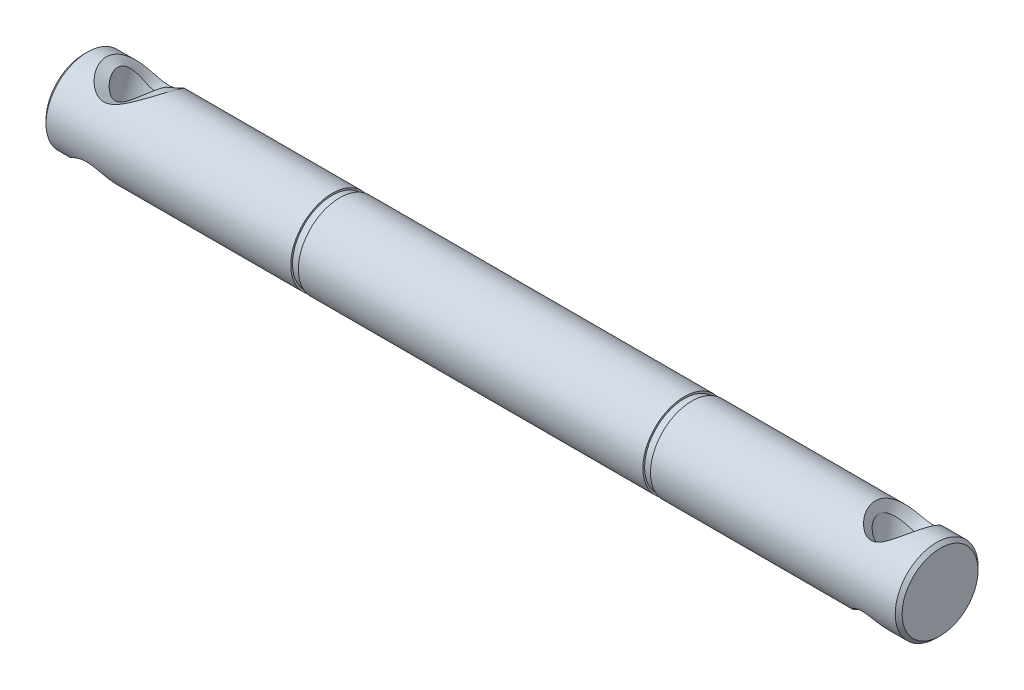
ISO-10303-21;
HEADER;
FILE_DESCRIPTION(('STEP AP214'),'2;1');
FILE_NAME('part.step','',(''),(''),'','','');
FILE_SCHEMA(('AUTOMOTIVE_DESIGN { 1 0 10303 214 1 1 1 1 }'));
ENDSEC;
DATA;
#1=APPLICATION_CONTEXT('core data for automotive mechanical design processes');
#2=APPLICATION_PROTOCOL_DEFINITION('international standard','automotive_design',2000,#1);
#3=PRODUCT_CONTEXT('',#1,'mechanical');
#4=PRODUCT('Part','Part','',(#3));
#5=PRODUCT_RELATED_PRODUCT_CATEGORY('part','',(#4));
#6=PRODUCT_DEFINITION_FORMATION('','',#4);
#7=PRODUCT_DEFINITION_CONTEXT('part definition',#1,'design');
#8=PRODUCT_DEFINITION('design','',#6,#7);
#9=PRODUCT_DEFINITION_SHAPE('','',#8);
#10=(LENGTH_UNIT() NAMED_UNIT(*) SI_UNIT(.MILLI.,.METRE.));
#11=(NAMED_UNIT(*) PLANE_ANGLE_UNIT() SI_UNIT($,.RADIAN.));
#12=(NAMED_UNIT(*) SI_UNIT($,.STERADIAN.) SOLID_ANGLE_UNIT());
#13=UNCERTAINTY_MEASURE_WITH_UNIT(LENGTH_MEASURE(1.E-05),#10,'distance_accuracy_value','');
#14=(GEOMETRIC_REPRESENTATION_CONTEXT(3) GLOBAL_UNCERTAINTY_ASSIGNED_CONTEXT((#13)) GLOBAL_UNIT_ASSIGNED_CONTEXT((#10,
#11,#12)) REPRESENTATION_CONTEXT('',''));
#15=CARTESIAN_POINT('',(0.,0.,0.));
#16=DIRECTION('',(0.,0.,1.));
#17=DIRECTION('',(1.,0.,0.));
#18=AXIS2_PLACEMENT_3D('',#15,#16,#17);
#19=CARTESIAN_POINT('',(-125.52889883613,0.,0.));
#20=DIRECTION('',(-1.,0.,0.));
#21=DIRECTION('',(0.,0.,1.));
#22=AXIS2_PLACEMENT_3D('',#19,#20,#21);
#23=CYLINDRICAL_SURFACE('',#22,6.);
#24=CARTESIAN_POINT('',(-24.9500000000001,0.,0.));
#25=DIRECTION('',(-1.,0.,0.));
#26=DIRECTION('',(0.,0.,1.));
#27=AXIS2_PLACEMENT_3D('',#24,#25,#26);
#28=CIRCLE('',#27,6.);
#29=CARTESIAN_POINT('',(-24.9500000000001,0.,6.));
#30=VERTEX_POINT('',#29);
#31=EDGE_CURVE('E231',#30,#30,#28,.T.);
#32=ORIENTED_EDGE('',*,*,#31,.F.);
#33=EDGE_LOOP('',(#32));
#34=FACE_BOUND('',#33,.T.);
#35=CARTESIAN_POINT('',(24.9499999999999,0.,0.));
#36=DIRECTION('',(-1.,0.,0.));
#37=DIRECTION('',(0.,0.,1.));
#38=AXIS2_PLACEMENT_3D('',#35,#36,#37);
#39=CIRCLE('',#38,6.00000000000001);
#40=CARTESIAN_POINT('',(24.9499999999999,0.,6.00000000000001));
#41=VERTEX_POINT('',#40);
#42=EDGE_CURVE('E217',#41,#41,#39,.T.);
#43=ORIENTED_EDGE('',*,*,#42,.T.);
#44=EDGE_LOOP('',(#43));
#45=FACE_BOUND('',#44,.T.);
#46=ADVANCED_FACE('F37',(#34,#45),#23,.T.);
#47=CARTESIAN_POINT('',(-61.5,0.,0.));
#48=DIRECTION('',(1.,0.,0.));
#49=DIRECTION('',(0.,0.,-1.));
#50=AXIS2_PLACEMENT_3D('',#47,#48,#49);
#51=CIRCLE('',#50,6.);
#52=CARTESIAN_POINT('',(-61.5,0.,-6.));
#53=VERTEX_POINT('',#52);
#54=EDGE_CURVE('E89',#53,#53,#51,.T.);
#55=ORIENTED_EDGE('',*,*,#54,.T.);
#56=EDGE_LOOP('',(#55));
#57=FACE_BOUND('',#56,.T.);
#58=CARTESIAN_POINT('',(-56.3120478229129,-4.5435172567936,-3.91873078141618));
#59=CARTESIAN_POINT('',(-55.6889932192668,-4.50260202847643,-3.96482475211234));
#60=CARTESIAN_POINT('',(-55.0696574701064,-4.64801055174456,-3.81040063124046));
#61=CARTESIAN_POINT('',(-54.0102790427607,-5.07572363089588,-3.22159720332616));
#62=CARTESIAN_POINT('',(-53.5595200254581,-5.32475675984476,-2.81621447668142));
#63=CARTESIAN_POINT('',(-52.7806526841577,-5.73788945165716,-1.83328644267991));
#64=CARTESIAN_POINT('',(-52.4624231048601,-5.90000758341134,-1.25808472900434));
#65=CARTESIAN_POINT('',(-52.0047087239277,-6.03384654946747,-0.000138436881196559));
#66=CARTESIAN_POINT('',(-51.8731098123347,-6.00113438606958,0.679329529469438));
#67=CARTESIAN_POINT('',(-51.8568051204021,-5.69403598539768,2.0082325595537));
#68=CARTESIAN_POINT('',(-51.9694836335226,-5.42801545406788,2.63428005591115));
#69=CARTESIAN_POINT('',(-52.4006881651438,-4.75210234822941,3.71908137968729));
#70=CARTESIAN_POINT('',(-52.7142983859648,-4.34892249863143,4.16715350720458));
#71=CARTESIAN_POINT('',(-53.4723414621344,-3.54953476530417,4.86691384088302));
#72=CARTESIAN_POINT('',(-53.9270989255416,-3.13950503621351,5.12715877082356));
#73=CARTESIAN_POINT('',(-54.970922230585,-2.49294054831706,5.46885730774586));
#74=CARTESIAN_POINT('',(-55.5879213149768,-2.27427870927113,5.55183518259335));
#75=CARTESIAN_POINT('',(-56.8399254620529,-2.32714879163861,5.53089304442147));
#76=CARTESIAN_POINT('',(-57.4344581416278,-2.56688322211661,5.43462916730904));
#77=CARTESIAN_POINT('',(-58.4904153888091,-3.18595283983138,5.0965092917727));
#78=CARTESIAN_POINT('',(-58.9692037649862,-3.56783966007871,4.84920016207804));
#79=CARTESIAN_POINT('',(-60.2118024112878,-4.68466829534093,3.87655390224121));
#80=CARTESIAN_POINT('',(-60.8250578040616,-5.48491258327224,2.79719474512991));
#81=CARTESIAN_POINT('',(-60.8411062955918,-6.15587499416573,0.11691997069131));
#82=CARTESIAN_POINT('',(-60.2462821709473,-5.96008853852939,-1.21749727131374));
#83=CARTESIAN_POINT('',(-59.0258480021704,-5.41798726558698,-2.62746309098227));
#84=CARTESIAN_POINT('',(-58.5553425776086,-5.18744497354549,-3.03748459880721));
#85=CARTESIAN_POINT('',(-57.5235194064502,-4.77506669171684,-3.65193699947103));
#86=CARTESIAN_POINT('',(-56.935102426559,-4.58443248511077,-3.87263681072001));
#87=CARTESIAN_POINT('',(-56.3120478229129,-4.5435172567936,-3.91873078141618));
#88=B_SPLINE_CURVE_WITH_KNOTS('',3,(#58,#59,#60,#61,#62,#63,#64,#65,#66,#67,#68,#69,#70,#71,#72,
#73,#74,#75,#76,#77,#78,#79,#80,#81,#82,#83,#84,#85,#86,#87),.UNSPECIFIED.,.T.,.F.,(4,2,2,2,2,2,
2,2,2,2,2,2,2,2,4),(-0.0286196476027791,-0.0267692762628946,-0.0249189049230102,
-0.0230685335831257,-0.0212181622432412,-0.0193677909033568,-0.0175174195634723,
-0.0156670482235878,-0.0138166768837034,-0.0119663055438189,-0.0101159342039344,
-0.00641519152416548,-0.00271444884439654,-0.000864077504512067,0.000986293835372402),.UNSPECIFIED.);
#89=CARTESIAN_POINT('',(-56.3120478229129,-4.5435172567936,-3.91873078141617));
#90=VERTEX_POINT('',#89);
#91=EDGE_CURVE('E49',#90,#90,#88,.F.);
#92=ORIENTED_EDGE('',*,*,#91,.T.);
#93=EDGE_LOOP('',(#92));
#94=FACE_BOUND('',#93,.T.);
#95=CARTESIAN_POINT('',(-55.1857168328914,2.10453518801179,-5.61880161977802));
#96=CARTESIAN_POINT('',(-55.8087714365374,2.04651511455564,-5.6395953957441));
#97=CARTESIAN_POINT('',(-56.4281071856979,2.24820519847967,-5.57393294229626));
#98=CARTESIAN_POINT('',(-57.4874856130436,2.90606990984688,-5.26273850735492));
#99=CARTESIAN_POINT('',(-57.9382446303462,3.3191376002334,-5.0266712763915));
#100=CARTESIAN_POINT('',(-58.7171119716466,4.15341371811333,-4.36273641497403));
#101=CARTESIAN_POINT('',(-59.0353415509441,4.57175890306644,-3.93597347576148));
#102=CARTESIAN_POINT('',(-59.4930559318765,5.29305215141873,-2.8967055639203));
#103=CARTESIAN_POINT('',(-59.6246548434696,5.59053846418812,-2.28494687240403));
#104=CARTESIAN_POINT('',(-59.6409595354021,5.95908796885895,-0.971758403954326));
#105=CARTESIAN_POINT('',(-59.5282810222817,6.0262625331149,-0.294861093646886));
#106=CARTESIAN_POINT('',(-59.0970764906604,5.95409133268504,0.981243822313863));
#107=CARTESIAN_POINT('',(-58.7834662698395,5.81550641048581,1.56785855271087));
#108=CARTESIAN_POINT('',(-58.0254231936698,5.45017736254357,2.56546566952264));
#109=CARTESIAN_POINT('',(-57.5706657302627,5.21541589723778,2.99059959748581));
#110=CARTESIAN_POINT('',(-56.5268424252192,4.8122594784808,3.60073763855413));
#111=CARTESIAN_POINT('',(-55.9098433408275,4.66027506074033,3.77849889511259));
#112=CARTESIAN_POINT('',(-54.6578391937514,4.69660129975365,3.73474705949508));
#113=CARTESIAN_POINT('',(-54.0633065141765,4.8606933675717,3.53521479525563));
#114=CARTESIAN_POINT('',(-53.0073492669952,5.24144820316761,2.94141516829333));
#115=CARTESIAN_POINT('',(-52.5285608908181,5.45773155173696,2.5411391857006));
#116=CARTESIAN_POINT('',(-51.2859622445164,5.97053125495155,1.15175680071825));
#117=CARTESIAN_POINT('',(-50.6727068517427,6.15438301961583,-0.179259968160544));
#118=CARTESIAN_POINT('',(-50.6566583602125,5.45629471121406,-2.85259798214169));
#119=CARTESIAN_POINT('',(-51.251482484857,4.64394844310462,-3.92921084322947));
#120=CARTESIAN_POINT('',(-52.4719166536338,3.49153416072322,-4.9058472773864));
#121=CARTESIAN_POINT('',(-52.9424220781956,3.09246045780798,-5.1548604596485));
#122=CARTESIAN_POINT('',(-53.9742452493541,2.43573506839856,-5.49591670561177));
#123=CARTESIAN_POINT('',(-54.5626622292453,2.16255526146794,-5.59800784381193));
#124=CARTESIAN_POINT('',(-55.1857168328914,2.10453518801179,-5.61880161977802));
#125=B_SPLINE_CURVE_WITH_KNOTS('',3,(#95,#96,#97,#98,#99,#100,#101,#102,#103,#104,#105,#106,
#107,#108,#109,#110,#111,#112,#113,#114,#115,#116,#117,#118,#119,#120,#121,#122,#123,#124),
.UNSPECIFIED.,.T.,.F.,(4,2,2,2,2,2,2,2,2,2,2,2,2,2,4),(-0.0286196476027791,-0.0267692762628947,
-0.0249189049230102,-0.0230685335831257,-0.0212181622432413,-0.0193677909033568,
-0.0175174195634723,-0.0156670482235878,-0.0138166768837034,-0.0119663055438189,
-0.0101159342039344,-0.00641519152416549,-0.00271444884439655,-0.000864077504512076,
0.000986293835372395),.UNSPECIFIED.);
#126=CARTESIAN_POINT('',(-55.1857168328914,2.10453518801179,-5.61880161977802));
#127=VERTEX_POINT('',#126);
#128=EDGE_CURVE('E11',#127,#127,#125,.F.);
#129=ORIENTED_EDGE('',*,*,#128,.T.);
#130=EDGE_LOOP('',(#129));
#131=FACE_BOUND('',#130,.T.);
#132=CARTESIAN_POINT('',(-26.0500000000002,0.,0.));
#133=DIRECTION('',(-1.,0.,0.));
#134=DIRECTION('',(0.,0.,1.));
#135=AXIS2_PLACEMENT_3D('',#132,#133,#134);
#136=CIRCLE('',#135,6.);
#137=CARTESIAN_POINT('',(-26.0500000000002,0.,6.));
#138=VERTEX_POINT('',#137);
#139=EDGE_CURVE('E228',#138,#138,#136,.T.);
#140=ORIENTED_EDGE('',*,*,#139,.T.);
#141=EDGE_LOOP('',(#140));
#142=FACE_BOUND('',#141,.T.);
#143=ADVANCED_FACE('F102',(#57,#94,#131,#142),#23,.T.);
#144=CARTESIAN_POINT('',(-62.,0.,0.));
#145=DIRECTION('',(1.,0.,0.));
#146=DIRECTION('',(0.,0.,-1.));
#147=AXIS2_PLACEMENT_3D('',#144,#145,#146);
#148=PLANE('',#147);
#149=CARTESIAN_POINT('',(-62.,0.,0.));
#150=DIRECTION('',(1.,0.,0.));
#151=DIRECTION('',(0.,0.,-1.));
#152=AXIS2_PLACEMENT_3D('',#149,#150,#151);
#153=CIRCLE('',#152,5.5);
#154=CARTESIAN_POINT('',(-62.,0.,-5.5));
#155=VERTEX_POINT('',#154);
#156=EDGE_CURVE('E240',#155,#155,#153,.F.);
#157=ORIENTED_EDGE('',*,*,#156,.T.);
#158=EDGE_LOOP('',(#157));
#159=FACE_BOUND('',#158,.T.);
#160=ADVANCED_FACE('F112',(#159),#148,.F.);
#161=CARTESIAN_POINT('',(-62.,0.,0.));
#162=DIRECTION('',(1.,0.,0.));
#163=DIRECTION('',(0.,0.,-1.));
#164=AXIS2_PLACEMENT_3D('',#161,#162,#163);
#165=CONICAL_SURFACE('',#164,5.5,0.785398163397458);
#166=ORIENTED_EDGE('',*,*,#54,.F.);
#167=EDGE_LOOP('',(#166));
#168=FACE_BOUND('',#167,.T.);
#169=ORIENTED_EDGE('',*,*,#156,.F.);
#170=EDGE_LOOP('',(#169));
#171=FACE_BOUND('',#170,.T.);
#172=ADVANCED_FACE('F245',(#168,#171),#165,.T.);
#173=CARTESIAN_POINT('',(-53.566295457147,19.366678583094,-5.01315585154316));
#174=DIRECTION('',(-0.108458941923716,-0.963108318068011,0.2462905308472));
#175=DIRECTION('',(0.,-0.247752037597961,-0.968823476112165));
#176=AXIS2_PLACEMENT_3D('',#173,#174,#175);
#177=CYLINDRICAL_SURFACE('',#176,2.99999999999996);
#178=CARTESIAN_POINT('',(-55.2568475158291,2.29710480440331,-3.74085283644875));
#179=CARTESIAN_POINT('',(-55.2265197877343,2.30224150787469,-3.7405929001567));
#180=CARTESIAN_POINT('',(-55.1963620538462,2.30831965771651,-3.74014477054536));
#181=CARTESIAN_POINT('',(-55.1362429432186,2.32225316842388,-3.73887478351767));
#182=CARTESIAN_POINT('',(-55.1062844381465,2.33012072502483,-3.73805032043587));
#183=CARTESIAN_POINT('',(-55.0465895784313,2.34752636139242,-3.7360253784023));
#184=CARTESIAN_POINT('',(-55.0168574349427,2.35707840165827,-3.73482168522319));
#185=CARTESIAN_POINT('',(-54.9576345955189,2.37774696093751,-3.7320363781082));
#186=CARTESIAN_POINT('',(-54.9281491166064,2.38887788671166,-3.73045117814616));
#187=CARTESIAN_POINT('',(-54.8694410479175,2.41259963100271,-3.72690055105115));
#188=CARTESIAN_POINT('',(-54.8402243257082,2.42520435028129,-3.72493136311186));
#189=CARTESIAN_POINT('',(-54.7820751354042,2.4517698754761,-3.72061031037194));
#190=CARTESIAN_POINT('',(-54.753148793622,2.46574343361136,-3.71825467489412));
#191=CARTESIAN_POINT('',(-54.6956022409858,2.49494340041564,-3.71315810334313));
#192=CARTESIAN_POINT('',(-54.6669880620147,2.51018102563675,-3.71041352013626));
#193=CARTESIAN_POINT('',(-54.6100881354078,2.5418061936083,-3.70453632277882));
#194=CARTESIAN_POINT('',(-54.5818080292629,2.55820322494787,-3.70140029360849));
#195=CARTESIAN_POINT('',(-54.5255984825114,2.59204442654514,-3.69473730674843));
#196=CARTESIAN_POINT('',(-54.4976740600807,2.60949630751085,-3.69120725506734));
#197=CARTESIAN_POINT('',(-54.4421997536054,2.64534437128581,-3.68375347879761));
#198=CARTESIAN_POINT('',(-54.4146541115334,2.6637465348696,-3.67982705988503));
#199=CARTESIAN_POINT('',(-54.3324090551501,2.72035175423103,-3.66742184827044));
#200=CARTESIAN_POINT('',(-54.278561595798,2.75967308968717,-3.65837163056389));
#201=CARTESIAN_POINT('',(-54.1726388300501,2.84083813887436,-3.63867634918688));
#202=CARTESIAN_POINT('',(-54.1205750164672,2.8826946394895,-3.62802271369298));
#203=CARTESIAN_POINT('',(-54.0179787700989,2.96843491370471,-3.60496946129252));
#204=CARTESIAN_POINT('',(-53.9674579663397,3.01232973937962,-3.59255933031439));
#205=CARTESIAN_POINT('',(-53.8676725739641,3.10193507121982,-3.56587997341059));
#206=CARTESIAN_POINT('',(-53.8184242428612,3.14765875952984,-3.55159437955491));
#207=CARTESIAN_POINT('',(-53.7212812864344,3.2404879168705,-3.5211366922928));
#208=CARTESIAN_POINT('',(-53.6733960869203,3.28759982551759,-3.50495421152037));
#209=CARTESIAN_POINT('',(-53.5790730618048,3.38276090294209,-3.47066416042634));
#210=CARTESIAN_POINT('',(-53.5326382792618,3.43081173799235,-3.45255285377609));
#211=CARTESIAN_POINT('',(-53.4413050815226,3.52740438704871,-3.41437318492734));
#212=CARTESIAN_POINT('',(-53.3964039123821,3.57594509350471,-3.39430861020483));
#213=CARTESIAN_POINT('',(-53.3082469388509,3.67307691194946,-3.35217017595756));
#214=CARTESIAN_POINT('',(-53.2649830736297,3.72166608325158,-3.33010870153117));
#215=CARTESIAN_POINT('',(-53.1801317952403,3.8184216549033,-3.28399214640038));
#216=CARTESIAN_POINT('',(-53.138532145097,3.86658755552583,-3.2599586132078));
#217=CARTESIAN_POINT('',(-53.0570114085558,3.96250408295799,-3.20946426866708));
#218=CARTESIAN_POINT('',(-53.0170817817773,4.01025547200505,-3.18301880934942));
#219=CARTESIAN_POINT('',(-52.9390004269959,4.10546323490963,-3.12739044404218));
#220=CARTESIAN_POINT('',(-52.9008458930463,4.15291996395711,-3.09821209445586));
#221=CARTESIAN_POINT('',(-52.8264585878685,4.24718386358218,-3.03720865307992));
#222=CARTESIAN_POINT('',(-52.790217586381,4.2939930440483,-3.00539672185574));
#223=CARTESIAN_POINT('',(-52.7198798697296,4.38663341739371,-2.93915144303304));
#224=CARTESIAN_POINT('',(-52.6857689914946,4.43246933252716,-2.9047397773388));
#225=CARTESIAN_POINT('',(-52.6198898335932,4.52283136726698,-2.83333398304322));
#226=CARTESIAN_POINT('',(-52.5881013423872,4.56736604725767,-2.79636950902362));
#227=CARTESIAN_POINT('',(-52.5421930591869,4.6331321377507,-2.73884057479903));
#228=CARTESIAN_POINT('',(-52.5272493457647,4.65478638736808,-2.7194092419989));
#229=CARTESIAN_POINT('',(-52.4980228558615,4.69764187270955,-2.6799206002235));
#230=CARTESIAN_POINT('',(-52.4837363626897,4.71884515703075,-2.65986827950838));
#231=CARTESIAN_POINT('',(-52.4558501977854,4.76075619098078,-2.61914397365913));
#232=CARTESIAN_POINT('',(-52.4422464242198,4.78146636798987,-2.59847729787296));
#233=CARTESIAN_POINT('',(-52.4157509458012,4.82234952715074,-2.55652970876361));
#234=CARTESIAN_POINT('',(-52.4028547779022,4.84252532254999,-2.53525436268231));
#235=CARTESIAN_POINT('',(-52.3777999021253,4.88229781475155,-2.4920951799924));
#236=CARTESIAN_POINT('',(-52.3656364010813,4.90189771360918,-2.47021708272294));
#237=CARTESIAN_POINT('',(-52.3420721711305,4.94047657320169,-2.42585816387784));
#238=CARTESIAN_POINT('',(-52.3306663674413,4.95945910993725,-2.40338315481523));
#239=CARTESIAN_POINT('',(-52.3086428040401,4.996761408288,-2.35783629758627));
#240=CARTESIAN_POINT('',(-52.298019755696,5.01508508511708,-2.3347702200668));
#241=CARTESIAN_POINT('',(-52.2775868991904,5.05102787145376,-2.28804722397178));
#242=CARTESIAN_POINT('',(-52.2677716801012,5.06865117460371,-2.26439590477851));
#243=CARTESIAN_POINT('',(-52.2489795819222,5.10315148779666,-2.2165085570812));
#244=CARTESIAN_POINT('',(-52.239997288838,5.12003287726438,-2.19227781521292));
#245=CARTESIAN_POINT('',(-52.2228960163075,5.15300773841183,-2.14323789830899));
#246=CARTESIAN_POINT('',(-52.2147717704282,5.16910564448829,-2.11843354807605));
#247=CARTESIAN_POINT('',(-52.1994114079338,5.20047205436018,-2.06825284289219));
#248=CARTESIAN_POINT('',(-52.1921703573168,5.21574487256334,-2.04288070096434));
#249=CARTESIAN_POINT('',(-52.178601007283,5.24541980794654,-1.99157099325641));
#250=CARTESIAN_POINT('',(-52.1722683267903,5.25982589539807,-1.96563688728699));
#251=CARTESIAN_POINT('',(-52.1605401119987,5.28772630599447,-1.91320997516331));
#252=CARTESIAN_POINT('',(-52.1551410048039,5.30122397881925,-1.88671975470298));
#253=CARTESIAN_POINT('',(-52.1453040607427,5.32726678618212,-1.83318745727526));
#254=CARTESIAN_POINT('',(-52.1408637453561,5.33981432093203,-1.80614700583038));
#255=CARTESIAN_POINT('',(-52.1329682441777,5.36391641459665,-1.75152117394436));
#256=CARTESIAN_POINT('',(-52.1295119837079,5.37547204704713,-1.72393642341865));
#257=CARTESIAN_POINT('',(-52.1236080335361,5.39755029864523,-1.66822894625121));
#258=CARTESIAN_POINT('',(-52.1211609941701,5.40807224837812,-1.64010588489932));
#259=CARTESIAN_POINT('',(-52.1172989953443,5.42804346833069,-1.58332871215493));
#260=CARTESIAN_POINT('',(-52.1158867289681,5.43748988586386,-1.55467341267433));
#261=CARTESIAN_POINT('',(-52.1141160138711,5.45527100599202,-1.4968385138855));
#262=CARTESIAN_POINT('',(-52.1137625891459,5.46360023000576,-1.46765707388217));
#263=CARTESIAN_POINT('',(-52.1141351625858,5.47905251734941,-1.40898595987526));
#264=CARTESIAN_POINT('',(-52.1148610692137,5.48617568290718,-1.37949631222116));
#265=CARTESIAN_POINT('',(-52.1173826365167,5.49918015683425,-1.32044135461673));
#266=CARTESIAN_POINT('',(-52.119173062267,5.50506735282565,-1.29087711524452));
#267=CARTESIAN_POINT('',(-52.1237944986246,5.51563725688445,-1.2316997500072));
#268=CARTESIAN_POINT('',(-52.1266226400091,5.52032322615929,-1.20208698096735));
#269=CARTESIAN_POINT('',(-52.1332921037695,5.52852757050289,-1.1428389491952));
#270=CARTESIAN_POINT('',(-52.1371326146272,5.53204687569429,-1.1132037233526));
#271=CARTESIAN_POINT('',(-52.1457993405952,5.5379545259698,-1.05393676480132));
#272=CARTESIAN_POINT('',(-52.1506264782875,5.54034180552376,-1.02430506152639));
#273=CARTESIAN_POINT('',(-52.1612394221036,5.54402167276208,-0.965070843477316));
#274=CARTESIAN_POINT('',(-52.1670275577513,5.54531155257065,-0.935468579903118));
#275=CARTESIAN_POINT('',(-52.1795357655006,5.54683253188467,-0.876318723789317));
#276=CARTESIAN_POINT('',(-52.1862592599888,5.54705963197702,-0.846771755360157));
#277=CARTESIAN_POINT('',(-52.200611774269,5.54649061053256,-0.787757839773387));
#278=CARTESIAN_POINT('',(-52.2082450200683,5.5456895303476,-0.758291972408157));
#279=CARTESIAN_POINT('',(-52.2243909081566,5.54309937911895,-0.699465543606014));
#280=CARTESIAN_POINT('',(-52.2329083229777,5.54130469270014,-0.670106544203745));
#281=CARTESIAN_POINT('',(-52.2507966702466,5.53676226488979,-0.61151912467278));
#282=CARTESIAN_POINT('',(-52.2601727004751,5.53400851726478,-0.582292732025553));
#283=CARTESIAN_POINT('',(-52.2797526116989,5.52758264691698,-0.523995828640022));
#284=CARTESIAN_POINT('',(-52.2899617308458,5.52390435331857,-0.494927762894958));
#285=CARTESIAN_POINT('',(-52.3111823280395,5.51566385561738,-0.436972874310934));
#286=CARTESIAN_POINT('',(-52.3221990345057,5.5110955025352,-0.408088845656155));
#287=CARTESIAN_POINT('',(-52.3450094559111,5.50110917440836,-0.350527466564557));
#288=CARTESIAN_POINT('',(-52.3568082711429,5.49568522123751,-0.321853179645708));
#289=CARTESIAN_POINT('',(-52.3811576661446,5.48402184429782,-0.264736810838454));
#290=CARTESIAN_POINT('',(-52.3937131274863,5.47777672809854,-0.236297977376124));
#291=CARTESIAN_POINT('',(-52.419550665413,5.46450506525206,-0.179678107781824));
#292=CARTESIAN_POINT('',(-52.4328373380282,5.45747319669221,-0.151500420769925));
#293=CARTESIAN_POINT('',(-52.4601121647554,5.44266201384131,-0.0954286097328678));
#294=CARTESIAN_POINT('',(-52.4741045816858,5.43487780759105,-0.0675378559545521));
#295=CARTESIAN_POINT('',(-52.5027659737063,5.41859580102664,-0.0120654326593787));
#296=CARTESIAN_POINT('',(-52.5174388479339,5.41009357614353,0.0155129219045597));
#297=CARTESIAN_POINT('',(-52.5474356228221,5.39240965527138,0.0703337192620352));
#298=CARTESIAN_POINT('',(-52.562763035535,5.383224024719,0.0975729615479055));
#299=CARTESIAN_POINT('',(-52.6098118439,5.35462155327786,0.178969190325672));
#300=CARTESIAN_POINT('',(-52.642357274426,5.33429769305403,0.232336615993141));
#301=CARTESIAN_POINT('',(-52.7097364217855,5.2913540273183,0.337425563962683));
#302=CARTESIAN_POINT('',(-52.7445886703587,5.26871455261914,0.389127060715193));
#303=CARTESIAN_POINT('',(-52.8163915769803,5.22140366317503,0.490674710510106));
#304=CARTESIAN_POINT('',(-52.8533546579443,5.19671972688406,0.540506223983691));
#305=CARTESIAN_POINT('',(-52.9291674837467,5.14559263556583,0.638116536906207));
#306=CARTESIAN_POINT('',(-52.9680236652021,5.11914334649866,0.68588711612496));
#307=CARTESIAN_POINT('',(-53.0474786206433,5.0647375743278,0.779105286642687));
#308=CARTESIAN_POINT('',(-53.0880782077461,5.03678038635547,0.824551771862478));
#309=CARTESIAN_POINT('',(-53.1709390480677,4.97947302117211,0.913461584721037));
#310=CARTESIAN_POINT('',(-53.2132071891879,4.95011693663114,0.956914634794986));
#311=CARTESIAN_POINT('',(-53.2994332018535,4.89025672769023,1.04223426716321));
#312=CARTESIAN_POINT('',(-53.3434025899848,4.85974482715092,1.08408372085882));
#313=CARTESIAN_POINT('',(-53.4330119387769,4.79794235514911,1.16594999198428));
#314=CARTESIAN_POINT('',(-53.4786593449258,4.76664857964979,1.20595624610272));
#315=CARTESIAN_POINT('',(-53.5715407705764,4.70367454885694,1.28396538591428));
#316=CARTESIAN_POINT('',(-53.6187772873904,4.67199374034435,1.32196485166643));
#317=CARTESIAN_POINT('',(-53.7147692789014,4.60863179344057,1.39576950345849));
#318=CARTESIAN_POINT('',(-53.763521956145,4.57695075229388,1.43157840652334));
#319=CARTESIAN_POINT('',(-53.8624820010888,4.51398761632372,1.50081461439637));
#320=CARTESIAN_POINT('',(-53.9126809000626,4.48270431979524,1.53425290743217));
#321=CARTESIAN_POINT('',(-54.0144423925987,4.42090135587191,1.5985656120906));
#322=CARTESIAN_POINT('',(-54.0659908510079,4.39037758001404,1.62945840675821));
#323=CARTESIAN_POINT('',(-54.1706116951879,4.33050983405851,1.68855565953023));
#324=CARTESIAN_POINT('',(-54.2236687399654,4.30115842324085,1.71677950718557));
#325=CARTESIAN_POINT('',(-54.3046999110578,4.25840987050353,1.75700972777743));
#326=CARTESIAN_POINT('',(-54.3318599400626,4.24441721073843,1.77002963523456));
#327=CARTESIAN_POINT('',(-54.386564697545,4.21696806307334,1.79529204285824));
#328=CARTESIAN_POINT('',(-54.414106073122,4.20350882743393,1.80753879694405));
#329=CARTESIAN_POINT('',(-54.4695548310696,4.17721337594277,1.83120957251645));
#330=CARTESIAN_POINT('',(-54.4974581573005,4.16437337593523,1.84263887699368));
#331=CARTESIAN_POINT('',(-54.5536109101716,4.13939973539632,1.86463035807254));
#332=CARTESIAN_POINT('',(-54.5818556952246,4.12726121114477,1.87519881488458));
#333=CARTESIAN_POINT('',(-54.6386716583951,4.10377490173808,1.89542398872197));
#334=CARTESIAN_POINT('',(-54.6672377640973,4.09242108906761,1.90508792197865));
#335=CARTESIAN_POINT('',(-54.7246764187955,4.07058835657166,1.92345956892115));
#336=CARTESIAN_POINT('',(-54.7535436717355,4.06010230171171,1.93217531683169));
#337=CARTESIAN_POINT('',(-54.8115645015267,4.04008924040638,1.94860623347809));
#338=CARTESIAN_POINT('',(-54.8407128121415,4.03055412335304,1.95633006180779));
#339=CARTESIAN_POINT('',(-54.8992753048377,4.01252697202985,1.97073295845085));
#340=CARTESIAN_POINT('',(-54.9286845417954,4.00402611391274,1.97742102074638));
#341=CARTESIAN_POINT('',(-54.9877483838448,3.98815102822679,1.98970864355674));
#342=CARTESIAN_POINT('',(-55.017398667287,3.98076769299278,1.9953171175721));
#343=CARTESIAN_POINT('',(-55.0769228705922,3.96721144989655,2.0054017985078));
#344=CARTESIAN_POINT('',(-55.1067933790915,3.96102977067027,2.00988628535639));
#345=CARTESIAN_POINT('',(-55.1667393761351,3.94995729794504,2.01768154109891));
#346=CARTESIAN_POINT('',(-55.1968125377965,3.94505893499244,2.02099923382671));
#347=CARTESIAN_POINT('',(-55.2420940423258,3.93874080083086,2.02506391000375));
#348=CARTESIAN_POINT('',(-55.2571925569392,3.93680856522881,2.02626564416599));
#349=CARTESIAN_POINT('',(-55.2874309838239,3.93328952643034,2.02836542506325));
#350=CARTESIAN_POINT('',(-55.3025708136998,3.93170226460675,2.02926387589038));
#351=CARTESIAN_POINT('',(-55.3328542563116,3.92892200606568,2.03072651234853));
#352=CARTESIAN_POINT('',(-55.3479977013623,3.92772776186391,2.03129176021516));
#353=CARTESIAN_POINT('',(-55.3782473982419,3.92576438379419,2.03206581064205));
#354=CARTESIAN_POINT('',(-55.3933534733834,3.92499321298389,2.03227633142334));
#355=CARTESIAN_POINT('',(-55.423522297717,3.92385606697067,2.0323524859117));
#356=CARTESIAN_POINT('',(-55.4385849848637,3.9234885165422,2.03221946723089));
#357=CARTESIAN_POINT('',(-55.4686623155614,3.9231506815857,2.03161210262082));
#358=CARTESIAN_POINT('',(-55.4836769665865,3.92317919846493,2.03113879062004));
#359=CARTESIAN_POINT('',(-55.5136531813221,3.92362242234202,2.02985649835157));
#360=CARTESIAN_POINT('',(-55.528614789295,3.92403628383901,2.0290482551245));
#361=CARTESIAN_POINT('',(-55.5584800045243,3.92524000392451,2.02710116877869));
#362=CARTESIAN_POINT('',(-55.5733836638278,3.92602933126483,2.02596279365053));
#363=CARTESIAN_POINT('',(-55.6031280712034,3.92797360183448,2.02336063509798));
#364=CARTESIAN_POINT('',(-55.6179688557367,3.92912829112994,2.02189707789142));
#365=CARTESIAN_POINT('',(-55.6475826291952,3.93179300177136,2.01864967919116));
#366=CARTESIAN_POINT('',(-55.6623556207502,3.93330300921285,2.01686585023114));
#367=CARTESIAN_POINT('',(-55.6918289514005,3.9366680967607,2.01298301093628));
#368=CARTESIAN_POINT('',(-55.7065292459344,3.93852336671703,2.01088382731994));
#369=CARTESIAN_POINT('',(-55.7358522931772,3.94256874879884,2.0063753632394));
#370=CARTESIAN_POINT('',(-55.75047494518,3.94475921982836,2.00396575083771));
#371=CARTESIAN_POINT('',(-55.7796379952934,3.94946485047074,1.99884144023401));
#372=CARTESIAN_POINT('',(-55.7941782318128,3.95198050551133,1.99612627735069));
#373=CARTESIAN_POINT('',(-55.8231711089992,3.95732621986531,1.99039602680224));
#374=CARTESIAN_POINT('',(-55.8376235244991,3.96015688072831,1.98738036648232));
#375=CARTESIAN_POINT('',(-55.88089556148,3.96911648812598,1.97787909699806));
#376=CARTESIAN_POINT('',(-55.9095282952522,3.97569650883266,1.97095713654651));
#377=CARTESIAN_POINT('',(-55.9663846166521,3.98998985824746,1.95597626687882));
#378=CARTESIAN_POINT('',(-55.9946050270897,3.99770930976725,1.94791122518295));
#379=CARTESIAN_POINT('',(-56.0506010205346,4.01420124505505,1.93068359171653));
#380=CARTESIAN_POINT('',(-56.0783727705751,4.02297994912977,1.92151451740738));
#381=CARTESIAN_POINT('',(-56.1334321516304,4.04151030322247,1.9021182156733));
#382=CARTESIAN_POINT('',(-56.1607155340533,4.05126783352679,1.89188457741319));
#383=CARTESIAN_POINT('',(-56.2147600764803,4.07167553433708,1.87039835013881));
#384=CARTESIAN_POINT('',(-56.2415168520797,4.08233095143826,1.85913973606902));
#385=CARTESIAN_POINT('',(-56.2944672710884,4.10445718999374,1.83564117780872));
#386=CARTESIAN_POINT('',(-56.3206566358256,4.11593247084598,1.82339581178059));
#387=CARTESIAN_POINT('',(-56.3724397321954,4.13961056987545,1.79796620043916));
#388=CARTESIAN_POINT('',(-56.3980295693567,4.15181692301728,1.78477732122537));
#389=CARTESIAN_POINT('',(-56.4485484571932,4.17690990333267,1.75748401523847));
#390=CARTESIAN_POINT('',(-56.4734740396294,4.18979932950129,1.74337575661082));
#391=CARTESIAN_POINT('',(-56.5227478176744,4.2160731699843,1.71432234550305));
#392=CARTESIAN_POINT('',(-56.547092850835,4.22945957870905,1.69937366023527));
#393=CARTESIAN_POINT('',(-56.5953190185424,4.25656131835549,1.66870993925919));
#394=CARTESIAN_POINT('',(-56.6191971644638,4.27027797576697,1.65299139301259));
#395=CARTESIAN_POINT('',(-56.6902537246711,4.31197032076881,1.6045979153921));
#396=CARTESIAN_POINT('',(-56.7365185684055,4.3403073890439,1.57088420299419));
#397=CARTESIAN_POINT('',(-56.8270963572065,4.39769445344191,1.50066985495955));
#398=CARTESIAN_POINT('',(-56.8713921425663,4.4267481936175,1.4641502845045));
#399=CARTESIAN_POINT('',(-56.9580104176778,4.48512061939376,1.38851729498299));
#400=CARTESIAN_POINT('',(-57.0003220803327,4.51443990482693,1.34939195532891));
#401=CARTESIAN_POINT('',(-57.0829513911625,4.57288067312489,1.26874743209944));
#402=CARTESIAN_POINT('',(-57.1232648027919,4.60200163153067,1.22722353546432));
#403=CARTESIAN_POINT('',(-57.201874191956,4.6595888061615,1.14198094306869));
#404=CARTESIAN_POINT('',(-57.2401723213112,4.68805570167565,1.09826468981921));
#405=CARTESIAN_POINT('',(-57.3147363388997,4.74385607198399,1.0088322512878));
#406=CARTESIAN_POINT('',(-57.3510102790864,4.77119390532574,0.963125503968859));
#407=CARTESIAN_POINT('',(-57.421638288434,4.82444261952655,0.869715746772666));
#408=CARTESIAN_POINT('',(-57.4559978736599,4.85035759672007,0.82201924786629));
#409=CARTESIAN_POINT('',(-57.5228187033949,4.90062374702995,0.724613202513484));
#410=CARTESIAN_POINT('',(-57.5552821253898,4.92497671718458,0.67490608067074));
#411=CARTESIAN_POINT('',(-57.6181961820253,4.97178686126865,0.573628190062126));
#412=CARTESIAN_POINT('',(-57.6486530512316,4.99424997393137,0.522064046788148));
#413=CARTESIAN_POINT('',(-57.7074348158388,5.03696848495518,0.417220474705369));
#414=CARTESIAN_POINT('',(-57.7357696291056,5.05723438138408,0.363950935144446));
#415=CARTESIAN_POINT('',(-57.7766442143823,5.08578017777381,0.282754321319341));
#416=CARTESIAN_POINT('',(-57.7899694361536,5.09496786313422,0.255536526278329));
#417=CARTESIAN_POINT('',(-57.8160430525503,5.1126730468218,0.20073236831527));
#418=CARTESIAN_POINT('',(-57.8287932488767,5.12119271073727,0.173147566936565));
#419=CARTESIAN_POINT('',(-57.8537016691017,5.13752210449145,0.117629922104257));
#420=CARTESIAN_POINT('',(-57.8658618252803,5.14533423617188,0.089698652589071));
#421=CARTESIAN_POINT('',(-57.8895756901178,5.16020924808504,0.0335074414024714));
#422=CARTESIAN_POINT('',(-57.9011314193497,5.1672747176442,0.00524903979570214));
#423=CARTESIAN_POINT('',(-57.9236216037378,5.18061703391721,-0.0515767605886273));
#424=CARTESIAN_POINT('',(-57.9345581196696,5.18689659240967,-0.0801427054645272));
#425=CARTESIAN_POINT('',(-57.9557960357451,5.19862781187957,-0.137563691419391));
#426=CARTESIAN_POINT('',(-57.9660994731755,5.20408222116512,-0.166417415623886));
#427=CARTESIAN_POINT('',(-57.9860397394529,5.21411671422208,-0.2243531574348));
#428=CARTESIAN_POINT('',(-57.9956794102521,5.21870069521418,-0.253433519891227));
#429=CARTESIAN_POINT('',(-58.0142653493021,5.22697316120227,-0.311754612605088));
#430=CARTESIAN_POINT('',(-58.0232152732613,5.23066662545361,-0.34099347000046));
#431=CARTESIAN_POINT('',(-58.0404143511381,5.23714656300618,-0.399603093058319));
#432=CARTESIAN_POINT('',(-58.0486670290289,5.23993782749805,-0.428972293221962));
#433=CARTESIAN_POINT('',(-58.0644633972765,5.244601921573,-0.487814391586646));
#434=CARTESIAN_POINT('',(-58.0720104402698,5.24647929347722,-0.517286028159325));
#435=CARTESIAN_POINT('',(-58.0863876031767,5.24930422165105,-0.576304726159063));
#436=CARTESIAN_POINT('',(-58.0932208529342,5.25025600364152,-0.605850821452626));
#437=CARTESIAN_POINT('',(-58.1061624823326,5.25121844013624,-0.664990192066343));
#438=CARTESIAN_POINT('',(-58.1122737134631,5.25123292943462,-0.694582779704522));
#439=CARTESIAN_POINT('',(-58.1237634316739,5.25030954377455,-0.753786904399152));
#440=CARTESIAN_POINT('',(-58.129144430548,5.24937503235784,-0.783398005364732));
#441=CARTESIAN_POINT('',(-58.1391658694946,5.24654249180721,-0.842610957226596));
#442=CARTESIAN_POINT('',(-58.1438084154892,5.24464726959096,-0.872212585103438));
#443=CARTESIAN_POINT('',(-58.1523451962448,5.23988223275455,-0.931378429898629));
#444=CARTESIAN_POINT('',(-58.1562410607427,5.23701457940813,-0.960942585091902));
#445=CARTESIAN_POINT('',(-58.1632768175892,5.23029372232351,-1.0200053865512));
#446=CARTESIAN_POINT('',(-58.1664177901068,5.22644194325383,-1.04950406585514));
#447=CARTESIAN_POINT('',(-58.1719360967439,5.21774186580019,-1.10840785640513));
#448=CARTESIAN_POINT('',(-58.1743138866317,5.21289416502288,-1.13781301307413));
#449=CARTESIAN_POINT('',(-58.1782985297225,5.20219174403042,-1.19650189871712));
#450=CARTESIAN_POINT('',(-58.1799051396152,5.19633670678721,-1.22578558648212));
#451=CARTESIAN_POINT('',(-58.1823391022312,5.18360778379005,-1.28420335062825));
#452=CARTESIAN_POINT('',(-58.1831654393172,5.1767325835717,-1.31333718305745));
#453=CARTESIAN_POINT('',(-58.1840347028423,5.16195687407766,-1.37142876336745));
#454=CARTESIAN_POINT('',(-58.1840757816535,5.15405399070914,-1.40038593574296));
#455=CARTESIAN_POINT('',(-58.1833560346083,5.13721851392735,-1.45801728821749));
#456=CARTESIAN_POINT('',(-58.1825945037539,5.12828502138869,-1.48669119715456));
#457=CARTESIAN_POINT('',(-58.1802671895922,5.10941996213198,-1.54365587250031));
#458=CARTESIAN_POINT('',(-58.1787019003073,5.09948901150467,-1.5719468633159));
#459=CARTESIAN_POINT('',(-58.1747832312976,5.07866382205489,-1.62812800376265));
#460=CARTESIAN_POINT('',(-58.1724295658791,5.06776923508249,-1.65601800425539));
#461=CARTESIAN_POINT('',(-58.1669460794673,5.04504610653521,-1.71137775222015));
#462=CARTESIAN_POINT('',(-58.1638153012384,5.03321642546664,-1.73884693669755));
#463=CARTESIAN_POINT('',(-58.1567905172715,5.0086536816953,-1.79334614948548));
#464=CARTESIAN_POINT('',(-58.1528949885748,4.99591884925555,-1.82037518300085));
#465=CARTESIAN_POINT('',(-58.1443532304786,4.96957583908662,-1.87397507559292));
#466=CARTESIAN_POINT('',(-58.1397050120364,4.95596540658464,-1.90054450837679));
#467=CARTESIAN_POINT('',(-58.1296703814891,4.92790119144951,-1.95320621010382));
#468=CARTESIAN_POINT('',(-58.1242816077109,4.91344479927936,-1.97929663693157));
#469=CARTESIAN_POINT('',(-58.1127782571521,4.88371850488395,-2.03098130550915));
#470=CARTESIAN_POINT('',(-58.1066610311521,4.86844575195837,-2.05657331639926));
#471=CARTESIAN_POINT('',(-58.0937130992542,4.8371164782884,-2.10724211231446));
#472=CARTESIAN_POINT('',(-58.0868795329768,4.82105696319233,-2.13231631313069));
#473=CARTESIAN_POINT('',(-58.072511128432,4.78818379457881,-2.18193037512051));
#474=CARTESIAN_POINT('',(-58.0649732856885,4.77136708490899,-2.20646733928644));
#475=CARTESIAN_POINT('',(-58.0492086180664,4.73700914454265,-2.25498789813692));
#476=CARTESIAN_POINT('',(-58.0409787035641,4.71946486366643,-2.27896832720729));
#477=CARTESIAN_POINT('',(-58.0238415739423,4.68368108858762,-2.32635626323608));
#478=CARTESIAN_POINT('',(-58.0149312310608,4.66543860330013,-2.34976037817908));
#479=CARTESIAN_POINT('',(-57.9964469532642,4.62828860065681,-2.39597788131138));
#480=CARTESIAN_POINT('',(-57.9868699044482,4.60937819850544,-2.41878770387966));
#481=CARTESIAN_POINT('',(-57.9670580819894,4.57091902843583,-2.46379202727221));
#482=CARTESIAN_POINT('',(-57.9568202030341,4.55136749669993,-2.48598279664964));
#483=CARTESIAN_POINT('',(-57.9357295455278,4.51168017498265,-2.52973386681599));
#484=CARTESIAN_POINT('',(-57.9248742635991,4.49154219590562,-2.55129097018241));
#485=CARTESIAN_POINT('',(-57.902587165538,4.45074519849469,-2.59377822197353));
#486=CARTESIAN_POINT('',(-57.8911533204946,4.43008449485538,-2.6147056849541));
#487=CARTESIAN_POINT('',(-57.8677104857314,4.38827695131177,-2.65593056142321));
#488=CARTESIAN_POINT('',(-57.8556994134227,4.36712852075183,-2.67622517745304));
#489=CARTESIAN_POINT('',(-57.8311118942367,4.32438471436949,-2.71618728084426));
#490=CARTESIAN_POINT('',(-57.8185333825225,4.30278789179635,-2.73585194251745));
#491=CARTESIAN_POINT('',(-57.7798844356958,4.23725456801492,-2.79402223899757));
#492=CARTESIAN_POINT('',(-57.7530387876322,4.19282214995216,-2.83146178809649));
#493=CARTESIAN_POINT('',(-57.6971857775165,4.1026289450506,-2.9038647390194));
#494=CARTESIAN_POINT('',(-57.6681635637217,4.05686063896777,-2.9388072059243));
#495=CARTESIAN_POINT('',(-57.6080125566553,3.96429218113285,-3.00623368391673));
#496=CARTESIAN_POINT('',(-57.5768707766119,3.91748712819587,-3.03869935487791));
#497=CARTESIAN_POINT('',(-57.5125465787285,3.82314279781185,-3.10118817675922));
#498=CARTESIAN_POINT('',(-57.4793535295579,3.77560085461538,-3.13119633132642));
#499=CARTESIAN_POINT('',(-57.4109600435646,3.6800953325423,-3.18877276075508));
#500=CARTESIAN_POINT('',(-57.3757514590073,3.63213081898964,-3.21632978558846));
#501=CARTESIAN_POINT('',(-57.303538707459,3.53611433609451,-3.26901356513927));
#502=CARTESIAN_POINT('',(-57.2665324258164,3.48806233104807,-3.29413734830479));
#503=CARTESIAN_POINT('',(-57.1907846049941,3.39233094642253,-3.34203106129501));
#504=CARTESIAN_POINT('',(-57.1520466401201,3.34465101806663,-3.36480554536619));
#505=CARTESIAN_POINT('',(-57.0727219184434,3.25010475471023,-3.40807787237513));
#506=CARTESIAN_POINT('',(-57.0321418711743,3.20323621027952,-3.42858316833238));
#507=CARTESIAN_POINT('',(-56.949050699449,3.11073691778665,-3.46740909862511));
#508=CARTESIAN_POINT('',(-56.9065493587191,3.06510145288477,-3.48573938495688));
#509=CARTESIAN_POINT('',(-56.8195239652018,2.97550242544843,-3.5203037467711));
#510=CARTESIAN_POINT('',(-56.7750123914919,2.93153101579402,-3.53654884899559));
#511=CARTESIAN_POINT('',(-56.6838808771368,2.84567650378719,-3.56703451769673));
#512=CARTESIAN_POINT('',(-56.6372750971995,2.80378250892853,-3.58128646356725));
#513=CARTESIAN_POINT('',(-56.5656078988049,2.74277891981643,-3.60125540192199));
#514=CARTESIAN_POINT('',(-56.5414798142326,2.72279188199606,-3.60766453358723));
#515=CARTESIAN_POINT('',(-56.4926951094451,2.68346487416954,-3.62001685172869));
#516=CARTESIAN_POINT('',(-56.4680400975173,2.66412329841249,-3.62596125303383));
#517=CARTESIAN_POINT('',(-56.4181232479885,2.62637612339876,-3.63738033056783));
#518=CARTESIAN_POINT('',(-56.3928652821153,2.60796613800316,-3.64285731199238));
#519=CARTESIAN_POINT('',(-56.3416995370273,2.57240503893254,-3.65333364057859));
#520=CARTESIAN_POINT('',(-56.3157989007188,2.55524473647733,-3.65833657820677));
#521=CARTESIAN_POINT('',(-56.2634235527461,2.52221922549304,-3.66787241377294));
#522=CARTESIAN_POINT('',(-56.2369558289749,2.50634401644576,-3.67240903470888));
#523=CARTESIAN_POINT('',(-56.1834756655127,2.47598741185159,-3.68102010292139));
#524=CARTESIAN_POINT('',(-56.1564701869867,2.46149485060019,-3.68509831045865));
#525=CARTESIAN_POINT('',(-56.1019562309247,2.43398544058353,-3.69280047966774));
#526=CARTESIAN_POINT('',(-56.0744542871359,2.42095670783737,-3.69642812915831));
#527=CARTESIAN_POINT('',(-56.0189870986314,2.39646115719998,-3.7032371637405));
#528=CARTESIAN_POINT('',(-55.9910276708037,2.38498216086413,-3.70642203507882));
#529=CARTESIAN_POINT('',(-55.934682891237,2.36366968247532,-3.71235388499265));
#530=CARTESIAN_POINT('',(-55.906302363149,2.35382440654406,-3.71510399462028));
#531=CARTESIAN_POINT('',(-55.8633832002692,2.34033467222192,-3.7189123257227));
#532=CARTESIAN_POINT('',(-55.8490539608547,2.33605996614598,-3.72012639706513));
#533=CARTESIAN_POINT('',(-55.8203051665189,2.32795191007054,-3.72244855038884));
#534=CARTESIAN_POINT('',(-55.8058859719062,2.32411736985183,-3.72355691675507));
#535=CARTESIAN_POINT('',(-55.776962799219,2.31690027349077,-3.72566863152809));
#536=CARTESIAN_POINT('',(-55.7624590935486,2.31351669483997,-3.72667221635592));
#537=CARTESIAN_POINT('',(-55.7333717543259,2.30721184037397,-3.72857542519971));
#538=CARTESIAN_POINT('',(-55.718788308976,2.30428975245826,-3.72947523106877));
#539=CARTESIAN_POINT('',(-55.6895465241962,2.29891822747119,-3.73117192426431));
#540=CARTESIAN_POINT('',(-55.6748882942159,2.29646823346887,-3.7319689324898));
#541=CARTESIAN_POINT('',(-55.6455019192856,2.29205117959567,-3.73346108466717));
#542=CARTESIAN_POINT('',(-55.6307738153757,2.29008386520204,-3.73415628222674));
#543=CARTESIAN_POINT('',(-55.6012526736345,2.28664241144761,-3.73544587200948));
#544=CARTESIAN_POINT('',(-55.58645962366,2.28516836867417,-3.73604024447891));
#545=CARTESIAN_POINT('',(-55.5568135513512,2.28272364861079,-3.73712924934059));
#546=CARTESIAN_POINT('',(-55.5419604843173,2.28175346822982,-3.73762378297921));
#547=CARTESIAN_POINT('',(-55.5121993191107,2.28032661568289,-3.73851418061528));
#548=CARTESIAN_POINT('',(-55.4972911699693,2.27987088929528,-3.73890986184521));
#549=CARTESIAN_POINT('',(-55.4674247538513,2.27948303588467,-3.73960363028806));
#550=CARTESIAN_POINT('',(-55.4524664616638,2.27955235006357,-3.73990144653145));
#551=CARTESIAN_POINT('',(-55.4225046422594,2.28022463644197,-3.74040056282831));
#552=CARTESIAN_POINT('',(-55.4075011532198,2.28082958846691,-3.74060150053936));
#553=CARTESIAN_POINT('',(-55.3774537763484,2.28258311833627,-3.74090794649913));
#554=CARTESIAN_POINT('',(-55.3624100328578,2.28373425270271,-3.74101299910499));
#555=CARTESIAN_POINT('',(-55.3322869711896,2.2865902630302,-3.7411287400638));
#556=CARTESIAN_POINT('',(-55.3172079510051,2.28829830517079,-3.74113887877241));
#557=CARTESIAN_POINT('',(-55.2870189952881,2.29227752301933,-3.74106594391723));
#558=CARTESIAN_POINT('',(-55.271909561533,2.29455249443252,-3.74098222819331));
#559=CARTESIAN_POINT('',(-55.2568475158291,2.29710480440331,-3.74085283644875));
#560=B_SPLINE_CURVE_WITH_KNOTS('',3,(#178,#179,#180,#181,#182,#183,#184,#185,#186,#187,#188,
#189,#190,#191,#192,#193,#194,#195,#196,#197,#198,#199,#200,#201,#202,#203,#204,#205,#206,#207,
#208,#209,#210,#211,#212,#213,#214,#215,#216,#217,#218,#219,#220,#221,#222,#223,#224,#225,#226,
#227,#228,#229,#230,#231,#232,#233,#234,#235,#236,#237,#238,#239,#240,#241,#242,#243,#244,#245,
#246,#247,#248,#249,#250,#251,#252,#253,#254,#255,#256,#257,#258,#259,#260,#261,#262,#263,#264,
#265,#266,#267,#268,#269,#270,#271,#272,#273,#274,#275,#276,#277,#278,#279,#280,#281,#282,#283,
#284,#285,#286,#287,#288,#289,#290,#291,#292,#293,#294,#295,#296,#297,#298,#299,#300,#301,#302,
#303,#304,#305,#306,#307,#308,#309,#310,#311,#312,#313,#314,#315,#316,#317,#318,#319,#320,#321,
#322,#323,#324,#325,#326,#327,#328,#329,#330,#331,#332,#333,#334,#335,#336,#337,#338,#339,#340,
#341,#342,#343,#344,#345,#346,#347,#348,#349,#350,#351,#352,#353,#354,#355,#356,#357,#358,#359,
#360,#361,#362,#363,#364,#365,#366,#367,#368,#369,#370,#371,#372,#373,#374,#375,#376,#377,#378,
#379,#380,#381,#382,#383,#384,#385,#386,#387,#388,#389,#390,#391,#392,#393,#394,#395,#396,#397,
#398,#399,#400,#401,#402,#403,#404,#405,#406,#407,#408,#409,#410,#411,#412,#413,#414,#415,#416,
#417,#418,#419,#420,#421,#422,#423,#424,#425,#426,#427,#428,#429,#430,#431,#432,#433,#434,#435,
#436,#437,#438,#439,#440,#441,#442,#443,#444,#445,#446,#447,#448,#449,#450,#451,#452,#453,#454,
#455,#456,#457,#458,#459,#460,#461,#462,#463,#464,#465,#466,#467,#468,#469,#470,#471,#472,#473,
#474,#475,#476,#477,#478,#479,#480,#481,#482,#483,#484,#485,#486,#487,#488,#489,#490,#491,#492,
#493,#494,#495,#496,#497,#498,#499,#500,#501,#502,#503,#504,#505,#506,#507,#508,#509,#510,#511,
#512,#513,#514,#515,#516,#517,#518,#519,#520,#521,#522,#523,#524,#525,#526,#527,#528,#529,#530,
#531,#532,#533,#534,#535,#536,#537,#538,#539,#540,#541,#542,#543,#544,#545,#546,#547,#548,#549,
#550,#551,#552,#553,#554,#555,#556,#557,#558,#559),.UNSPECIFIED.,.F.,.F.,(4,2,2,2,2,2,2,2,2,2,2,
2,2,2,2,2,2,2,2,2,2,2,2,2,2,2,2,2,2,2,2,2,2,2,2,2,2,2,2,2,2,2,2,2,2,2,2,2,2,2,2,2,2,2,2,2,2,2,2,
2,2,2,2,2,2,2,2,2,2,2,2,2,2,2,2,2,2,2,2,2,2,2,2,2,2,2,2,2,2,2,2,2,2,2,2,2,2,2,2,2,2,2,2,2,2,2,2,
2,2,2,2,2,2,2,2,2,2,2,2,2,2,2,2,2,2,2,2,2,2,2,2,2,2,2,2,2,2,2,2,2,2,2,2,2,2,2,2,2,2,2,2,2,2,2,2,
2,2,2,2,2,2,2,2,2,2,2,2,2,2,2,2,2,2,2,2,2,2,2,2,2,2,2,2,2,2,2,2,2,2,2,4),(0.,0.0922541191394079,
0.185156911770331,0.278869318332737,0.373499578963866,0.469107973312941,0.565711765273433,
0.663290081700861,0.761788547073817,0.861123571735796,0.961186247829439,1.16293354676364,
1.36580043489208,1.56993748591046,1.77599204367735,1.9832328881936,2.19088274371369,
2.39813768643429,2.60418534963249,2.80822297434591,3.01104214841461,3.21352899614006,
3.41505886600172,3.61506219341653,3.81304174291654,3.91115266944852,4.00861490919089,
4.10539608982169,4.20147267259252,4.29683086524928,4.39146758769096,4.4853914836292,
4.57862396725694,4.67120028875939,4.76317059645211,4.85460096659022,4.94557436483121,
5.03619149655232,5.12657149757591,5.21685241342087,5.30719141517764,5.39776470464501,
5.48876707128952,5.57976172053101,5.67031254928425,5.7606148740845,5.85084503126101,
5.94115995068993,6.03169708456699,6.12257465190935,6.21389214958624,6.30573107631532,
6.39815581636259,6.49121463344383,6.58494073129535,6.67935334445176,6.77445883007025,
6.87025173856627,6.96671584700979,7.06382514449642,7.16154476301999,7.35861660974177,
7.55752890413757,7.75776515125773,7.95873755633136,8.15980473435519,8.36181299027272,
8.56558193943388,8.77040167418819,8.97555988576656,9.18035972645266,9.38413805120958,
9.58628493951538,9.78682754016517,9.88644835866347,9.98546210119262,10.083763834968,
10.1812684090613,10.277913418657,10.3736624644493,10.4685086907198,10.5624785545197,
10.6556357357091,10.7480850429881,10.8399761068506,10.8857773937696,10.9315174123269,
10.9771108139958,11.022482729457,11.0676769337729,11.1127343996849,11.157693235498,
11.2025886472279,11.2474529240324,11.2923154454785,11.3372027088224,11.3821383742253,
11.4271433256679,11.4722357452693,11.5627338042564,11.6537371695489,11.7453036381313,
11.8374575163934,11.9301931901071,12.0234786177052,12.1172586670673,12.2114582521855,
12.3060887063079,12.4012003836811,12.5927122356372,12.7856544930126,12.9795497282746,
13.1738398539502,13.3679181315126,13.5611594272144,13.7538115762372,13.9462379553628,
14.1380351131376,14.3288712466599,14.423859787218,14.5185264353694,14.6128586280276,
14.7068521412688,14.8005118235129,14.8938523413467,14.9867645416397,15.0791445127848,
15.1710255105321,15.2624450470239,15.3534452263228,15.4440730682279,15.5343808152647,
15.6244262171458,15.7142727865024,15.803990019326,15.8936535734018,15.9833453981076,
16.0731538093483,16.1631735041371,16.2532723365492,16.3433158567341,16.4333920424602,
16.5235797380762,16.6139488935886,16.7045608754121,16.79546883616,16.8867181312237,
16.9783467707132,17.0703858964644,17.162860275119,17.2557887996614,17.3491849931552,
17.4430575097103,17.5373423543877,17.6319844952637,17.7269983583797,17.8223913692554,
18.0142934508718,18.2076510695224,18.4023239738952,18.5981078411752,18.7947483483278,
18.9916260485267,19.1881146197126,19.3839373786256,19.5788557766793,19.7726967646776,
19.9653814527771,20.0613097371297,20.1569782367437,20.2521437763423,20.3465186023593,
20.4400693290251,20.5327859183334,20.6246850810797,20.7158138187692,20.8062530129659,
20.8512546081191,20.8961314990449,20.9409048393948,20.9855984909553,21.0302390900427,
21.0748560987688,21.1194818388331,21.1641515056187,21.2089031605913,21.2537777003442,
21.2988188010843,21.3440728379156,21.3895887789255,21.4354180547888),.UNSPECIFIED.);
#561=CARTESIAN_POINT('',(-55.2568475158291,2.29710480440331,-3.74085283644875));
#562=VERTEX_POINT('',#561);
#563=EDGE_CURVE('E54',#562,#562,#560,.F.);
#564=ORIENTED_EDGE('',*,*,#563,.T.);
#565=EDGE_LOOP('',(#564));
#566=FACE_BOUND('',#565,.T.);
#567=CARTESIAN_POINT('',(-56.2409171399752,-3.81092606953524,-2.17887882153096));
#568=CARTESIAN_POINT('',(-56.27124486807,-3.81530739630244,-2.1761848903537));
#569=CARTESIAN_POINT('',(-56.3014026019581,-3.82042425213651,-2.17287392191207));
#570=CARTESIAN_POINT('',(-56.3615217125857,-3.8320375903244,-2.16507097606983));
#571=CARTESIAN_POINT('',(-56.3914802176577,-3.83854352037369,-2.16057085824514));
#572=CARTESIAN_POINT('',(-56.4511750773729,-3.85284031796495,-2.15043882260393));
#573=CARTESIAN_POINT('',(-56.4809072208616,-3.86064188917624,-2.14479738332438));
#574=CARTESIAN_POINT('',(-56.5401300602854,-3.87743602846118,-2.13243194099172));
#575=CARTESIAN_POINT('',(-56.5696155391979,-3.88643951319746,-2.12569787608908));
#576=CARTESIAN_POINT('',(-56.6283236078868,-3.90554462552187,-2.11119536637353));
#577=CARTESIAN_POINT('',(-56.6575403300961,-3.91565664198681,-2.10341694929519));
#578=CARTESIAN_POINT('',(-56.7156895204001,-3.93688657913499,-2.08687341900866));
#579=CARTESIAN_POINT('',(-56.7446158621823,-3.94801387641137,-2.07809887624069));
#580=CARTESIAN_POINT('',(-56.8021624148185,-3.97118255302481,-2.05961035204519));
#581=CARTESIAN_POINT('',(-56.8307765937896,-3.98323202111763,-2.049887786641));
#582=CARTESIAN_POINT('',(-56.8876765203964,-4.00815343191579,-2.02955023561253));
#583=CARTESIAN_POINT('',(-56.9159566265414,-4.02103205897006,-2.01892769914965));
#584=CARTESIAN_POINT('',(-56.9721661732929,-4.04752023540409,-1.99683700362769));
#585=CARTESIAN_POINT('',(-57.0000905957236,-4.06113506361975,-1.98536242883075));
#586=CARTESIAN_POINT('',(-57.0555649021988,-4.08900411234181,-1.96161461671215));
#587=CARTESIAN_POINT('',(-57.0831105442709,-4.10326228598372,-1.94933614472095));
#588=CARTESIAN_POINT('',(-57.1653556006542,-4.1469633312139,-1.91128014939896));
#589=CARTESIAN_POINT('',(-57.2192030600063,-4.17711288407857,-1.88446451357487));
#590=CARTESIAN_POINT('',(-57.3251258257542,-4.23885910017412,-1.82822329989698));
#591=CARTESIAN_POINT('',(-57.377189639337,-4.27046286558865,-1.79878406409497));
#592=CARTESIAN_POINT('',(-57.4797858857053,-4.33461062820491,-1.73740074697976));
#593=CARTESIAN_POINT('',(-57.5303066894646,-4.36715927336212,-1.70544213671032));
#594=CARTESIAN_POINT('',(-57.6300920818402,-4.43295687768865,-1.63902241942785));
#595=CARTESIAN_POINT('',(-57.6793404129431,-4.46620954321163,-1.6045406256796));
#596=CARTESIAN_POINT('',(-57.7764833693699,-4.5330213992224,-1.53325879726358));
#597=CARTESIAN_POINT('',(-57.824368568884,-4.56658125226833,-1.49644655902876));
#598=CARTESIAN_POINT('',(-57.9186915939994,-4.63359900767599,-1.42068338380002));
#599=CARTESIAN_POINT('',(-57.9651263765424,-4.66705657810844,-1.38172836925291));
#600=CARTESIAN_POINT('',(-58.0564595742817,-4.73346292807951,-1.30186583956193));
#601=CARTESIAN_POINT('',(-58.1013607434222,-4.76641255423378,-1.26096217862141));
#602=CARTESIAN_POINT('',(-58.1895177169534,-4.83139145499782,-1.17736803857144));
#603=CARTESIAN_POINT('',(-58.2327815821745,-4.86342497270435,-1.13468935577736));
#604=CARTESIAN_POINT('',(-58.3176328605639,-4.92616409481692,-1.04778607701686));
#605=CARTESIAN_POINT('',(-58.3592325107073,-4.95687960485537,-1.00358062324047));
#606=CARTESIAN_POINT('',(-58.4407532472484,-5.01678110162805,-0.913239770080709));
#607=CARTESIAN_POINT('',(-58.480682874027,-5.04597512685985,-0.867117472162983));
#608=CARTESIAN_POINT('',(-58.5587642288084,-5.10279025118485,-0.772613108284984));
#609=CARTESIAN_POINT('',(-58.5969187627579,-5.13041384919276,-0.724234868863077));
#610=CARTESIAN_POINT('',(-58.6713060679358,-5.1838206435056,-0.62546839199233));
#611=CARTESIAN_POINT('',(-58.7075470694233,-5.20961192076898,-0.575090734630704));
#612=CARTESIAN_POINT('',(-58.7778847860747,-5.25907812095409,-0.472505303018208));
#613=CARTESIAN_POINT('',(-58.8119956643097,-5.28276759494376,-0.420314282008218));
#614=CARTESIAN_POINT('',(-58.8778748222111,-5.32775781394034,-0.314295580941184));
#615=CARTESIAN_POINT('',(-58.909663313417,-5.34908030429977,-0.260489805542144));
#616=CARTESIAN_POINT('',(-58.9555715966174,-5.37915569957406,-0.178451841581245));
#617=CARTESIAN_POINT('',(-58.9705153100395,-5.38882349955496,-0.151010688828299));
#618=CARTESIAN_POINT('',(-58.9997417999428,-5.40746119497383,-0.0957967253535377));
#619=CARTESIAN_POINT('',(-59.0140282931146,-5.41643528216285,-0.0680273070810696));
#620=CARTESIAN_POINT('',(-59.0419144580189,-5.43365128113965,-0.0121827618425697));
#621=CARTESIAN_POINT('',(-59.0555182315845,-5.44189787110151,0.0158888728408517));
#622=CARTESIAN_POINT('',(-59.0820137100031,-5.45762493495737,0.0723130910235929));
#623=CARTESIAN_POINT('',(-59.0949098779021,-5.46511054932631,0.10066214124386));
#624=CARTESIAN_POINT('',(-59.119964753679,-5.47928166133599,0.157616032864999));
#625=CARTESIAN_POINT('',(-59.132128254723,-5.48597272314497,0.186217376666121));
#626=CARTESIAN_POINT('',(-59.1556924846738,-5.49852079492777,0.243650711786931));
#627=CARTESIAN_POINT('',(-59.167098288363,-5.5043837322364,0.272479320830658));
#628=CARTESIAN_POINT('',(-59.1891218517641,-5.51524167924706,0.330341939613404));
#629=CARTESIAN_POINT('',(-59.1997449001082,-5.52024289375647,0.35937276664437));
#630=CARTESIAN_POINT('',(-59.2201777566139,-5.52934361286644,0.417614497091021));
#631=CARTESIAN_POINT('',(-59.2299929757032,-5.53344948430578,0.446822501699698));
#632=CARTESIAN_POINT('',(-59.2487850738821,-5.54072585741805,0.505393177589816));
#633=CARTESIAN_POINT('',(-59.2577673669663,-5.54390273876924,0.534753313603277));
#634=CARTESIAN_POINT('',(-59.2748686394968,-5.54928762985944,0.593602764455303));
#635=CARTESIAN_POINT('',(-59.282992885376,-5.55150184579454,0.623089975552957));
#636=CARTESIAN_POINT('',(-59.2983532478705,-5.55492810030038,0.682168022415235));
#637=CARTESIAN_POINT('',(-59.3055942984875,-5.55614594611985,0.711757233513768));
#638=CARTESIAN_POINT('',(-59.3191636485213,-5.55754639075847,0.771013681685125));
#639=CARTESIAN_POINT('',(-59.325496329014,-5.55773413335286,0.800679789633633));
#640=CARTESIAN_POINT('',(-59.3372245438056,-5.55704157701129,0.860064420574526));
#641=CARTESIAN_POINT('',(-59.3426236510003,-5.55616545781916,0.889782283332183));
#642=CARTESIAN_POINT('',(-59.3524605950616,-5.55331269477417,0.949244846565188));
#643=CARTESIAN_POINT('',(-59.3569009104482,-5.55133893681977,0.978989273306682));
#644=CARTESIAN_POINT('',(-59.3647964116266,-5.54625874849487,1.03847947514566));
#645=CARTESIAN_POINT('',(-59.3682526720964,-5.54315356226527,1.06822521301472));
#646=CARTESIAN_POINT('',(-59.3741566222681,-5.53577873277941,1.1276927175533));
#647=CARTESIAN_POINT('',(-59.3766036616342,-5.53150834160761,1.15741445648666));
#648=CARTESIAN_POINT('',(-59.38046566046,-5.52177163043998,1.21680884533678));
#649=CARTESIAN_POINT('',(-59.3818779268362,-5.51630223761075,1.24648116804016));
#650=CARTESIAN_POINT('',(-59.3836486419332,-5.5041365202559,1.30575206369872));
#651=CARTESIAN_POINT('',(-59.3840020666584,-5.4974345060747,1.33534962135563));
#652=CARTESIAN_POINT('',(-59.3836294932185,-5.48282441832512,1.3942361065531));
#653=CARTESIAN_POINT('',(-59.3829035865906,-5.47491644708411,1.423525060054));
#654=CARTESIAN_POINT('',(-59.3803820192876,-5.45797477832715,1.48157317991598));
#655=CARTESIAN_POINT('',(-59.3785915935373,-5.44894675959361,1.5103342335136));
#656=CARTESIAN_POINT('',(-59.3739701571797,-5.42981063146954,1.56732100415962));
#657=CARTESIAN_POINT('',(-59.3711420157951,-5.41970555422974,1.59554797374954));
#658=CARTESIAN_POINT('',(-59.3644725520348,-5.39846034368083,1.65146113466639));
#659=CARTESIAN_POINT('',(-59.3606320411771,-5.38732104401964,1.67914774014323));
#660=CARTESIAN_POINT('',(-59.351965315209,-5.36405200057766,1.73397496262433));
#661=CARTESIAN_POINT('',(-59.3471381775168,-5.35192133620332,1.76111504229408));
#662=CARTESIAN_POINT('',(-59.3365252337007,-5.32671371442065,1.81484408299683));
#663=CARTESIAN_POINT('',(-59.330737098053,-5.31363450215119,1.84143152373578));
#664=CARTESIAN_POINT('',(-59.3182288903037,-5.2865735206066,1.89405017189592));
#665=CARTESIAN_POINT('',(-59.3115053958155,-5.27258854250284,1.92007891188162));
#666=CARTESIAN_POINT('',(-59.2971528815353,-5.2437593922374,1.97157499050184));
#667=CARTESIAN_POINT('',(-59.289519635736,-5.22891138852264,1.9970390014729));
#668=CARTESIAN_POINT('',(-59.2733737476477,-5.1983992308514,2.04740035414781));
#669=CARTESIAN_POINT('',(-59.2648563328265,-5.18273090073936,2.07229362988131));
#670=CARTESIAN_POINT('',(-59.2469679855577,-5.15062086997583,2.12150811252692));
#671=CARTESIAN_POINT('',(-59.2375919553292,-5.13417487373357,2.14582465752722));
#672=CARTESIAN_POINT('',(-59.2180120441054,-5.10055207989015,2.19388013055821));
#673=CARTESIAN_POINT('',(-59.2078029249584,-5.08337104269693,2.21761395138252));
#674=CARTESIAN_POINT('',(-59.1865823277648,-5.04832057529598,2.26449827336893));
#675=CARTESIAN_POINT('',(-59.1755656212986,-5.03044709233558,2.28764337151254));
#676=CARTESIAN_POINT('',(-59.1527551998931,-4.9940540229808,2.33334439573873));
#677=CARTESIAN_POINT('',(-59.1409563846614,-4.97553066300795,2.35589476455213));
#678=CARTESIAN_POINT('',(-59.1166069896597,-4.93788005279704,2.4004003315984));
#679=CARTESIAN_POINT('',(-59.104051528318,-4.91874936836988,2.42234994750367));
#680=CARTESIAN_POINT('',(-59.0782139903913,-4.87992625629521,2.46564789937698));
#681=CARTESIAN_POINT('',(-59.0649273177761,-4.8602307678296,2.48699074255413));
#682=CARTESIAN_POINT('',(-59.0376524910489,-4.8203202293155,2.52906886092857));
#683=CARTESIAN_POINT('',(-59.0236600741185,-4.80010250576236,2.54979883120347));
#684=CARTESIAN_POINT('',(-58.994998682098,-4.75918944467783,2.59064506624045));
#685=CARTESIAN_POINT('',(-58.9803258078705,-4.73849181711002,2.61075629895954));
#686=CARTESIAN_POINT('',(-58.9503290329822,-4.69666176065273,2.65035790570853));
#687=CARTESIAN_POINT('',(-58.9350016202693,-4.67552741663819,2.66984358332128));
#688=CARTESIAN_POINT('',(-58.8879528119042,-4.61136149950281,2.72751664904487));
#689=CARTESIAN_POINT('',(-58.8554073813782,-4.56791328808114,2.76457598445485));
#690=CARTESIAN_POINT('',(-58.7880282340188,-4.47979290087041,2.83614862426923));
#691=CARTESIAN_POINT('',(-58.7531759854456,-4.43511308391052,2.8706349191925));
#692=CARTESIAN_POINT('',(-58.681373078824,-4.34486162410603,2.93700448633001));
#693=CARTESIAN_POINT('',(-58.64440999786,-4.29928602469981,2.96886890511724));
#694=CARTESIAN_POINT('',(-58.5685971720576,-4.20757699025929,3.02995250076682));
#695=CARTESIAN_POINT('',(-58.5297409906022,-4.16144212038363,3.05916152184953));
#696=CARTESIAN_POINT('',(-58.450286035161,-4.06896537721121,3.11481821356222));
#697=CARTESIAN_POINT('',(-58.4096864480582,-4.02262341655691,3.14126457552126));
#698=CARTESIAN_POINT('',(-58.3268256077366,-3.92966953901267,3.19174888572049));
#699=CARTESIAN_POINT('',(-58.2845574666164,-3.88305737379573,3.21577498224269));
#700=CARTESIAN_POINT('',(-58.1983314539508,-3.78958753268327,3.26188434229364));
#701=CARTESIAN_POINT('',(-58.1543620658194,-3.74273125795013,3.28394884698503));
#702=CARTESIAN_POINT('',(-58.0647527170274,-3.64921539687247,3.32609639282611));
#703=CARTESIAN_POINT('',(-58.0191053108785,-3.60255807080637,3.34616862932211));
#704=CARTESIAN_POINT('',(-57.9262238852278,-3.50986611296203,3.3843701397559));
#705=CARTESIAN_POINT('',(-57.8789873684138,-3.46383263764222,3.40249614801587));
#706=CARTESIAN_POINT('',(-57.7829953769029,-3.37281877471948,3.43682310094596));
#707=CARTESIAN_POINT('',(-57.7342426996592,-3.32783668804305,3.45302735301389));
#708=CARTESIAN_POINT('',(-57.6352826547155,-3.23936578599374,3.48353814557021));
#709=CARTESIAN_POINT('',(-57.5850837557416,-3.19587064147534,3.49785374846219));
#710=CARTESIAN_POINT('',(-57.4833222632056,-3.11078104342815,3.52460240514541));
#711=CARTESIAN_POINT('',(-57.4317738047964,-3.06917416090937,3.53704961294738));
#712=CARTESIAN_POINT('',(-57.3271529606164,-2.988285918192,3.56015209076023));
#713=CARTESIAN_POINT('',(-57.2740959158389,-2.94898872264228,3.57082079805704));
#714=CARTESIAN_POINT('',(-57.1930647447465,-2.89217531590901,3.58559057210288));
#715=CARTESIAN_POINT('',(-57.1659047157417,-2.87365014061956,3.59029486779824));
#716=CARTESIAN_POINT('',(-57.1111999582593,-2.83744333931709,3.59927888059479));
#717=CARTESIAN_POINT('',(-57.0836585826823,-2.81975726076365,3.60356101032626));
#718=CARTESIAN_POINT('',(-57.0282098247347,-2.78532659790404,3.61170262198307));
#719=CARTESIAN_POINT('',(-57.0003064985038,-2.7685761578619,3.61556492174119));
#720=CARTESIAN_POINT('',(-56.9441537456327,-2.73611119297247,3.62286793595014));
#721=CARTESIAN_POINT('',(-56.9159089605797,-2.72038936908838,3.62631181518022));
#722=CARTESIAN_POINT('',(-56.8590929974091,-2.69007707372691,3.6327793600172));
#723=CARTESIAN_POINT('',(-56.830526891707,-2.67547785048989,3.63580646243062));
#724=CARTESIAN_POINT('',(-56.7730882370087,-2.64750593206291,3.6414418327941));
#725=CARTESIAN_POINT('',(-56.7442209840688,-2.63412312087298,3.64405372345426));
#726=CARTESIAN_POINT('',(-56.6862001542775,-2.60867914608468,3.64886015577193));
#727=CARTESIAN_POINT('',(-56.6570518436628,-2.59660671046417,3.65105840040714));
#728=CARTESIAN_POINT('',(-56.5984893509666,-2.57387841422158,3.65503912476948));
#729=CARTESIAN_POINT('',(-56.5690801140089,-2.56321049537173,3.65682525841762));
#730=CARTESIAN_POINT('',(-56.5100162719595,-2.54338552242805,3.6599834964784));
#731=CARTESIAN_POINT('',(-56.4803659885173,-2.53421619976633,3.661359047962));
#732=CARTESIAN_POINT('',(-56.4208417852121,-2.5174829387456,3.66369795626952));
#733=CARTESIAN_POINT('',(-56.3909712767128,-2.50990733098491,3.66466436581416));
#734=CARTESIAN_POINT('',(-56.3310252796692,-2.4964519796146,3.6661872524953));
#735=CARTESIAN_POINT('',(-56.3009521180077,-2.49056227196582,3.66674616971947));
#736=CARTESIAN_POINT('',(-56.2556706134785,-2.48306849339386,3.66727879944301));
#737=CARTESIAN_POINT('',(-56.2405720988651,-2.48079656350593,3.66740542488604));
#738=CARTESIAN_POINT('',(-56.2103336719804,-2.47670151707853,3.66755809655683));
#739=CARTESIAN_POINT('',(-56.1951938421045,-2.47487780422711,3.66758427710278));
#740=CARTESIAN_POINT('',(-56.1649103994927,-2.47173670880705,3.6675326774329));
#741=CARTESIAN_POINT('',(-56.149766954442,-2.47041772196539,3.66745523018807));
#742=CARTESIAN_POINT('',(-56.1195172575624,-2.46832378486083,3.66719172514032));
#743=CARTESIAN_POINT('',(-56.1044111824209,-2.46754622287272,3.66700619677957));
#744=CARTESIAN_POINT('',(-56.0742423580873,-2.46651211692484,3.66652710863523));
#745=CARTESIAN_POINT('',(-56.0591796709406,-2.46625354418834,3.66623397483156));
#746=CARTESIAN_POINT('',(-56.0291023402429,-2.46624875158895,3.66553899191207));
#747=CARTESIAN_POINT('',(-56.0140876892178,-2.46650098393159,3.66513747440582));
#748=CARTESIAN_POINT('',(-55.9841114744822,-2.46750536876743,3.66422537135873));
#749=CARTESIAN_POINT('',(-55.9691498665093,-2.46825642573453,3.66371502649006));
#750=CARTESIAN_POINT('',(-55.93928465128,-2.47024708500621,3.66258482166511));
#751=CARTESIAN_POINT('',(-55.9243809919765,-2.47148599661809,3.661965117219));
#752=CARTESIAN_POINT('',(-55.8946365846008,-2.47444076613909,3.66061576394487));
#753=CARTESIAN_POINT('',(-55.8797958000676,-2.47615629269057,3.65988619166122));
#754=CARTESIAN_POINT('',(-55.8501820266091,-2.48005281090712,3.65831666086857));
#755=CARTESIAN_POINT('',(-55.8354090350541,-2.48223378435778,3.65747670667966));
#756=CARTESIAN_POINT('',(-55.8059357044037,-2.48704974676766,3.65568596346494));
#757=CARTESIAN_POINT('',(-55.7912354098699,-2.48968498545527,3.65473511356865));
#758=CARTESIAN_POINT('',(-55.7619123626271,-2.49539806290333,3.652722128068));
#759=CARTESIAN_POINT('',(-55.7472897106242,-2.49847637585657,3.65165987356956));
#760=CARTESIAN_POINT('',(-55.7181266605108,-2.50506428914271,3.64942360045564));
#761=CARTESIAN_POINT('',(-55.7035864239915,-2.5085745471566,3.64824941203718));
#762=CARTESIAN_POINT('',(-55.6745935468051,-2.51601485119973,3.64578886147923));
#763=CARTESIAN_POINT('',(-55.6601411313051,-2.51994569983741,3.64450228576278));
#764=CARTESIAN_POINT('',(-55.6168690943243,-2.53236654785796,3.64046852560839));
#765=CARTESIAN_POINT('',(-55.5882363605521,-2.54146171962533,3.63755509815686));
#766=CARTESIAN_POINT('',(-55.5313800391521,-2.56119204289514,3.63127492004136));
#767=CARTESIAN_POINT('',(-55.5031596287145,-2.57183550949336,3.6279057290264));
#768=CARTESIAN_POINT('',(-55.4471636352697,-2.59457308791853,3.62071004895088));
#769=CARTESIAN_POINT('',(-55.4193918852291,-2.60667576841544,3.6168808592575));
#770=CARTESIAN_POINT('',(-55.3643325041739,-2.63224260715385,3.60876129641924));
#771=CARTESIAN_POINT('',(-55.337049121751,-2.6457150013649,3.60446812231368));
#772=CARTESIAN_POINT('',(-55.283004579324,-2.67393200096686,3.59541642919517));
#773=CARTESIAN_POINT('',(-55.2562478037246,-2.68868410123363,3.59065514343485));
#774=CARTESIAN_POINT('',(-55.2032973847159,-2.71937469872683,3.58066315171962));
#775=CARTESIAN_POINT('',(-55.1771080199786,-2.73531971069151,3.57542983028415));
#776=CARTESIAN_POINT('',(-55.1253249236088,-2.76829867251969,3.56448882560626));
#777=CARTESIAN_POINT('',(-55.0997350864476,-2.78533794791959,3.5587787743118));
#778=CARTESIAN_POINT('',(-55.0492161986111,-2.82045277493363,3.54688208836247));
#779=CARTESIAN_POINT('',(-55.0242906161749,-2.83853262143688,3.54069343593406));
#780=CARTESIAN_POINT('',(-54.9750168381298,-2.87552829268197,3.52781959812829));
#781=CARTESIAN_POINT('',(-54.9506718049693,-2.89444756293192,3.5211322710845));
#782=CARTESIAN_POINT('',(-54.9024456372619,-2.93294253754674,3.5072432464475));
#783=CARTESIAN_POINT('',(-54.8785674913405,-2.95252109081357,3.50003910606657));
#784=CARTESIAN_POINT('',(-54.8075109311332,-3.0123267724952,3.47760117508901));
#785=CARTESIAN_POINT('',(-54.7612460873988,-3.05336959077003,3.46162960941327));
#786=CARTESIAN_POINT('',(-54.6706682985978,-3.13741851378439,3.42758392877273));
#787=CARTESIAN_POINT('',(-54.626372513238,-3.18043699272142,3.40949500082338));
#788=CARTESIAN_POINT('',(-54.5397542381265,-3.26795156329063,3.37116891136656));
#789=CARTESIAN_POINT('',(-54.4974425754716,-3.31245390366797,3.35092158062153));
#790=CARTESIAN_POINT('',(-54.4148132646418,-3.40243424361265,3.30823199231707));
#791=CARTESIAN_POINT('',(-54.3744998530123,-3.4479140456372,3.28578534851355));
#792=CARTESIAN_POINT('',(-54.2958904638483,-3.53935291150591,3.23865238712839));
#793=CARTESIAN_POINT('',(-54.2575923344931,-3.58531139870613,3.21396853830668));
#794=CARTESIAN_POINT('',(-54.1830283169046,-3.67719417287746,3.16230231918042));
#795=CARTESIAN_POINT('',(-54.1467543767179,-3.7231177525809,3.1353303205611));
#796=CARTESIAN_POINT('',(-54.0761263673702,-3.81467145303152,3.07895010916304));
#797=CARTESIAN_POINT('',(-54.0417667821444,-3.86030204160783,3.04954957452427));
#798=CARTESIAN_POINT('',(-53.9749459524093,-3.95115776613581,2.98823187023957));
#799=CARTESIAN_POINT('',(-53.9424825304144,-3.99638331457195,2.95631769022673));
#800=CARTESIAN_POINT('',(-53.879568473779,-4.08606600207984,2.88994438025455));
#801=CARTESIAN_POINT('',(-53.8491116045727,-4.13052517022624,2.85549391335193));
#802=CARTESIAN_POINT('',(-53.7903298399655,-4.21833024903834,2.7840284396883));
#803=CARTESIAN_POINT('',(-53.7619950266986,-4.26168062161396,2.74702714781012));
#804=CARTESIAN_POINT('',(-53.721120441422,-4.32570099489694,2.68950198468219));
#805=CARTESIAN_POINT('',(-53.7077952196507,-4.34682684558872,2.67003610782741));
#806=CARTESIAN_POINT('',(-53.681721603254,-4.38866756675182,2.63045930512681));
#807=CARTESIAN_POINT('',(-53.6689714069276,-4.40938358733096,2.61035078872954));
#808=CARTESIAN_POINT('',(-53.6440629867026,-4.45035992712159,2.56948763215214));
#809=CARTESIAN_POINT('',(-53.6319028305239,-4.470621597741,2.54873552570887));
#810=CARTESIAN_POINT('',(-53.6081889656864,-4.51064544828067,2.50658330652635));
#811=CARTESIAN_POINT('',(-53.5966332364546,-4.53040916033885,2.48518578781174));
#812=CARTESIAN_POINT('',(-53.5741430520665,-4.56939311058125,2.4417411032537));
#813=CARTESIAN_POINT('',(-53.5632065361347,-4.58861502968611,2.41969651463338));
#814=CARTESIAN_POINT('',(-53.5419686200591,-4.62647138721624,2.37495629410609));
#815=CARTESIAN_POINT('',(-53.5316651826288,-4.64510760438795,2.35226313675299));
#816=CARTESIAN_POINT('',(-53.5117249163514,-4.68172264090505,2.30625682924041));
#817=CARTESIAN_POINT('',(-53.5020852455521,-4.69970408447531,2.28294700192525));
#818=CARTESIAN_POINT('',(-53.4834993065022,-4.73495839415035,2.23575677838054));
#819=CARTESIAN_POINT('',(-53.4745493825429,-4.75223472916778,2.2118804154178));
#820=CARTESIAN_POINT('',(-53.4573503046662,-4.78605507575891,2.16357656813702));
#821=CARTESIAN_POINT('',(-53.4490976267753,-4.80260253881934,2.13915275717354));
#822=CARTESIAN_POINT('',(-53.4333012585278,-4.83494155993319,2.0897732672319));
#823=CARTESIAN_POINT('',(-53.4257542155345,-4.85073649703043,2.06482087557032));
#824=CARTESIAN_POINT('',(-53.4113770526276,-4.88154690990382,2.01440356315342));
#825=CARTESIAN_POINT('',(-53.4045438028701,-4.89656562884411,1.98894151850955));
#826=CARTESIAN_POINT('',(-53.3916021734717,-4.92580012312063,1.93752424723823));
#827=CARTESIAN_POINT('',(-53.3854909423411,-4.9400189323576,1.91157146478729));
#828=CARTESIAN_POINT('',(-53.3740012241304,-4.96763019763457,1.8591920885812));
#829=CARTESIAN_POINT('',(-53.3686202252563,-4.98102539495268,1.83276749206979));
#830=CARTESIAN_POINT('',(-53.3585987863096,-5.00696611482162,1.77946387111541));
#831=CARTESIAN_POINT('',(-53.3539562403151,-5.01951399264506,1.75258638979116));
#832=CARTESIAN_POINT('',(-53.3454194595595,-5.04373683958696,1.69839638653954));
#833=CARTESIAN_POINT('',(-53.3415235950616,-5.05541367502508,1.67108495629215));
#834=CARTESIAN_POINT('',(-53.3344878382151,-5.07787133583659,1.61604644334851));
#835=CARTESIAN_POINT('',(-53.3313468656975,-5.0886534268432,1.5883200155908));
#836=CARTESIAN_POINT('',(-53.3258285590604,-5.10929850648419,1.53247085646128));
#837=CARTESIAN_POINT('',(-53.3234507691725,-5.11916204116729,1.5043483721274));
#838=CARTESIAN_POINT('',(-53.3194661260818,-5.13794742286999,1.44772649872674));
#839=CARTESIAN_POINT('',(-53.317859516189,-5.14686897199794,1.41922699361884));
#840=CARTESIAN_POINT('',(-53.315425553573,-5.16374647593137,1.36187012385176));
#841=CARTESIAN_POINT('',(-53.3145992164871,-5.17170116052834,1.33301234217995));
#842=CARTESIAN_POINT('',(-53.313729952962,-5.1866265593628,1.2749590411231));
#843=CARTESIAN_POINT('',(-53.3136888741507,-5.19359491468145,1.24576288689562));
#844=CARTESIAN_POINT('',(-53.314408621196,-5.20649247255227,1.18712451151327));
#845=CARTESIAN_POINT('',(-53.3151701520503,-5.2124207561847,1.15768209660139));
#846=CARTESIAN_POINT('',(-53.3174974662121,-5.22321784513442,1.09865424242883));
#847=CARTESIAN_POINT('',(-53.3190627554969,-5.2280872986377,1.06906890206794));
#848=CARTESIAN_POINT('',(-53.3229814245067,-5.23678874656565,1.00978742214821));
#849=CARTESIAN_POINT('',(-53.3253350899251,-5.24062036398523,0.980091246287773));
#850=CARTESIAN_POINT('',(-53.330818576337,-5.24726255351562,0.920619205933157));
#851=CARTESIAN_POINT('',(-53.3339493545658,-5.25007185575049,0.890843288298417));
#852=CARTESIAN_POINT('',(-53.3409741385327,-5.25468716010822,0.831243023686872));
#853=CARTESIAN_POINT('',(-53.3448696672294,-5.25649113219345,0.801418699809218));
#854=CARTESIAN_POINT('',(-53.3534114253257,-5.25911299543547,0.741752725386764));
#855=CARTESIAN_POINT('',(-53.3580596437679,-5.25992822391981,0.711911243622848));
#856=CARTESIAN_POINT('',(-53.3680942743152,-5.26058979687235,0.652242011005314));
#857=CARTESIAN_POINT('',(-53.3734830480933,-5.26043296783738,0.62241462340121));
#858=CARTESIAN_POINT('',(-53.3849863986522,-5.25916747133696,0.56280459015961));
#859=CARTESIAN_POINT('',(-53.3911036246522,-5.25805523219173,0.533022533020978));
#860=CARTESIAN_POINT('',(-53.4040515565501,-5.25489586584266,0.473534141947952));
#861=CARTESIAN_POINT('',(-53.4108851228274,-5.25284487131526,0.443828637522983));
#862=CARTESIAN_POINT('',(-53.4252535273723,-5.24782481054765,0.384524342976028));
#863=CARTESIAN_POINT('',(-53.4327913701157,-5.24485167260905,0.354926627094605));
#864=CARTESIAN_POINT('',(-53.4485560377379,-5.23800417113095,0.29586882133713));
#865=CARTESIAN_POINT('',(-53.4567859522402,-5.23412561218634,0.266410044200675));
#866=CARTESIAN_POINT('',(-53.473923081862,-5.22548359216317,0.207661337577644));
#867=CARTESIAN_POINT('',(-53.4828334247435,-5.22071587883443,0.178372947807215));
#868=CARTESIAN_POINT('',(-53.50131770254,-5.21031347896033,0.119995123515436));
#869=CARTESIAN_POINT('',(-53.510894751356,-5.20467455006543,0.0909074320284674));
#870=CARTESIAN_POINT('',(-53.5307065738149,-5.19254130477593,0.0329653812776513));
#871=CARTESIAN_POINT('',(-53.5409444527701,-5.18604277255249,0.00411296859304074));
#872=CARTESIAN_POINT('',(-53.5620351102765,-5.17223051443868,-0.053319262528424));
#873=CARTESIAN_POINT('',(-53.5728903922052,-5.16491333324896,-0.0818973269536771));
#874=CARTESIAN_POINT('',(-53.5951774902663,-5.14952092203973,-0.13875359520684));
#875=CARTESIAN_POINT('',(-53.6066113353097,-5.14144292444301,-0.16703025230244));
#876=CARTESIAN_POINT('',(-53.6300541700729,-5.1245580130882,-0.223264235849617));
#877=CARTESIAN_POINT('',(-53.6420652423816,-5.11574836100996,-0.251219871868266));
#878=CARTESIAN_POINT('',(-53.6666527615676,-5.09743592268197,-0.306795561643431));
#879=CARTESIAN_POINT('',(-53.6792312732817,-5.08793051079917,-0.334413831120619));
#880=CARTESIAN_POINT('',(-53.7178802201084,-5.05836719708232,-0.416902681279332));
#881=CARTESIAN_POINT('',(-53.7447258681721,-5.03736247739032,-0.471076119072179));
#882=CARTESIAN_POINT('',(-53.8005788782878,-4.99299905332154,-0.577888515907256));
#883=CARTESIAN_POINT('',(-53.8296010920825,-4.96962370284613,-0.630512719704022));
#884=CARTESIAN_POINT('',(-53.8897520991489,-4.9207876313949,-0.734099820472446));
#885=CARTESIAN_POINT('',(-53.9208938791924,-4.89531380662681,-0.785048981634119));
#886=CARTESIAN_POINT('',(-53.9852180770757,-4.84254952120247,-0.885157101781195));
#887=CARTESIAN_POINT('',(-54.0184111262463,-4.81524952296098,-0.934304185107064));
#888=CARTESIAN_POINT('',(-54.0868046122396,-4.75910837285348,-1.03066040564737));
#889=CARTESIAN_POINT('',(-54.122013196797,-4.73026100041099,-1.07786012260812));
#890=CARTESIAN_POINT('',(-54.1942259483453,-4.67132287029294,-1.1701696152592));
#891=CARTESIAN_POINT('',(-54.2312322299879,-4.64123065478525,-1.2152768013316));
#892=CARTESIAN_POINT('',(-54.3069800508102,-4.5802431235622,-1.30324740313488));
#893=CARTESIAN_POINT('',(-54.3457180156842,-4.54934951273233,-1.34611507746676));
#894=CARTESIAN_POINT('',(-54.4250427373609,-4.48718309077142,-1.42946269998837));
#895=CARTESIAN_POINT('',(-54.46562278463,-4.45591191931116,-1.46995024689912));
#896=CARTESIAN_POINT('',(-54.5487139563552,-4.39340665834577,-1.54841466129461));
#897=CARTESIAN_POINT('',(-54.5912152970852,-4.36217306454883,-1.58640226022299));
#898=CARTESIAN_POINT('',(-54.6782406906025,-4.30016623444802,-1.65973597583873));
#899=CARTESIAN_POINT('',(-54.7227522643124,-4.26939140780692,-1.6950955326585));
#900=CARTESIAN_POINT('',(-54.8138837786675,-4.20871140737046,-1.7630536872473));
#901=CARTESIAN_POINT('',(-54.8604895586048,-4.17880214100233,-1.79566749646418));
#902=CARTESIAN_POINT('',(-54.9321567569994,-4.13487369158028,-1.84247014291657));
#903=CARTESIAN_POINT('',(-54.9562848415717,-4.12041704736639,-1.85768737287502));
#904=CARTESIAN_POINT('',(-55.0050695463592,-4.09184771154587,-1.88740245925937));
#905=CARTESIAN_POINT('',(-55.029724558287,-4.07773419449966,-1.90190215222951));
#906=CARTESIAN_POINT('',(-55.0796414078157,-4.05010274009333,-1.93004015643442));
#907=CARTESIAN_POINT('',(-55.104899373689,-4.0365820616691,-1.94368259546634));
#908=CARTESIAN_POINT('',(-55.1560651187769,-4.01041574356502,-1.96994414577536));
#909=CARTESIAN_POINT('',(-55.1819657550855,-3.99776376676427,-1.9825708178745));
#910=CARTESIAN_POINT('',(-55.2343411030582,-3.97337027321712,-2.00679010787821));
#911=CARTESIAN_POINT('',(-55.2608088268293,-3.96162177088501,-2.01839079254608));
#912=CARTESIAN_POINT('',(-55.3142889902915,-3.93912560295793,-2.04051761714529));
#913=CARTESIAN_POINT('',(-55.3412944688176,-3.92836994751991,-2.05105241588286));
#914=CARTESIAN_POINT('',(-55.3958084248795,-3.90793512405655,-2.07101510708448));
#915=CARTESIAN_POINT('',(-55.4233103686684,-3.89824730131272,-2.08045193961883));
#916=CARTESIAN_POINT('',(-55.4787775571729,-3.88002759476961,-2.09818431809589));
#917=CARTESIAN_POINT('',(-55.5067369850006,-3.87148670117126,-2.10648876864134));
#918=CARTESIAN_POINT('',(-55.5630817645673,-3.85563820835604,-2.12192359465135));
#919=CARTESIAN_POINT('',(-55.5914622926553,-3.84832176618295,-2.12906237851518));
#920=CARTESIAN_POINT('',(-55.634381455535,-3.83831627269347,-2.13887901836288));
#921=CARTESIAN_POINT('',(-55.6487106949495,-3.83514916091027,-2.1419961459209));
#922=CARTESIAN_POINT('',(-55.6774594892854,-3.82915123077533,-2.14792554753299));
#923=CARTESIAN_POINT('',(-55.6918786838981,-3.82631950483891,-2.15073864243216));
#924=CARTESIAN_POINT('',(-55.7208018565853,-3.82100213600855,-2.15605572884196));
#925=CARTESIAN_POINT('',(-55.7353055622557,-3.81851570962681,-2.15856041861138));
#926=CARTESIAN_POINT('',(-55.7643929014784,-3.81389849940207,-2.16325666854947));
#927=CARTESIAN_POINT('',(-55.7789763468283,-3.81176709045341,-2.16544877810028));
#928=CARTESIAN_POINT('',(-55.808218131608,-3.80786949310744,-2.16951581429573));
#929=CARTESIAN_POINT('',(-55.8228763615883,-3.80610287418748,-2.17139111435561));
#930=CARTESIAN_POINT('',(-55.8522627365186,-3.80294438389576,-2.17482051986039));
#931=CARTESIAN_POINT('',(-55.8669908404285,-3.80155231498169,-2.17637479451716));
#932=CARTESIAN_POINT('',(-55.8965119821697,-3.79915241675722,-2.17915816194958));
#933=CARTESIAN_POINT('',(-55.9113050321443,-3.79814466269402,-2.18038719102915));
#934=CARTESIAN_POINT('',(-55.940951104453,-3.79652284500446,-2.18251610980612));
#935=CARTESIAN_POINT('',(-55.955804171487,-3.7959091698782,-2.18341567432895));
#936=CARTESIAN_POINT('',(-55.9855653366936,-3.79508492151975,-2.1848817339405));
#937=CARTESIAN_POINT('',(-56.000473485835,-3.7948750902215,-2.18544761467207));
#938=CARTESIAN_POINT('',(-56.030339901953,-3.79486789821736,-2.18624240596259));
#939=CARTESIAN_POINT('',(-56.0452981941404,-3.79507167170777,-2.18647038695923));
#940=CARTESIAN_POINT('',(-56.0752600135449,-3.79590103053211,-2.18658549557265));
#941=CARTESIAN_POINT('',(-56.0902635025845,-3.7965281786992,-2.1864713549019));
#942=CARTESIAN_POINT('',(-56.1203108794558,-3.79821355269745,-2.18589838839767));
#943=CARTESIAN_POINT('',(-56.1353546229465,-3.79927380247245,-2.18543793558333));
#944=CARTESIAN_POINT('',(-56.1654776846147,-3.80183476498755,-2.18416842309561));
#945=CARTESIAN_POINT('',(-56.1805567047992,-3.80333799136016,-2.18335736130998));
#946=CARTESIAN_POINT('',(-56.2107456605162,-3.8067936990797,-2.18138313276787));
#947=CARTESIAN_POINT('',(-56.2258550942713,-3.80874920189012,-2.18021758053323));
#948=CARTESIAN_POINT('',(-56.2409171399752,-3.81092606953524,-2.17887882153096));
#949=B_SPLINE_CURVE_WITH_KNOTS('',3,(#567,#568,#569,#570,#571,#572,#573,#574,#575,#576,#577,
#578,#579,#580,#581,#582,#583,#584,#585,#586,#587,#588,#589,#590,#591,#592,#593,#594,#595,#596,
#597,#598,#599,#600,#601,#602,#603,#604,#605,#606,#607,#608,#609,#610,#611,#612,#613,#614,#615,
#616,#617,#618,#619,#620,#621,#622,#623,#624,#625,#626,#627,#628,#629,#630,#631,#632,#633,#634,
#635,#636,#637,#638,#639,#640,#641,#642,#643,#644,#645,#646,#647,#648,#649,#650,#651,#652,#653,
#654,#655,#656,#657,#658,#659,#660,#661,#662,#663,#664,#665,#666,#667,#668,#669,#670,#671,#672,
#673,#674,#675,#676,#677,#678,#679,#680,#681,#682,#683,#684,#685,#686,#687,#688,#689,#690,#691,
#692,#693,#694,#695,#696,#697,#698,#699,#700,#701,#702,#703,#704,#705,#706,#707,#708,#709,#710,
#711,#712,#713,#714,#715,#716,#717,#718,#719,#720,#721,#722,#723,#724,#725,#726,#727,#728,#729,
#730,#731,#732,#733,#734,#735,#736,#737,#738,#739,#740,#741,#742,#743,#744,#745,#746,#747,#748,
#749,#750,#751,#752,#753,#754,#755,#756,#757,#758,#759,#760,#761,#762,#763,#764,#765,#766,#767,
#768,#769,#770,#771,#772,#773,#774,#775,#776,#777,#778,#779,#780,#781,#782,#783,#784,#785,#786,
#787,#788,#789,#790,#791,#792,#793,#794,#795,#796,#797,#798,#799,#800,#801,#802,#803,#804,#805,
#806,#807,#808,#809,#810,#811,#812,#813,#814,#815,#816,#817,#818,#819,#820,#821,#822,#823,#824,
#825,#826,#827,#828,#829,#830,#831,#832,#833,#834,#835,#836,#837,#838,#839,#840,#841,#842,#843,
#844,#845,#846,#847,#848,#849,#850,#851,#852,#853,#854,#855,#856,#857,#858,#859,#860,#861,#862,
#863,#864,#865,#866,#867,#868,#869,#870,#871,#872,#873,#874,#875,#876,#877,#878,#879,#880,#881,
#882,#883,#884,#885,#886,#887,#888,#889,#890,#891,#892,#893,#894,#895,#896,#897,#898,#899,#900,
#901,#902,#903,#904,#905,#906,#907,#908,#909,#910,#911,#912,#913,#914,#915,#916,#917,#918,#919,
#920,#921,#922,#923,#924,#925,#926,#927,#928,#929,#930,#931,#932,#933,#934,#935,#936,#937,#938,
#939,#940,#941,#942,#943,#944,#945,#946,#947,#948),.UNSPECIFIED.,.F.,.F.,(4,2,2,2,2,2,2,2,2,2,2,
2,2,2,2,2,2,2,2,2,2,2,2,2,2,2,2,2,2,2,2,2,2,2,2,2,2,2,2,2,2,2,2,2,2,2,2,2,2,2,2,2,2,2,2,2,2,2,2,
2,2,2,2,2,2,2,2,2,2,2,2,2,2,2,2,2,2,2,2,2,2,2,2,2,2,2,2,2,2,2,2,2,2,2,2,2,2,2,2,2,2,2,2,2,2,2,2,
2,2,2,2,2,2,2,2,2,2,2,2,2,2,2,2,2,2,2,2,2,2,2,2,2,2,2,2,2,2,2,2,2,2,2,2,2,2,2,2,2,2,2,2,2,2,2,2,
2,2,2,2,2,2,2,2,2,2,2,2,2,2,2,2,2,2,2,2,2,2,2,2,2,2,2,2,2,2,2,2,2,2,2,4),(0.,0.0922541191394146,
0.185156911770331,0.278869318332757,0.373499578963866,0.469107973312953,0.565711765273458,
0.663290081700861,0.761788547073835,0.861123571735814,0.961186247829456,1.16293354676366,
1.36580043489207,1.56993748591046,1.77599204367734,1.98323288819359,2.19088274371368,
2.39813768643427,2.60418534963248,2.80822297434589,3.01104214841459,3.21352899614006,
3.41505886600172,3.61506219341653,3.81304174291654,3.91115266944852,4.00861490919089,
4.10539608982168,4.20147267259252,4.29683086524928,4.39146758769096,4.4853914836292,
4.57862396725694,4.67120028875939,4.7631705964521,4.85460096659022,4.94557436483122,
5.03619149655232,5.12657149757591,5.21685241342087,5.30719141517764,5.39776470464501,
5.48876707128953,5.57976172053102,5.67031254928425,5.7606148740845,5.85084503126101,
5.94115995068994,6.03169708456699,6.12257465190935,6.21389214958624,6.30573107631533,
6.3981558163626,6.49121463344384,6.58494073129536,6.67935334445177,6.77445883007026,
6.87025173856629,6.9667158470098,7.06382514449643,7.16154476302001,7.35861660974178,
7.55752890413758,7.75776515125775,7.95873755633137,8.1598047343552,8.36181299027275,
8.5655819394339,8.77040167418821,8.97555988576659,9.18035972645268,9.3841380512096,
9.58628493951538,9.78682754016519,9.88644835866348,9.98546210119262,10.083763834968,
10.1812684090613,10.277913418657,10.3736624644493,10.4685086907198,10.5624785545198,
10.6556357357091,10.7480850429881,10.8399761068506,10.8857773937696,10.9315174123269,
10.9771108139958,11.0224827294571,11.0676769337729,11.1127343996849,11.1576932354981,
11.2025886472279,11.2474529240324,11.2923154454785,11.3372027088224,11.3821383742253,
11.4271433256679,11.4722357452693,11.5627338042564,11.6537371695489,11.7453036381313,
11.8374575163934,11.9301931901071,12.0234786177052,12.1172586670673,12.2114582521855,
12.3060887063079,12.4012003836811,12.5927122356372,12.7856544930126,12.9795497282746,
13.1738398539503,13.3679181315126,13.5611594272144,13.7538115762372,13.9462379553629,
14.1380351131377,14.3288712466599,14.4238597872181,14.5185264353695,14.6128586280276,
14.7068521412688,14.800511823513,14.8938523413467,14.9867645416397,15.0791445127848,
15.1710255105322,15.2624450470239,15.3534452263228,15.444073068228,15.5343808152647,
15.6244262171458,15.7142727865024,15.803990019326,15.8936535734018,15.9833453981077,
16.0731538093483,16.1631735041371,16.2532723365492,16.3433158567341,16.4333920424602,
16.5235797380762,16.6139488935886,16.7045608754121,16.7954688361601,16.8867181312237,
16.9783467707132,17.0703858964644,17.162860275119,17.2557887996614,17.3491849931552,
17.4430575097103,17.5373423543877,17.6319844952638,17.7269983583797,17.8223913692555,
18.0142934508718,18.2076510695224,18.4023239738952,18.5981078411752,18.7947483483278,
18.9916260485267,19.1881146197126,19.3839373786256,19.5788557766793,19.7726967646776,
19.9653814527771,20.0613097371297,20.1569782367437,20.2521437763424,20.3465186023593,
20.4400693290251,20.5327859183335,20.6246850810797,20.7158138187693,20.8062530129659,
20.8512546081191,20.8961314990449,20.9409048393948,20.9855984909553,21.0302390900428,
21.0748560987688,21.1194818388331,21.1641515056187,21.2089031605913,21.2537777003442,
21.2988188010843,21.3440728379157,21.3895887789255,21.4354180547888),.UNSPECIFIED.);
#950=CARTESIAN_POINT('',(-56.2409171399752,-3.81092606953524,-2.17887882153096));
#951=VERTEX_POINT('',#950);
#952=EDGE_CURVE('E59',#951,#951,#949,.F.);
#953=ORIENTED_EDGE('',*,*,#952,.T.);
#954=EDGE_LOOP('',(#953));
#955=FACE_BOUND('',#954,.T.);
#956=ADVANCED_FACE('F158',(#566,#955),#177,.F.);
#957=CARTESIAN_POINT('',(-55.2568475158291,2.29710480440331,-3.74085283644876));
#958=CARTESIAN_POINT('',(-55.6801919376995,2.22538139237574,-3.74448794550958));
#959=CARTESIAN_POINT('',(-56.0935696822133,2.38002841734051,-3.7117244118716));
#960=CARTESIAN_POINT('',(-56.7924621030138,2.91037151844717,-3.5516472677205));
#961=CARTESIAN_POINT('',(-57.0864967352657,3.24780177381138,-3.42718535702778));
#962=CARTESIAN_POINT('',(-57.5928369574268,3.92050125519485,-3.05812623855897));
#963=CARTESIAN_POINT('',(-57.798536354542,4.25362338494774,-2.81411375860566));
#964=CARTESIAN_POINT('',(-58.0940596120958,4.80951125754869,-2.20150702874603));
#965=CARTESIAN_POINT('',(-58.1787109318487,5.02771166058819,-1.83306798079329));
#966=CARTESIAN_POINT('',(-58.1887212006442,5.26356824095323,-1.02530992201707));
#967=CARTESIAN_POINT('',(-58.1157757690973,5.27939931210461,-0.601269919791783));
#968=CARTESIAN_POINT('',(-57.8364092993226,5.13882269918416,0.210366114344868));
#969=CARTESIAN_POINT('',(-57.6331908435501,4.98382324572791,0.589954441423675));
#970=CARTESIAN_POINT('',(-57.13956555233,4.61189457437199,1.2427441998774));
#971=CARTESIAN_POINT('',(-56.8425357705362,4.38713912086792,1.52540401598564));
#972=CARTESIAN_POINT('',(-56.1535736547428,4.01867342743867,1.93236037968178));
#973=CARTESIAN_POINT('',(-55.7421686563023,3.89111661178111,2.05064691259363));
#974=CARTESIAN_POINT('',(-54.8933050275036,3.96950319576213,2.00934582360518));
#975=CARTESIAN_POINT('',(-54.484188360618,4.1508290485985,1.865791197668));
#976=CARTESIAN_POINT('',(-53.7528309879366,4.5698198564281,1.45245830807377));
#977=CARTESIAN_POINT('',(-53.4188076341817,4.80816415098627,1.17874211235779));
#978=CARTESIAN_POINT('',(-52.5506204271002,5.40825250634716,0.249224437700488));
#979=CARTESIAN_POINT('',(-52.1191536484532,5.68834683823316,-0.614325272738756));
#980=CARTESIAN_POINT('',(-52.1087441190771,5.25430656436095,-2.26231527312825));
#981=CARTESIAN_POINT('',(-52.5281372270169,4.58365124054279,-2.88294946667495));
#982=CARTESIAN_POINT('',(-53.3824059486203,3.58020854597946,-3.41047901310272));
#983=CARTESIAN_POINT('',(-53.7113476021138,3.22475038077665,-3.53610691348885));
#984=CARTESIAN_POINT('',(-54.4275263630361,2.62611159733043,-3.69695720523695));
#985=CARTESIAN_POINT('',(-54.8335030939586,2.36882821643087,-3.73721772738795));
#986=CARTESIAN_POINT('',(-55.2568475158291,2.29710480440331,-3.74085283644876));
#987=CARTESIAN_POINT('',(-55.1857168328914,2.10453518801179,-5.61880161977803));
#988=CARTESIAN_POINT('',(-55.8087714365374,2.04651511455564,-5.63959539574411));
#989=CARTESIAN_POINT('',(-56.4281071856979,2.24820519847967,-5.57393294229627));
#990=CARTESIAN_POINT('',(-57.4874856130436,2.90606990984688,-5.26273850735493));
#991=CARTESIAN_POINT('',(-57.9382446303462,3.3191376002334,-5.02667127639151));
#992=CARTESIAN_POINT('',(-58.7171119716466,4.15341371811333,-4.36273641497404));
#993=CARTESIAN_POINT('',(-59.0353415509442,4.57175890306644,-3.93597347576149));
#994=CARTESIAN_POINT('',(-59.4930559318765,5.29305215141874,-2.89670556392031));
#995=CARTESIAN_POINT('',(-59.6246548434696,5.59053846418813,-2.28494687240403));
#996=CARTESIAN_POINT('',(-59.6409595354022,5.95908796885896,-0.971758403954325));
#997=CARTESIAN_POINT('',(-59.5282810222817,6.0262625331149,-0.294861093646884));
#998=CARTESIAN_POINT('',(-59.0970764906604,5.95409133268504,0.981243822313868));
#999=CARTESIAN_POINT('',(-58.7834662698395,5.81550641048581,1.56785855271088));
#1000=CARTESIAN_POINT('',(-58.0254231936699,5.45017736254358,2.56546566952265));
#1001=CARTESIAN_POINT('',(-57.5706657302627,5.21541589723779,2.99059959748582));
#1002=CARTESIAN_POINT('',(-56.5268424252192,4.8122594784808,3.60073763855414));
#1003=CARTESIAN_POINT('',(-55.9098433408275,4.66027506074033,3.7784988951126));
#1004=CARTESIAN_POINT('',(-54.6578391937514,4.69660129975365,3.73474705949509));
#1005=CARTESIAN_POINT('',(-54.0633065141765,4.86069336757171,3.53521479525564));
#1006=CARTESIAN_POINT('',(-53.0073492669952,5.24144820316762,2.94141516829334));
#1007=CARTESIAN_POINT('',(-52.5285608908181,5.45773155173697,2.54113918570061));
#1008=CARTESIAN_POINT('',(-51.2859622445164,5.97053125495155,1.15175680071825));
#1009=CARTESIAN_POINT('',(-50.6727068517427,6.15438301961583,-0.179259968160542));
#1010=CARTESIAN_POINT('',(-50.6566583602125,5.45629471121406,-2.85259798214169));
#1011=CARTESIAN_POINT('',(-51.251482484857,4.64394844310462,-3.92921084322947));
#1012=CARTESIAN_POINT('',(-52.4719166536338,3.49153416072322,-4.90584727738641));
#1013=CARTESIAN_POINT('',(-52.9424220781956,3.09246045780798,-5.15486045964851));
#1014=CARTESIAN_POINT('',(-53.9742452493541,2.43573506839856,-5.49591670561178));
#1015=CARTESIAN_POINT('',(-54.5626622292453,2.16255526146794,-5.59800784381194));
#1016=CARTESIAN_POINT('',(-55.1857168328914,2.10453518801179,-5.61880161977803));
#1017=B_SPLINE_SURFACE_WITH_KNOTS('',1,3,((#957,#958,#959,#960,#961,#962,#963,#964,#965,#966,
#967,#968,#969,#970,#971,#972,#973,#974,#975,#976,#977,#978,#979,#980,#981,#982,#983,#984,#985,
#986),(#987,#988,#989,#990,#991,#992,#993,#994,#995,#996,#997,#998,#999,#1000,#1001,#1002,#1003,
#1004,#1005,#1006,#1007,#1008,#1009,#1010,#1011,#1012,#1013,#1014,#1015,#1016)),.UNSPECIFIED.,
.F.,.T.,.F.,(2,2),(4,2,2,2,2,2,2,2,2,2,2,2,2,2,4),(0.,1.),(-0.0286196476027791,
-0.0267692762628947,-0.0249189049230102,-0.0230685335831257,-0.0212181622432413,
-0.0193677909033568,-0.0175174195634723,-0.0156670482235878,-0.0138166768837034,
-0.0119663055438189,-0.0101159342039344,-0.00641519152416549,-0.00271444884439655,
-0.000864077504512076,0.000986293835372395),.UNSPECIFIED.);
#1018=ORIENTED_EDGE('',*,*,#128,.F.);
#1019=EDGE_LOOP('',(#1018));
#1020=FACE_BOUND('',#1019,.T.);
#1021=ORIENTED_EDGE('',*,*,#563,.F.);
#1022=EDGE_LOOP('',(#1021));
#1023=FACE_BOUND('',#1022,.T.);
#1024=ADVANCED_FACE('F147',(#1020,#1023),#1017,.T.);
#1025=CARTESIAN_POINT('',(-56.2409171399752,-3.81092606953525,-2.17887882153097));
#1026=CARTESIAN_POINT('',(-55.8175727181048,-3.74975263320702,-2.21649892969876));
#1027=CARTESIAN_POINT('',(-55.404194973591,-3.8696865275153,-2.11351828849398));
#1028=CARTESIAN_POINT('',(-54.7053025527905,-4.25807758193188,-1.71849818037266));
#1029=CARTESIAN_POINT('',(-54.4112679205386,-4.49433549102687,-1.4473300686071));
#1030=CARTESIAN_POINT('',(-53.9049276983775,-4.90728390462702,-0.800644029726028));
#1031=CARTESIAN_POINT('',(-53.6992283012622,-5.08237159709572,-0.42666977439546));
#1032=CARTESIAN_POINT('',(-53.4037050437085,-5.27593195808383,0.377589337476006));
#1033=CARTESIAN_POINT('',(-53.3190537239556,-5.29047424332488,0.805546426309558));
#1034=CARTESIAN_POINT('',(-53.3090434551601,-5.10960747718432,1.62736673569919));
#1035=CARTESIAN_POINT('',(-53.3819888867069,-4.91993215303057,2.00695047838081));
#1036=CARTESIAN_POINT('',(-53.6613553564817,-4.40698229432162,2.65146368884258));
#1037=CARTESIAN_POINT('',(-53.8645738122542,-4.08878725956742,2.91004452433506));
#1038=CARTESIAN_POINT('',(-54.3581991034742,-3.44914172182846,3.30414982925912));
#1039=CARTESIAN_POINT('',(-54.6552288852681,-3.11628519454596,3.44421452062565));
#1040=CARTESIAN_POINT('',(-55.3441910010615,-2.59769130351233,3.62432788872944));
#1041=CARTESIAN_POINT('',(-55.755595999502,-2.42900947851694,3.66685890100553));
#1042=CARTESIAN_POINT('',(-56.6044596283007,-2.51759999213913,3.66825797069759));
#1043=CARTESIAN_POINT('',(-57.0135762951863,-2.74558015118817,3.62937297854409));
#1044=CARTESIAN_POINT('',(-57.7449336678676,-3.31155767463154,3.46792076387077));
#1045=CARTESIAN_POINT('',(-58.0789570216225,-3.65204140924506,3.34222515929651));
#1046=CARTESIAN_POINT('',(-58.9471442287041,-4.62468215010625,2.81489307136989));
#1047=CARTESIAN_POINT('',(-59.378611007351,-5.28494370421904,2.19181553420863));
#1048=CARTESIAN_POINT('',(-59.3890205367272,-5.69531460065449,0.537772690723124));
#1049=CARTESIAN_POINT('',(-58.9696274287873,-5.40492951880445,-0.328623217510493));
#1050=CARTESIAN_POINT('',(-58.1153587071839,-4.77791531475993,-1.27310077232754));
#1051=CARTESIAN_POINT('',(-57.7864170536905,-4.52640238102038,-1.55394614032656));
#1052=CARTESIAN_POINT('',(-57.0702382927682,-4.07847092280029,-1.98243023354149));
#1053=CARTESIAN_POINT('',(-56.6642615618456,-3.87209950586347,-2.14125871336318));
#1054=CARTESIAN_POINT('',(-56.2409171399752,-3.81092606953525,-2.17887882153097));
#1055=CARTESIAN_POINT('',(-56.3120478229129,-4.54351725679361,-3.91873078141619));
#1056=CARTESIAN_POINT('',(-55.6889932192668,-4.50260202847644,-3.96482475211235));
#1057=CARTESIAN_POINT('',(-55.0696574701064,-4.64801055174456,-3.81040063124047));
#1058=CARTESIAN_POINT('',(-54.0102790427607,-5.07572363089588,-3.22159720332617));
#1059=CARTESIAN_POINT('',(-53.5595200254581,-5.32475675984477,-2.81621447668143));
#1060=CARTESIAN_POINT('',(-52.7806526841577,-5.73788945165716,-1.83328644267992));
#1061=CARTESIAN_POINT('',(-52.4624231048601,-5.90000758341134,-1.25808472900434));
#1062=CARTESIAN_POINT('',(-52.0047087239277,-6.03384654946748,-0.000138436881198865));
#1063=CARTESIAN_POINT('',(-51.8731098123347,-6.00113438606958,0.679329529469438));
#1064=CARTESIAN_POINT('',(-51.8568051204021,-5.69403598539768,2.00823255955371));
#1065=CARTESIAN_POINT('',(-51.9694836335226,-5.42801545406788,2.63428005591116));
#1066=CARTESIAN_POINT('',(-52.4006881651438,-4.75210234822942,3.71908137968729));
#1067=CARTESIAN_POINT('',(-52.7142983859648,-4.34892249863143,4.16715350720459));
#1068=CARTESIAN_POINT('',(-53.4723414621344,-3.54953476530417,4.86691384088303));
#1069=CARTESIAN_POINT('',(-53.9270989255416,-3.13950503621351,5.12715877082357));
#1070=CARTESIAN_POINT('',(-54.970922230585,-2.49294054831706,5.46885730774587));
#1071=CARTESIAN_POINT('',(-55.5879213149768,-2.27427870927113,5.55183518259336));
#1072=CARTESIAN_POINT('',(-56.8399254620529,-2.32714879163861,5.53089304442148));
#1073=CARTESIAN_POINT('',(-57.4344581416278,-2.56688322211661,5.43462916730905));
#1074=CARTESIAN_POINT('',(-58.4904153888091,-3.18595283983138,5.09650929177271));
#1075=CARTESIAN_POINT('',(-58.9692037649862,-3.56783966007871,4.84920016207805));
#1076=CARTESIAN_POINT('',(-60.2118024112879,-4.68466829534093,3.87655390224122));
#1077=CARTESIAN_POINT('',(-60.8250578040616,-5.48491258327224,2.79719474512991));
#1078=CARTESIAN_POINT('',(-60.8411062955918,-6.15587499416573,0.116919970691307));
#1079=CARTESIAN_POINT('',(-60.2462821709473,-5.96008853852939,-1.21749727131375));
#1080=CARTESIAN_POINT('',(-59.0258480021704,-5.41798726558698,-2.62746309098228));
#1081=CARTESIAN_POINT('',(-58.5553425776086,-5.1874449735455,-3.03748459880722));
#1082=CARTESIAN_POINT('',(-57.5235194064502,-4.77506669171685,-3.65193699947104));
#1083=CARTESIAN_POINT('',(-56.935102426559,-4.58443248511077,-3.87263681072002));
#1084=CARTESIAN_POINT('',(-56.3120478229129,-4.54351725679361,-3.91873078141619));
#1085=B_SPLINE_SURFACE_WITH_KNOTS('',1,3,((#1025,#1026,#1027,#1028,#1029,#1030,#1031,#1032,
#1033,#1034,#1035,#1036,#1037,#1038,#1039,#1040,#1041,#1042,#1043,#1044,#1045,#1046,#1047,#1048,
#1049,#1050,#1051,#1052,#1053,#1054),(#1055,#1056,#1057,#1058,#1059,#1060,#1061,#1062,#1063,
#1064,#1065,#1066,#1067,#1068,#1069,#1070,#1071,#1072,#1073,#1074,#1075,#1076,#1077,#1078,#1079,
#1080,#1081,#1082,#1083,#1084)),.UNSPECIFIED.,.F.,.T.,.F.,(2,2),(4,2,2,2,2,2,2,2,2,2,2,2,2,2,4),
(0.,1.),(-0.0286196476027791,-0.0267692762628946,-0.0249189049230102,-0.0230685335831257,
-0.0212181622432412,-0.0193677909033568,-0.0175174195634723,-0.0156670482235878,
-0.0138166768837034,-0.0119663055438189,-0.0101159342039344,-0.00641519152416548,
-0.00271444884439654,-0.000864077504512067,0.000986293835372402),.UNSPECIFIED.);
#1086=ORIENTED_EDGE('',*,*,#91,.F.);
#1087=EDGE_LOOP('',(#1086));
#1088=FACE_BOUND('',#1087,.T.);
#1089=ORIENTED_EDGE('',*,*,#952,.F.);
#1090=EDGE_LOOP('',(#1089));
#1091=FACE_BOUND('',#1090,.T.);
#1092=ADVANCED_FACE('F39',(#1088,#1091),#1085,.T.);
#1093=CARTESIAN_POINT('',(-26.0500000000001,6.,0.));
#1094=DIRECTION('',(1.,0.,0.));
#1095=DIRECTION('',(0.,0.,-1.));
#1096=AXIS2_PLACEMENT_3D('',#1093,#1094,#1095);
#1097=PLANE('',#1096);
#1098=CARTESIAN_POINT('',(-26.05,0.,0.));
#1099=DIRECTION('',(-1.,0.,0.));
#1100=DIRECTION('',(0.,0.,1.));
#1101=AXIS2_PLACEMENT_3D('',#1098,#1099,#1100);
#1102=CIRCLE('',#1101,5.75000000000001);
#1103=CARTESIAN_POINT('',(-26.05,0.,5.75000000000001));
#1104=VERTEX_POINT('',#1103);
#1105=EDGE_CURVE('E237',#1104,#1104,#1102,.T.);
#1106=ORIENTED_EDGE('',*,*,#1105,.T.);
#1107=EDGE_LOOP('',(#1106));
#1108=FACE_BOUND('',#1107,.T.);
#1109=ORIENTED_EDGE('',*,*,#139,.F.);
#1110=EDGE_LOOP('',(#1109));
#1111=FACE_BOUND('',#1110,.T.);
#1112=ADVANCED_FACE('F190',(#1108,#1111),#1097,.T.);
#1113=CARTESIAN_POINT('',(0.,0.,0.));
#1114=DIRECTION('',(-1.,0.,0.));
#1115=DIRECTION('',(0.,0.,1.));
#1116=AXIS2_PLACEMENT_3D('',#1113,#1114,#1115);
#1117=CYLINDRICAL_SURFACE('',#1116,5.75000000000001);
#1118=CARTESIAN_POINT('',(-24.95,0.,0.));
#1119=DIRECTION('',(-1.,0.,0.));
#1120=DIRECTION('',(0.,0.,1.));
#1121=AXIS2_PLACEMENT_3D('',#1118,#1119,#1120);
#1122=CIRCLE('',#1121,5.75000000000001);
#1123=CARTESIAN_POINT('',(-24.95,0.,5.75000000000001));
#1124=VERTEX_POINT('',#1123);
#1125=EDGE_CURVE('E234',#1124,#1124,#1122,.T.);
#1126=ORIENTED_EDGE('',*,*,#1125,.T.);
#1127=EDGE_LOOP('',(#1126));
#1128=FACE_BOUND('',#1127,.T.);
#1129=ORIENTED_EDGE('',*,*,#1105,.F.);
#1130=EDGE_LOOP('',(#1129));
#1131=FACE_BOUND('',#1130,.T.);
#1132=ADVANCED_FACE('F194',(#1128,#1131),#1117,.T.);
#1133=CARTESIAN_POINT('',(-24.9500000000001,6.,0.));
#1134=DIRECTION('',(-1.,0.,0.));
#1135=DIRECTION('',(0.,0.,1.));
#1136=AXIS2_PLACEMENT_3D('',#1133,#1134,#1135);
#1137=PLANE('',#1136);
#1138=ORIENTED_EDGE('',*,*,#31,.T.);
#1139=EDGE_LOOP('',(#1138));
#1140=FACE_BOUND('',#1139,.T.);
#1141=ORIENTED_EDGE('',*,*,#1125,.F.);
#1142=EDGE_LOOP('',(#1141));
#1143=FACE_BOUND('',#1142,.T.);
#1144=ADVANCED_FACE('F359',(#1140,#1143),#1137,.T.);
#1145=CARTESIAN_POINT('',(26.05,6.00000000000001,0.));
#1146=DIRECTION('',(-1.,0.,0.));
#1147=DIRECTION('',(0.,0.,1.));
#1148=AXIS2_PLACEMENT_3D('',#1145,#1146,#1147);
#1149=PLANE('',#1148);
#1150=CARTESIAN_POINT('',(26.0499999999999,0.,0.));
#1151=DIRECTION('',(-1.,0.,0.));
#1152=DIRECTION('',(0.,0.,1.));
#1153=AXIS2_PLACEMENT_3D('',#1150,#1151,#1152);
#1154=CIRCLE('',#1153,6.00000000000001);
#1155=CARTESIAN_POINT('',(26.0499999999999,0.,6.00000000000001));
#1156=VERTEX_POINT('',#1155);
#1157=EDGE_CURVE('E215',#1156,#1156,#1154,.T.);
#1158=ORIENTED_EDGE('',*,*,#1157,.T.);
#1159=EDGE_LOOP('',(#1158));
#1160=FACE_BOUND('',#1159,.T.);
#1161=CARTESIAN_POINT('',(26.05,0.,0.));
#1162=DIRECTION('',(-1.,0.,0.));
#1163=DIRECTION('',(0.,0.,1.));
#1164=AXIS2_PLACEMENT_3D('',#1161,#1162,#1163);
#1165=CIRCLE('',#1164,5.75000000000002);
#1166=CARTESIAN_POINT('',(26.05,0.,5.75000000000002));
#1167=VERTEX_POINT('',#1166);
#1168=EDGE_CURVE('E225',#1167,#1167,#1165,.T.);
#1169=ORIENTED_EDGE('',*,*,#1168,.F.);
#1170=EDGE_LOOP('',(#1169));
#1171=FACE_BOUND('',#1170,.T.);
#1172=ADVANCED_FACE('F352',(#1160,#1171),#1149,.T.);
#1173=CARTESIAN_POINT('',(0.,0.,0.));
#1174=DIRECTION('',(-1.,0.,0.));
#1175=DIRECTION('',(0.,0.,1.));
#1176=AXIS2_PLACEMENT_3D('',#1173,#1174,#1175);
#1177=CYLINDRICAL_SURFACE('',#1176,5.75000000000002);
#1178=ORIENTED_EDGE('',*,*,#1168,.T.);
#1179=EDGE_LOOP('',(#1178));
#1180=FACE_BOUND('',#1179,.T.);
#1181=CARTESIAN_POINT('',(24.95,0.,0.));
#1182=DIRECTION('',(-1.,0.,0.));
#1183=DIRECTION('',(0.,0.,1.));
#1184=AXIS2_PLACEMENT_3D('',#1181,#1182,#1183);
#1185=CIRCLE('',#1184,5.75000000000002);
#1186=CARTESIAN_POINT('',(24.95,0.,5.75000000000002));
#1187=VERTEX_POINT('',#1186);
#1188=EDGE_CURVE('E220',#1187,#1187,#1185,.T.);
#1189=ORIENTED_EDGE('',*,*,#1188,.F.);
#1190=EDGE_LOOP('',(#1189));
#1191=FACE_BOUND('',#1190,.T.);
#1192=ADVANCED_FACE('F346',(#1180,#1191),#1177,.T.);
#1193=CARTESIAN_POINT('',(24.95,6.00000000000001,0.));
#1194=DIRECTION('',(1.,0.,0.));
#1195=DIRECTION('',(0.,0.,-1.));
#1196=AXIS2_PLACEMENT_3D('',#1193,#1194,#1195);
#1197=PLANE('',#1196);
#1198=ORIENTED_EDGE('',*,*,#1188,.T.);
#1199=EDGE_LOOP('',(#1198));
#1200=FACE_BOUND('',#1199,.T.);
#1201=ORIENTED_EDGE('',*,*,#42,.F.);
#1202=EDGE_LOOP('',(#1201));
#1203=FACE_BOUND('',#1202,.T.);
#1204=ADVANCED_FACE('F342',(#1200,#1203),#1197,.T.);
#1205=CARTESIAN_POINT('',(62.,0.,0.));
#1206=DIRECTION('',(-1.,0.,0.));
#1207=DIRECTION('',(0.,0.,1.));
#1208=AXIS2_PLACEMENT_3D('',#1205,#1206,#1207);
#1209=PLANE('',#1208);
#1210=CARTESIAN_POINT('',(62.,0.,0.));
#1211=DIRECTION('',(-1.,0.,0.));
#1212=DIRECTION('',(0.,0.,1.));
#1213=AXIS2_PLACEMENT_3D('',#1210,#1211,#1212);
#1214=CIRCLE('',#1213,5.49999999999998);
#1215=CARTESIAN_POINT('',(62.,0.,5.49999999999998));
#1216=VERTEX_POINT('',#1215);
#1217=EDGE_CURVE('E84',#1216,#1216,#1214,.F.);
#1218=ORIENTED_EDGE('',*,*,#1217,.T.);
#1219=EDGE_LOOP('',(#1218));
#1220=FACE_BOUND('',#1219,.T.);
#1221=ADVANCED_FACE('F115',(#1220),#1209,.F.);
#1222=CARTESIAN_POINT('',(53.5767412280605,19.2739208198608,-4.98943540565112));
#1223=DIRECTION('',(0.108458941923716,-0.963108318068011,0.2462905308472));
#1224=DIRECTION('',(0.,-0.247752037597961,-0.968823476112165));
#1225=AXIS2_PLACEMENT_3D('',#1222,#1223,#1224);
#1226=CYLINDRICAL_SURFACE('',#1225,2.99999999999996);
#1227=CARTESIAN_POINT('',(56.2761148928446,-3.50405843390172,-2.25301278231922));
#1228=CARTESIAN_POINT('',(55.8546787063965,-3.45684021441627,-2.29823938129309));
#1229=CARTESIAN_POINT('',(55.4370133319,-3.53119576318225,-2.21554415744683));
#1230=CARTESIAN_POINT('',(54.7155159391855,-3.78628614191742,-1.87467438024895));
#1231=CARTESIAN_POINT('',(54.3988520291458,-3.95217180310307,-1.62212111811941));
#1232=CARTESIAN_POINT('',(53.6157904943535,-4.37359817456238,-0.73306170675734));
#1233=CARTESIAN_POINT('',(53.2605109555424,-4.55173527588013,0.0905339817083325));
#1234=CARTESIAN_POINT('',(53.2053059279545,-4.31401250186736,1.32119099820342));
#1235=CARTESIAN_POINT('',(53.2685455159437,-4.1566700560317,1.711204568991));
#1236=CARTESIAN_POINT('',(53.5337450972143,-3.74098305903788,2.38944097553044));
#1237=CARTESIAN_POINT('',(53.7338708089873,-3.4849626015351,2.67518748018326));
#1238=CARTESIAN_POINT('',(54.2297245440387,-2.96994761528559,3.12257669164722));
#1239=CARTESIAN_POINT('',(54.530073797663,-2.70491320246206,3.29166686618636));
#1240=CARTESIAN_POINT('',(55.2178420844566,-2.28725633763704,3.51830854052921));
#1241=CARTESIAN_POINT('',(55.6196339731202,-2.1388191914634,3.57981126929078));
#1242=CARTESIAN_POINT('',(56.8935895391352,-2.14843107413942,3.59104680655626));
#1243=CARTESIAN_POINT('',(57.6540982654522,-2.68609691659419,3.39431708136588));
#1244=CARTESIAN_POINT('',(58.8074490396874,-3.68398639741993,2.63192930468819));
#1245=CARTESIAN_POINT('',(59.2355078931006,-4.21960396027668,1.99308859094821));
#1246=CARTESIAN_POINT('',(59.2973712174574,-4.66533239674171,0.364597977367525));
#1247=CARTESIAN_POINT('',(58.9154465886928,-4.5238967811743,-0.483809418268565));
#1248=CARTESIAN_POINT('',(57.8286629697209,-4.00580858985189,-1.69149401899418));
#1249=CARTESIAN_POINT('',(57.1189872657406,-3.59849487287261,-2.1625595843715));
#1250=CARTESIAN_POINT('',(56.2761148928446,-3.50405843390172,-2.25301278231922));
#1251=B_SPLINE_CURVE_WITH_KNOTS('',3,(#1227,#1228,#1229,#1230,#1231,#1232,#1233,#1234,#1235,
#1236,#1237,#1238,#1239,#1240,#1241,#1242,#1243,#1244,#1245,#1246,#1247,#1248,#1249,#1250),
.UNSPECIFIED.,.T.,.F.,(4,2,2,2,2,2,2,2,2,2,2,4),(0.022798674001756,0.0242456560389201,
0.0256926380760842,0.0285866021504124,0.0300335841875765,0.0314805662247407,0.0329275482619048,
0.0343745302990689,0.0372684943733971,0.0401624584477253,0.0430564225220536,0.0459503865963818),.UNSPECIFIED.);
#1252=CARTESIAN_POINT('',(56.2761148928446,-3.50405843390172,-2.25301278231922));
#1253=VERTEX_POINT('',#1252);
#1254=EDGE_CURVE('E64',#1253,#1253,#1251,.F.);
#1255=ORIENTED_EDGE('',*,*,#1254,.T.);
#1256=EDGE_LOOP('',(#1255));
#1257=FACE_BOUND('',#1256,.T.);
#1258=CARTESIAN_POINT('',(55.2216497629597,1.99232044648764,-3.65857230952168));
#1259=CARTESIAN_POINT('',(55.6430859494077,1.92918753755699,-3.67557940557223));
#1260=CARTESIAN_POINT('',(56.0607513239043,2.03411337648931,-3.63873085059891));
#1261=CARTESIAN_POINT('',(56.7822487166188,2.42152488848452,-3.46216464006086));
#1262=CARTESIAN_POINT('',(57.0989126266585,2.68828577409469,-3.32024976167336));
#1263=CARTESIAN_POINT('',(57.8819741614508,3.48477522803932,-2.74264144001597));
#1264=CARTESIAN_POINT('',(58.237253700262,4.03641587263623,-2.10566790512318));
#1265=CARTESIAN_POINT('',(58.2924587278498,4.41866071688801,-0.911968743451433));
#1266=CARTESIAN_POINT('',(58.2292191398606,4.46786231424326,-0.494300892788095));
#1267=CARTESIAN_POINT('',(57.9640195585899,4.42879738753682,0.300226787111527));
#1268=CARTESIAN_POINT('',(57.763893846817,4.34138086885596,0.673798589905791));
#1269=CARTESIAN_POINT('',(57.2680401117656,4.10436209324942,1.31350136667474));
#1270=CARTESIAN_POINT('',(56.9676908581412,3.95303662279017,1.58906502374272));
#1271=CARTESIAN_POINT('',(56.2799225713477,3.69545290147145,1.98838235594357));
#1272=CARTESIAN_POINT('',(55.878130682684,3.5947629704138,2.11359301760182));
#1273=CARTESIAN_POINT('',(54.6041751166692,3.60858856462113,2.11883501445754));
#1274=CARTESIAN_POINT('',(53.8436663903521,3.98580811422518,1.68814654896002));
#1275=CARTESIAN_POINT('',(52.6903156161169,4.49520573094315,0.540308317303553));
#1276=CARTESIAN_POINT('',(52.2622567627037,4.65839042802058,-0.277233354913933));
#1277=CARTESIAN_POINT('',(52.2003934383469,4.26763362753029,-1.91978157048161));
#1278=CARTESIAN_POINT('',(52.5823180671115,3.73627790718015,-2.59613964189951));
#1279=CARTESIAN_POINT('',(53.6691016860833,2.70203511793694,-3.40685495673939));
#1280=CARTESIAN_POINT('',(54.3787773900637,2.11858626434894,-3.62455811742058));
#1281=CARTESIAN_POINT('',(55.2216497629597,1.99232044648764,-3.65857230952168));
#1282=B_SPLINE_CURVE_WITH_KNOTS('',3,(#1258,#1259,#1260,#1261,#1262,#1263,#1264,#1265,#1266,
#1267,#1268,#1269,#1270,#1271,#1272,#1273,#1274,#1275,#1276,#1277,#1278,#1279,#1280,#1281),
.UNSPECIFIED.,.T.,.F.,(4,2,2,2,2,2,2,2,2,2,2,4),(0.022798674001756,0.0242456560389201,
0.0256926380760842,0.0285866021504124,0.0300335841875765,0.0314805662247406,0.0329275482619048,
0.0343745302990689,0.0372684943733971,0.0401624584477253,0.0430564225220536,0.0459503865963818),.UNSPECIFIED.);
#1283=CARTESIAN_POINT('',(55.2216497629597,1.99232044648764,-3.65857230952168));
#1284=VERTEX_POINT('',#1283);
#1285=EDGE_CURVE('E69',#1284,#1284,#1282,.F.);
#1286=ORIENTED_EDGE('',*,*,#1285,.T.);
#1287=EDGE_LOOP('',(#1286));
#1288=FACE_BOUND('',#1287,.T.);
#1289=ADVANCED_FACE('F257',(#1257,#1288),#1226,.F.);
#1290=CARTESIAN_POINT('',(61.5,0.,0.));
#1291=DIRECTION('',(-1.,0.,0.));
#1292=DIRECTION('',(0.,0.,1.));
#1293=AXIS2_PLACEMENT_3D('',#1290,#1291,#1292);
#1294=CONICAL_SURFACE('',#1293,6.,0.785398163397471);
#1295=ORIENTED_EDGE('',*,*,#1217,.F.);
#1296=EDGE_LOOP('',(#1295));
#1297=FACE_BOUND('',#1296,.T.);
#1298=CARTESIAN_POINT('',(61.5,0.,0.));
#1299=DIRECTION('',(-1.,0.,0.));
#1300=DIRECTION('',(0.,0.,1.));
#1301=AXIS2_PLACEMENT_3D('',#1298,#1299,#1300);
#1302=CIRCLE('',#1301,6.);
#1303=CARTESIAN_POINT('',(61.5,0.,6.));
#1304=VERTEX_POINT('',#1303);
#1305=EDGE_CURVE('E94',#1304,#1304,#1302,.T.);
#1306=ORIENTED_EDGE('',*,*,#1305,.F.);
#1307=EDGE_LOOP('',(#1306));
#1308=FACE_BOUND('',#1307,.T.);
#1309=ADVANCED_FACE('F255',(#1297,#1308),#1294,.T.);
#1310=CARTESIAN_POINT('',(55.1857168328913,2.46326751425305,-5.47104315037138));
#1311=CARTESIAN_POINT('',(55.6756748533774,2.38768228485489,-5.50281963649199));
#1312=CARTESIAN_POINT('',(56.1639268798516,2.5395147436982,-5.44347943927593));
#1313=CARTESIAN_POINT('',(57.0104557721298,3.08332771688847,-5.15763572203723));
#1314=CARTESIAN_POINT('',(57.3833948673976,3.4546949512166,-4.92867335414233));
#1315=CARTESIAN_POINT('',(58.3069946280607,4.5678282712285,-4.00892398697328));
#1316=CARTESIAN_POINT('',(58.7276826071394,5.34686038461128,-3.00873871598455));
#1317=CARTESIAN_POINT('',(58.7933399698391,5.92162883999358,-1.16489275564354));
#1318=CARTESIAN_POINT('',(58.7186599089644,6.00780665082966,-0.52367141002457));
#1319=CARTESIAN_POINT('',(58.4054718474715,5.99104022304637,0.690025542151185));
#1320=CARTESIAN_POINT('',(58.1691303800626,5.88910389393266,1.2575145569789));
#1321=CARTESIAN_POINT('',(57.5844632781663,5.59426745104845,2.22561371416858));
#1322=CARTESIAN_POINT('',(57.2306819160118,5.39945067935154,2.64057545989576));
#1323=CARTESIAN_POINT('',(56.4231441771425,5.06012029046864,3.24137788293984));
#1324=CARTESIAN_POINT('',(55.9527380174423,4.92279642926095,3.42982087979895));
#1325=CARTESIAN_POINT('',(54.4687605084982,4.91220096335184,3.44606158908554));
#1326=CARTESIAN_POINT('',(53.5912628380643,5.37646628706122,2.81211308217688));
#1327=CARTESIAN_POINT('',(52.2615899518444,5.97087332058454,1.09146013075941));
#1328=CARTESIAN_POINT('',(51.7693867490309,6.13640097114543,-0.146836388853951));
#1329=CARTESIAN_POINT('',(51.6978261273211,5.52661515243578,-2.67700052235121));
#1330=CARTESIAN_POINT('',(52.1365226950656,4.78962914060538,-3.74065636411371));
#1331=CARTESIAN_POINT('',(53.3882259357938,3.38951679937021,-5.04009370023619));
#1332=CARTESIAN_POINT('',(54.2058007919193,2.61443797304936,-5.40749017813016));
#1333=CARTESIAN_POINT('',(55.1857168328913,2.46326751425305,-5.47104315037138));
#1334=CARTESIAN_POINT('',(55.2216497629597,1.99232044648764,-3.65857230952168));
#1335=CARTESIAN_POINT('',(55.6430859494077,1.92918753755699,-3.67557940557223));
#1336=CARTESIAN_POINT('',(56.0607513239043,2.03411337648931,-3.63873085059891));
#1337=CARTESIAN_POINT('',(56.7822487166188,2.42152488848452,-3.46216464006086));
#1338=CARTESIAN_POINT('',(57.0989126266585,2.68828577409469,-3.32024976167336));
#1339=CARTESIAN_POINT('',(57.8819741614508,3.48477522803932,-2.74264144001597));
#1340=CARTESIAN_POINT('',(58.237253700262,4.03641587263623,-2.10566790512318));
#1341=CARTESIAN_POINT('',(58.2924587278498,4.41866071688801,-0.911968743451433));
#1342=CARTESIAN_POINT('',(58.2292191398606,4.46786231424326,-0.494300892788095));
#1343=CARTESIAN_POINT('',(57.9640195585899,4.42879738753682,0.300226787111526));
#1344=CARTESIAN_POINT('',(57.763893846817,4.34138086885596,0.673798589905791));
#1345=CARTESIAN_POINT('',(57.2680401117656,4.10436209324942,1.31350136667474));
#1346=CARTESIAN_POINT('',(56.9676908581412,3.95303662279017,1.58906502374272));
#1347=CARTESIAN_POINT('',(56.2799225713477,3.69545290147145,1.98838235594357));
#1348=CARTESIAN_POINT('',(55.878130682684,3.5947629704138,2.11359301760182));
#1349=CARTESIAN_POINT('',(54.6041751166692,3.60858856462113,2.11883501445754));
#1350=CARTESIAN_POINT('',(53.8436663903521,3.98580811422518,1.68814654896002));
#1351=CARTESIAN_POINT('',(52.6903156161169,4.49520573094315,0.540308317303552));
#1352=CARTESIAN_POINT('',(52.2622567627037,4.65839042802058,-0.277233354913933));
#1353=CARTESIAN_POINT('',(52.2003934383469,4.26763362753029,-1.91978157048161));
#1354=CARTESIAN_POINT('',(52.5823180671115,3.73627790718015,-2.59613964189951));
#1355=CARTESIAN_POINT('',(53.6691016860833,2.70203511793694,-3.40685495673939));
#1356=CARTESIAN_POINT('',(54.3787773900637,2.11858626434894,-3.62455811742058));
#1357=CARTESIAN_POINT('',(55.2216497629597,1.99232044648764,-3.65857230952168));
#1358=B_SPLINE_SURFACE_WITH_KNOTS('',1,3,((#1310,#1311,#1312,#1313,#1314,#1315,#1316,#1317,
#1318,#1319,#1320,#1321,#1322,#1323,#1324,#1325,#1326,#1327,#1328,#1329,#1330,#1331,#1332,
#1333),(#1334,#1335,#1336,#1337,#1338,#1339,#1340,#1341,#1342,#1343,#1344,#1345,#1346,#1347,
#1348,#1349,#1350,#1351,#1352,#1353,#1354,#1355,#1356,#1357)),.UNSPECIFIED.,.F.,.T.,.F.,(2,2),
(4,2,2,2,2,2,2,2,2,2,2,4),(0.,1.),(0.022798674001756,0.0242456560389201,0.0256926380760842,
0.0285866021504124,0.0300335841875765,0.0314805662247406,0.0329275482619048,0.0343745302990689,
0.0372684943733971,0.0401624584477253,0.0430564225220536,0.0459503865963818),.UNSPECIFIED.);
#1359=CARTESIAN_POINT('',(55.1857168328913,2.46326751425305,-5.47104315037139));
#1360=CARTESIAN_POINT('',(55.1634656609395,2.46669975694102,-5.46960023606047));
#1361=CARTESIAN_POINT('',(55.14127551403,2.47045801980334,-5.46799879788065));
#1362=CARTESIAN_POINT('',(55.0970638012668,2.47860342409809,-5.46448215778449));
#1363=CARTESIAN_POINT('',(55.0750420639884,2.48298979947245,-5.46256733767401));
#1364=CARTESIAN_POINT('',(55.0311680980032,2.49237487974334,-5.4584245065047));
#1365=CARTESIAN_POINT('',(55.0093158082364,2.49737335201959,-5.45619661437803));
#1366=CARTESIAN_POINT('',(54.9657812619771,2.50796556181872,-5.45142847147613));
#1367=CARTESIAN_POINT('',(54.9440990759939,2.51355953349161,-5.44888809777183));
#1368=CARTESIAN_POINT('',(54.9009051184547,2.5253260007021,-5.44349567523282));
#1369=CARTESIAN_POINT('',(54.8793935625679,2.53149913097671,-5.4406432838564));
#1370=CARTESIAN_POINT('',(54.8365421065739,2.54440680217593,-5.43462771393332));
#1371=CARTESIAN_POINT('',(54.8152025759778,2.55114231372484,-5.43146399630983));
#1372=CARTESIAN_POINT('',(54.7513559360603,2.57219478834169,-5.42149392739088));
#1373=CARTESIAN_POINT('',(54.7091813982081,2.58731366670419,-5.41422873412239));
#1374=CARTESIAN_POINT('',(54.6255260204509,2.61959118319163,-5.39846651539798));
#1375=CARTESIAN_POINT('',(54.5840517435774,2.63676284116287,-5.38996154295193));
#1376=CARTESIAN_POINT('',(54.5017961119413,2.67301317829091,-5.37172540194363));
#1377=CARTESIAN_POINT('',(54.4610233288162,2.69210645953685,-5.36198467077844));
#1378=CARTESIAN_POINT('',(54.380175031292,2.73206744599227,-5.34128258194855));
#1379=CARTESIAN_POINT('',(54.3401096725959,2.75295014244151,-5.33031061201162));
#1380=CARTESIAN_POINT('',(54.2606797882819,2.79635879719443,-5.30715091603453));
#1381=CARTESIAN_POINT('',(54.2213264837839,2.81889926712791,-5.29495199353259));
#1382=CARTESIAN_POINT('',(54.1433251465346,2.86549299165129,-5.26934285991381));
#1383=CARTESIAN_POINT('',(54.1046889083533,2.88955967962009,-5.25592124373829));
#1384=CARTESIAN_POINT('',(54.0281265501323,2.93907590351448,-5.22787082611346));
#1385=CARTESIAN_POINT('',(53.9902123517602,2.96453742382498,-5.21323070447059));
#1386=CARTESIAN_POINT('',(53.9150993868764,3.01671367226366,-5.18274710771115));
#1387=CARTESIAN_POINT('',(53.8779122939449,3.04343874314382,-5.16689262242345));
#1388=CARTESIAN_POINT('',(53.8042592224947,3.09801258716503,-5.13398392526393));
#1389=CARTESIAN_POINT('',(53.7678043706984,3.12587000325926,-5.11691918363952));
#1390=CARTESIAN_POINT('',(53.6956217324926,3.18257906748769,-5.08159342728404));
#1391=CARTESIAN_POINT('',(53.6599043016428,3.21143769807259,-5.0633224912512));
#1392=CARTESIAN_POINT('',(53.5892027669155,3.27001957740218,-5.02558774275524));
#1393=CARTESIAN_POINT('',(53.5542280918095,3.29974825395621,-5.00611471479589));
#1394=CARTESIAN_POINT('',(53.4850181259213,3.35994076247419,-4.96597885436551));
#1395=CARTESIAN_POINT('',(53.4507912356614,3.39040862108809,-4.94530758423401));
#1396=CARTESIAN_POINT('',(53.3830843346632,3.45194880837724,-4.90277912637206));
#1397=CARTESIAN_POINT('',(53.3496116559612,3.48302393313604,-4.88091434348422));
#1398=CARTESIAN_POINT('',(53.2500352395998,3.57723287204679,-4.81335023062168));
#1399=CARTESIAN_POINT('',(53.1854095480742,3.64079157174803,-4.76605094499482));
#1400=CARTESIAN_POINT('',(53.0591895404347,3.76875728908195,-4.66677727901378));
#1401=CARTESIAN_POINT('',(52.9976281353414,3.83316676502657,-4.61476429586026));
#1402=CARTESIAN_POINT('',(52.9077405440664,3.92953086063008,-4.53332901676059));
#1403=CARTESIAN_POINT('',(52.8781238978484,3.96168186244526,-4.50554891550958));
#1404=CARTESIAN_POINT('',(52.8196340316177,4.025794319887,-4.44884601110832));
#1405=CARTESIAN_POINT('',(52.7907621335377,4.05775537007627,-4.41992137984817));
#1406=CARTESIAN_POINT('',(52.733800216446,4.12159935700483,-4.36063480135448));
#1407=CARTESIAN_POINT('',(52.7057165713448,4.15348040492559,-4.33026466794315));
#1408=CARTESIAN_POINT('',(52.6504050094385,4.21732244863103,-4.26784313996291));
#1409=CARTESIAN_POINT('',(52.6231905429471,4.24928019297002,-4.23577649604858));
#1410=CARTESIAN_POINT('',(52.5696187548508,4.31317243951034,-4.17003407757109));
#1411=CARTESIAN_POINT('',(52.5432733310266,4.34510322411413,-4.13634500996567));
#1412=CARTESIAN_POINT('',(52.491509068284,4.40885798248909,-4.06738683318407));
#1413=CARTESIAN_POINT('',(52.4661013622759,4.44067808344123,-4.03210578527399));
#1414=CARTESIAN_POINT('',(52.4162633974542,4.50412243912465,-3.96000461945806));
#1415=CARTESIAN_POINT('',(52.3918433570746,4.53574269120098,-3.92317391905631));
#1416=CARTESIAN_POINT('',(52.3440366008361,4.59869969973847,-3.8480113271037));
#1417=CARTESIAN_POINT('',(52.3206592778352,4.63003240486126,-3.80967006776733));
#1418=CARTESIAN_POINT('',(52.2749924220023,4.69232620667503,-3.73152521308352));
#1419=CARTESIAN_POINT('',(52.2527114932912,4.72328325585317,-3.69171336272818));
#1420=CARTESIAN_POINT('',(52.2092922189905,4.78473768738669,-3.6106660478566));
#1421=CARTESIAN_POINT('',(52.1881617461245,4.81523107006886,-3.56942333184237));
#1422=CARTESIAN_POINT('',(52.1470980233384,4.87567004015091,-3.48555317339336));
#1423=CARTESIAN_POINT('',(52.127171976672,4.90561170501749,-3.44291937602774));
#1424=CARTESIAN_POINT('',(52.0885717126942,4.96485909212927,-3.35630602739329));
#1425=CARTESIAN_POINT('',(52.0699041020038,4.99416098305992,-3.31232090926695));
#1426=CARTESIAN_POINT('',(52.0338752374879,5.05204066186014,-3.22304399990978));
#1427=CARTESIAN_POINT('',(52.0165200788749,5.08061470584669,-3.17774731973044));
#1428=CARTESIAN_POINT('',(51.9831705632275,5.13695053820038,-3.08588647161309));
#1429=CARTESIAN_POINT('',(51.9671818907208,5.16470864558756,-3.03931798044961));
#1430=CARTESIAN_POINT('',(51.9366196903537,5.21932448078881,-2.94495280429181));
#1431=CARTESIAN_POINT('',(51.9220515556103,5.24617854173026,-2.8971522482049));
#1432=CARTESIAN_POINT('',(51.8943846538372,5.29889821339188,-2.80036234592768));
#1433=CARTESIAN_POINT('',(51.8812911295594,5.32476009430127,-2.75136946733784));
#1434=CARTESIAN_POINT('',(51.8566275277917,5.3754074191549,-2.65223443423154));
#1435=CARTESIAN_POINT('',(51.8450627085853,5.40018896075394,-2.60208897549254));
#1436=CARTESIAN_POINT('',(51.8235104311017,5.44858773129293,-2.50068840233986));
#1437=CARTESIAN_POINT('',(51.8135284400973,5.47220073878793,-2.44943010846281));
#1438=CARTESIAN_POINT('',(51.7951955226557,5.51817473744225,-2.34584359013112));
#1439=CARTESIAN_POINT('',(51.7868504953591,5.54053100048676,-2.2935122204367));
#1440=CARTESIAN_POINT('',(51.7718450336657,5.58390393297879,-2.18781934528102));
#1441=CARTESIAN_POINT('',(51.7651911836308,5.60491513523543,-2.1344546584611));
#1442=CARTESIAN_POINT('',(51.7536211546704,5.64551086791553,-2.02673507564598));
#1443=CARTESIAN_POINT('',(51.7487125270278,5.66508891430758,-1.97237692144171));
#1444=CARTESIAN_POINT('',(51.7406864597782,5.70273057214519,-1.86271012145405));
#1445=CARTESIAN_POINT('',(51.7375778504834,5.72078635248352,-1.80739813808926));
#1446=CARTESIAN_POINT('',(51.7332023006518,5.75529970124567,-1.69586431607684));
#1447=CARTESIAN_POINT('',(51.7319457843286,5.7717477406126,-1.63963911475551));
#1448=CARTESIAN_POINT('',(51.7313348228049,5.80294846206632,-1.5263159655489));
#1449=CARTESIAN_POINT('',(51.7319927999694,5.8176894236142,-1.46921471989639));
#1450=CARTESIAN_POINT('',(51.7352191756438,5.84531898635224,-1.35465417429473));
#1451=CARTESIAN_POINT('',(51.7377865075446,5.85820861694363,-1.29719509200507));
#1452=CARTESIAN_POINT('',(51.7447629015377,5.88210110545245,-1.18245436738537));
#1453=CARTESIAN_POINT('',(51.7491578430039,5.89311753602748,-1.12517468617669));
#1454=CARTESIAN_POINT('',(51.7597421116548,5.91331830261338,-1.01085748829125));
#1455=CARTESIAN_POINT('',(51.7659192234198,5.92251441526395,-0.953820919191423));
#1456=CARTESIAN_POINT('',(51.7800104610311,5.93914293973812,-0.840057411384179));
#1457=CARTESIAN_POINT('',(51.787914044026,5.94658550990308,-0.78333064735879));
#1458=CARTESIAN_POINT('',(51.805403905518,5.95977135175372,-0.670253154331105));
#1459=CARTESIAN_POINT('',(51.8149809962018,5.96552346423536,-0.613902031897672));
#1460=CARTESIAN_POINT('',(51.8357631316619,5.97539349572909,-0.501642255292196));
#1461=CARTESIAN_POINT('',(51.8469600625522,5.97951919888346,-0.445732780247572));
#1462=CARTESIAN_POINT('',(51.8709276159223,5.98620098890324,-0.334422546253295));
#1463=CARTESIAN_POINT('',(51.8836909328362,5.98876405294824,-0.279020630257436));
#1464=CARTESIAN_POINT('',(51.9107372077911,5.99238496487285,-0.168791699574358));
#1465=CARTESIAN_POINT('',(51.9250134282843,5.99344920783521,-0.113963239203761));
#1466=CARTESIAN_POINT('',(51.9550317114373,5.99413663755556,-0.00494736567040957));
#1467=CARTESIAN_POINT('',(51.9707673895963,5.99376583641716,0.0492417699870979));
#1468=CARTESIAN_POINT('',(52.0036509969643,5.99164714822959,0.15691284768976));
#1469=CARTESIAN_POINT('',(52.0207927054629,5.98990506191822,0.210396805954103));
#1470=CARTESIAN_POINT('',(52.0564349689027,5.9851076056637,0.316591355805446));
#1471=CARTESIAN_POINT('',(52.0749293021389,5.98205796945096,0.369304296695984));
#1472=CARTESIAN_POINT('',(52.1132235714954,5.97470907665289,0.473890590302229));
#1473=CARTESIAN_POINT('',(52.1330171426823,5.97041560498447,0.5257666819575));
#1474=CARTESIAN_POINT('',(52.1738567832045,5.96064259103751,0.62861299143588));
#1475=CARTESIAN_POINT('',(52.1948962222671,5.95516897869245,0.67958640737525));
#1476=CARTESIAN_POINT('',(52.2381746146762,5.9430991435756,0.780561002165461));
#1477=CARTESIAN_POINT('',(52.2604065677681,5.93650906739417,0.830565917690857));
#1478=CARTESIAN_POINT('',(52.3060171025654,5.92226969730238,0.929537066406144));
#1479=CARTESIAN_POINT('',(52.3293882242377,5.91462681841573,0.978507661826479));
#1480=CARTESIAN_POINT('',(52.377224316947,5.89834518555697,1.07534361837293));
#1481=CARTESIAN_POINT('',(52.4016812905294,5.88971314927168,1.12321406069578));
#1482=CARTESIAN_POINT('',(52.4516363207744,5.87151651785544,1.21778311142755));
#1483=CARTESIAN_POINT('',(52.4771257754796,5.86195896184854,1.2644876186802));
#1484=CARTESIAN_POINT('',(52.5290933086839,5.84197457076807,1.35665790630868));
#1485=CARTESIAN_POINT('',(52.5555621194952,5.8315551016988,1.40213050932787));
#1486=CARTESIAN_POINT('',(52.6094350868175,5.80991023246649,1.49177068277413));
#1487=CARTESIAN_POINT('',(52.6368292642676,5.79869251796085,1.53594610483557));
#1488=CARTESIAN_POINT('',(52.6925029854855,5.77551424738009,1.62292292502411));
#1489=CARTESIAN_POINT('',(52.7207717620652,5.76356168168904,1.66573334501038));
#1490=CARTESIAN_POINT('',(52.7781328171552,5.73897779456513,1.74992050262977));
#1491=CARTESIAN_POINT('',(52.807213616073,5.72635473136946,1.79130746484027));
#1492=CARTESIAN_POINT('',(52.866180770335,5.70049036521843,1.87255315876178));
#1493=CARTESIAN_POINT('',(52.8960544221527,5.68725759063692,1.91242382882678));
#1494=CARTESIAN_POINT('',(52.956607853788,5.66016724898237,1.99090247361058));
#1495=CARTESIAN_POINT('',(52.9872814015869,5.64631412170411,2.0295168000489));
#1496=CARTESIAN_POINT('',(53.0494618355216,5.61803976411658,2.10574966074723));
#1497=CARTESIAN_POINT('',(53.080967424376,5.60361940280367,2.14336958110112));
#1498=CARTESIAN_POINT('',(53.1765876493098,5.55975647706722,2.25438979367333));
#1499=CARTESIAN_POINT('',(53.2420921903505,5.52958188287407,2.32632261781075));
#1500=CARTESIAN_POINT('',(53.3430413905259,5.48355808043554,2.4307301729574));
#1501=CARTESIAN_POINT('',(53.3770152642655,5.46814554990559,2.4648364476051));
#1502=CARTESIAN_POINT('',(53.4457550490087,5.43722749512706,2.53171583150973));
#1503=CARTESIAN_POINT('',(53.4805146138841,5.42172317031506,2.56449599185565));
#1504=CARTESIAN_POINT('',(53.5508056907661,5.39074258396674,2.62864197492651));
#1505=CARTESIAN_POINT('',(53.5863295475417,5.37526696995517,2.66001649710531));
#1506=CARTESIAN_POINT('',(53.6581324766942,5.34446408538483,2.72127132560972));
#1507=CARTESIAN_POINT('',(53.6944025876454,5.32913666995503,2.75116204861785));
#1508=CARTESIAN_POINT('',(53.7676803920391,5.29875097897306,2.809368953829));
#1509=CARTESIAN_POINT('',(53.8046778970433,5.2836915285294,2.83769733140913));
#1510=CARTESIAN_POINT('',(53.8793930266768,5.25396272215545,2.89269926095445));
#1511=CARTESIAN_POINT('',(53.9170993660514,5.23929094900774,2.9193868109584));
#1512=CARTESIAN_POINT('',(53.9932145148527,5.21045867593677,2.97102675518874));
#1513=CARTESIAN_POINT('',(54.0316111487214,5.19629434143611,2.99599492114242));
#1514=CARTESIAN_POINT('',(54.1090890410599,5.16859828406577,3.0441158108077));
#1515=CARTESIAN_POINT('',(54.148157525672,5.15506119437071,3.06728596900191));
#1516=CARTESIAN_POINT('',(54.2269610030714,5.12874105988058,3.11173068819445));
#1517=CARTESIAN_POINT('',(54.2666830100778,5.11595109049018,3.13302411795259));
#1518=CARTESIAN_POINT('',(54.3467749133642,5.09124664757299,3.17363545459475));
#1519=CARTESIAN_POINT('',(54.387132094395,5.07932379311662,3.19297327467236));
#1520=CARTESIAN_POINT('',(54.46847562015,5.05647483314,3.22959397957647));
#1521=CARTESIAN_POINT('',(54.5094500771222,5.04553916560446,3.24689721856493));
#1522=CARTESIAN_POINT('',(54.5920074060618,5.02478573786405,3.27936967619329));
#1523=CARTESIAN_POINT('',(54.6335798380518,5.0149577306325,3.29455882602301));
#1524=CARTESIAN_POINT('',(54.7173170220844,4.99653938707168,3.32272613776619));
#1525=CARTESIAN_POINT('',(54.7594733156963,4.98793889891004,3.33572261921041));
#1526=CARTESIAN_POINT('',(54.8232316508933,4.97603797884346,3.35352885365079));
#1527=CARTESIAN_POINT('',(54.8445135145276,4.97224655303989,3.3591698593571));
#1528=CARTESIAN_POINT('',(54.8872156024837,4.96501663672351,3.36987264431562));
#1529=CARTESIAN_POINT('',(54.9086352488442,4.96157715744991,3.37493605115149));
#1530=CARTESIAN_POINT('',(54.951609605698,4.95506615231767,3.38447381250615));
#1531=CARTESIAN_POINT('',(54.9731639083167,4.95199382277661,3.38894945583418));
#1532=CARTESIAN_POINT('',(55.0164052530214,4.94623185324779,3.39730230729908));
#1533=CARTESIAN_POINT('',(55.0380920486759,4.94354164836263,3.40118039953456));
#1534=CARTESIAN_POINT('',(55.0815958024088,4.93855869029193,3.408328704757));
#1535=CARTESIAN_POINT('',(55.1034126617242,4.93626566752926,3.41159933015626));
#1536=CARTESIAN_POINT('',(55.1471740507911,4.93209168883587,3.41752345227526));
#1537=CARTESIAN_POINT('',(55.1691186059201,4.93021081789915,3.42017682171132));
#1538=CARTESIAN_POINT('',(55.2131328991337,4.92687597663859,3.4248568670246));
#1539=CARTESIAN_POINT('',(55.2352027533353,4.92542250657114,3.42688280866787));
#1540=CARTESIAN_POINT('',(55.279465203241,4.92295621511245,3.43029990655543));
#1541=CARTESIAN_POINT('',(55.3016579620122,4.92194436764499,3.4316896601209));
#1542=CARTESIAN_POINT('',(55.3461637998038,4.92037884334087,3.43382109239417));
#1543=CARTESIAN_POINT('',(55.3684770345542,4.91982668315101,3.43456062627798));
#1544=CARTESIAN_POINT('',(55.4132215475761,4.91918362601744,3.43539810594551));
#1545=CARTESIAN_POINT('',(55.4356529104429,4.91909478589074,3.43549319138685));
#1546=CARTESIAN_POINT('',(55.4805240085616,4.91943457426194,3.43497548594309));
#1547=CARTESIAN_POINT('',(55.502963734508,4.91986364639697,3.43436208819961));
#1548=CARTESIAN_POINT('',(55.5477340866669,4.92126648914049,3.43237735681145));
#1549=CARTESIAN_POINT('',(55.5700648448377,4.92223884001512,3.4310079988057));
#1550=CARTESIAN_POINT('',(55.6146097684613,4.92469699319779,3.4275413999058));
#1551=CARTESIAN_POINT('',(55.6368240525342,4.92618208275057,3.42544516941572));
#1552=CARTESIAN_POINT('',(55.6811279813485,4.92964905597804,3.420534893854));
#1553=CARTESIAN_POINT('',(55.7032176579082,4.93163080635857,3.41772104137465));
#1554=CARTESIAN_POINT('',(55.7472645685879,4.93607067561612,3.41139078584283));
#1555=CARTESIAN_POINT('',(55.7692216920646,4.93852914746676,3.40787386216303));
#1556=CARTESIAN_POINT('',(55.8129956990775,4.94390316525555,3.40015119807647));
#1557=CARTESIAN_POINT('',(55.8348122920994,4.946819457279,3.39594433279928));
#1558=CARTESIAN_POINT('',(55.8782974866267,4.95308963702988,3.38685578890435));
#1559=CARTESIAN_POINT('',(55.8999655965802,4.95644457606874,3.38197248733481));
#1560=CARTESIAN_POINT('',(55.9431460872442,4.96357273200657,3.37154486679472));
#1561=CARTESIAN_POINT('',(55.9646577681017,4.96734722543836,3.36599852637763));
#1562=CARTESIAN_POINT('',(56.0075176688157,4.97529523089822,3.35425855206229));
#1563=CARTESIAN_POINT('',(56.0288649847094,4.97947017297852,3.34806259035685));
#1564=CARTESIAN_POINT('',(56.0713884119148,4.98819989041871,3.33503700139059));
#1565=CARTESIAN_POINT('',(56.0925634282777,4.99275618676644,3.32820482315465));
#1566=CARTESIAN_POINT('',(56.134734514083,5.00222948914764,3.31392034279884));
#1567=CARTESIAN_POINT('',(56.155729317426,5.0071480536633,3.30646534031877));
#1568=CARTESIAN_POINT('',(56.1975321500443,5.01732680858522,3.29094870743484));
#1569=CARTESIAN_POINT('',(56.2183387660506,5.02258855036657,3.28288429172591));
#1570=CARTESIAN_POINT('',(56.259757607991,5.03343466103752,3.26616216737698));
#1571=CARTESIAN_POINT('',(56.2803683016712,5.03902053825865,3.25750164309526));
#1572=CARTESIAN_POINT('',(56.3213867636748,5.05049579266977,3.23960095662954));
#1573=CARTESIAN_POINT('',(56.3417929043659,5.05638660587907,3.23035799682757));
#1574=CARTESIAN_POINT('',(56.4028568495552,5.07453343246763,3.20170395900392));
#1575=CARTESIAN_POINT('',(56.4430314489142,5.08717710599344,3.18150095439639));
#1576=CARTESIAN_POINT('',(56.5224773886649,5.11344635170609,3.13894756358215));
#1577=CARTESIAN_POINT('',(56.5617348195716,5.12708083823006,3.11657686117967));
#1578=CARTESIAN_POINT('',(56.6392923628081,5.15517428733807,3.06979431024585));
#1579=CARTESIAN_POINT('',(56.677579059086,5.16964010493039,3.04536436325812));
#1580=CARTESIAN_POINT('',(56.7531094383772,5.19927600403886,2.99455662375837));
#1581=CARTESIAN_POINT('',(56.7903405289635,5.2144512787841,2.96816318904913));
#1582=CARTESIAN_POINT('',(56.8638563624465,5.24527516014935,2.91351451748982));
#1583=CARTESIAN_POINT('',(56.9001276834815,5.26092700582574,2.8852431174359));
#1584=CARTESIAN_POINT('',(56.9718578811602,5.2925107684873,2.82690281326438));
#1585=CARTESIAN_POINT('',(57.0073022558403,5.30844381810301,2.79681672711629));
#1586=CARTESIAN_POINT('',(57.0773393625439,5.3405130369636,2.7349026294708));
#1587=CARTESIAN_POINT('',(57.111917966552,5.35664946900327,2.70305878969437));
#1588=CARTESIAN_POINT('',(57.180211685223,5.38900930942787,2.63769897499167));
#1589=CARTESIAN_POINT('',(57.2139135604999,5.40523179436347,2.60416872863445));
#1590=CARTESIAN_POINT('',(57.2804342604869,5.43765810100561,2.53550197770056));
#1591=CARTESIAN_POINT('',(57.3132407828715,5.45386009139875,2.50035270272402));
#1592=CARTESIAN_POINT('',(57.3779531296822,5.4861366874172,2.428514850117));
#1593=CARTESIAN_POINT('',(57.4098476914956,5.50220869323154,2.39181496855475));
#1594=CARTESIAN_POINT('',(57.4727178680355,5.5341172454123,2.31694265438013));
#1595=CARTESIAN_POINT('',(57.5036832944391,5.54995060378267,2.27876031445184));
#1596=CARTESIAN_POINT('',(57.5646769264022,5.58127327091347,2.20098986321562));
#1597=CARTESIAN_POINT('',(57.594696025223,5.59675896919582,2.16139316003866));
#1598=CARTESIAN_POINT('',(57.6537791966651,5.62727808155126,2.0808612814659));
#1599=CARTESIAN_POINT('',(57.6828352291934,5.64230762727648,2.03991874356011));
#1600=CARTESIAN_POINT('',(57.7399725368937,5.67180425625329,1.9567608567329));
#1601=CARTESIAN_POINT('',(57.7680467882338,5.68626735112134,1.91453926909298));
#1602=CARTESIAN_POINT('',(57.8232081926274,5.7145274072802,1.8288955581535));
#1603=CARTESIAN_POINT('',(57.8502893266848,5.72832043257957,1.7854682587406));
#1604=CARTESIAN_POINT('',(57.903487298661,5.75514316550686,1.69735696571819));
#1605=CARTESIAN_POINT('',(57.9295961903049,5.76816694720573,1.65266636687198));
#1606=CARTESIAN_POINT('',(57.9808587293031,5.79339445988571,1.56197659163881));
#1607=CARTESIAN_POINT('',(58.0060022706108,5.80559020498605,1.51596948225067));
#1608=CARTESIAN_POINT('',(58.0553037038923,5.82909463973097,1.42271687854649));
#1609=CARTESIAN_POINT('',(58.0794522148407,5.8403955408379,1.37546446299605));
#1610=CARTESIAN_POINT('',(58.126725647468,5.86203644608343,1.27978510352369));
#1611=CARTESIAN_POINT('',(58.1498417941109,5.87236882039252,1.23135209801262));
#1612=CARTESIAN_POINT('',(58.1950146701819,5.89200066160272,1.13337725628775));
#1613=CARTESIAN_POINT('',(58.2170631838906,5.90129267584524,1.08383013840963));
#1614=CARTESIAN_POINT('',(58.2600644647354,5.91877127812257,0.983692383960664));
#1615=CARTESIAN_POINT('',(58.2810095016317,5.92695057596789,0.933097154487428));
#1616=CARTESIAN_POINT('',(58.3217677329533,5.94213139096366,0.830928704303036));
#1617=CARTESIAN_POINT('',(58.3415736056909,5.94912575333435,0.779351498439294));
#1618=CARTESIAN_POINT('',(58.3800173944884,5.96186427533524,0.675284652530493));
#1619=CARTESIAN_POINT('',(58.3986483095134,5.96760136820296,0.62279155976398));
#1620=CARTESIAN_POINT('',(58.4347063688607,5.97775321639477,0.516958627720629));
#1621=CARTESIAN_POINT('',(58.4521267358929,5.98216092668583,0.463615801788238));
#1622=CARTESIAN_POINT('',(58.4857272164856,5.98958108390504,0.356148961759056));
#1623=CARTESIAN_POINT('',(58.5019006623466,5.99258641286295,0.302022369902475));
#1624=CARTESIAN_POINT('',(58.5329737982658,5.99713220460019,0.193054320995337));
#1625=CARTESIAN_POINT('',(58.5478668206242,5.99866537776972,0.138210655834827));
#1626=CARTESIAN_POINT('',(58.5763229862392,6.00018459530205,0.0279184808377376));
#1627=CARTESIAN_POINT('',(58.5898804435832,6.00016428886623,-0.027531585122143));
#1628=CARTESIAN_POINT('',(58.6156221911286,5.99854746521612,-0.138907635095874));
#1629=CARTESIAN_POINT('',(58.6278020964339,5.99694606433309,-0.194834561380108));
#1630=CARTESIAN_POINT('',(58.6507687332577,5.99215295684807,-0.307072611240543));
#1631=CARTESIAN_POINT('',(58.6615513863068,5.98895672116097,-0.363384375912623));
#1632=CARTESIAN_POINT('',(58.6817005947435,5.98095659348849,-0.47630096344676));
#1633=CARTESIAN_POINT('',(58.6910633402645,5.9761484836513,-0.532906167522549));
#1634=CARTESIAN_POINT('',(58.7083506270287,5.9649081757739,-0.646318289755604));
#1635=CARTESIAN_POINT('',(58.71627158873,5.9584720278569,-0.703125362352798));
#1636=CARTESIAN_POINT('',(58.7306530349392,5.94395900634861,-0.816849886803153));
#1637=CARTESIAN_POINT('',(58.7371101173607,5.93587839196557,-0.873767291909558));
#1638=CARTESIAN_POINT('',(58.7485416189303,5.91805997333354,-0.987621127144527));
#1639=CARTESIAN_POINT('',(58.7535127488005,5.90831856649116,-1.04455732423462));
#1640=CARTESIAN_POINT('',(58.7619502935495,5.8871619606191,-1.15835732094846));
#1641=CARTESIAN_POINT('',(58.7654134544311,5.87574321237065,-1.21522070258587));
#1642=CARTESIAN_POINT('',(58.7708127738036,5.8512161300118,-1.32878386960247));
#1643=CARTESIAN_POINT('',(58.772745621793,5.83810420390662,-1.38548303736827));
#1644=CARTESIAN_POINT('',(58.7750633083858,5.81017237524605,-1.49862576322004));
#1645=CARTESIAN_POINT('',(58.7754446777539,5.79534872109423,-1.55506846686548));
#1646=CARTESIAN_POINT('',(58.7746340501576,5.76398524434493,-1.66760941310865));
#1647=CARTESIAN_POINT('',(58.7734382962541,5.74744141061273,-1.72370651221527));
#1648=CARTESIAN_POINT('',(58.7694734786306,5.71266721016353,-1.83521372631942));
#1649=CARTESIAN_POINT('',(58.7667071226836,5.69443979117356,-1.89062485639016));
#1650=CARTESIAN_POINT('',(58.7596446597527,5.65641445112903,-2.00046402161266));
#1651=CARTESIAN_POINT('',(58.7553570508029,5.63662572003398,-2.05489578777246));
#1652=CARTESIAN_POINT('',(58.7452839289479,5.5955686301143,-2.16274922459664));
#1653=CARTESIAN_POINT('',(58.739505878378,5.57430801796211,-2.21617454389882));
#1654=CARTESIAN_POINT('',(58.7264879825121,5.53038764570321,-2.32198488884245));
#1655=CARTESIAN_POINT('',(58.7192547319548,5.50773450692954,-2.37437347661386));
#1656=CARTESIAN_POINT('',(58.7033611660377,5.46111198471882,-2.47808103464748));
#1657=CARTESIAN_POINT('',(58.6947067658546,5.43714832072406,-2.52940348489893));
#1658=CARTESIAN_POINT('',(58.6760057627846,5.38798670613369,-2.63094919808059));
#1659=CARTESIAN_POINT('',(58.6659645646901,5.3627937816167,-2.68117589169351));
#1660=CARTESIAN_POINT('',(58.6445245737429,5.3112555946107,-2.78050054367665));
#1661=CARTESIAN_POINT('',(58.6331308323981,5.28491483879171,-2.82960193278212));
#1662=CARTESIAN_POINT('',(58.6090202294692,5.23116271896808,-2.92664635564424));
#1663=CARTESIAN_POINT('',(58.5963082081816,5.20375548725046,-2.97459288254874));
#1664=CARTESIAN_POINT('',(58.5695953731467,5.1479520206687,-3.06929789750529));
#1665=CARTESIAN_POINT('',(58.5555993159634,5.11955966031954,-3.1160600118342));
#1666=CARTESIAN_POINT('',(58.5263526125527,5.06186742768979,-3.20836644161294));
#1667=CARTESIAN_POINT('',(58.5111067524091,5.03257126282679,-3.25391459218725));
#1668=CARTESIAN_POINT('',(58.4793945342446,4.97315282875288,-3.34376325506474));
#1669=CARTESIAN_POINT('',(58.4629330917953,4.94303416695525,-3.38806788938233));
#1670=CARTESIAN_POINT('',(58.4288237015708,4.88205208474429,-3.4753995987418));
#1671=CARTESIAN_POINT('',(58.4111808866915,4.85119221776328,-3.51843116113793));
#1672=CARTESIAN_POINT('',(58.3747426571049,4.78880903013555,-3.60318672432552));
#1673=CARTESIAN_POINT('',(58.3559526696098,4.75728923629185,-3.64491565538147));
#1674=CARTESIAN_POINT('',(58.3172539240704,4.69366747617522,-3.72703587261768));
#1675=CARTESIAN_POINT('',(58.2973509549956,4.66156902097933,-3.76743260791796));
#1676=CARTESIAN_POINT('',(58.2564600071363,4.59687121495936,-3.84685827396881));
#1677=CARTESIAN_POINT('',(58.2354782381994,4.56427535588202,-3.88589324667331));
#1678=CARTESIAN_POINT('',(58.1924633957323,4.49866401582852,-3.96256514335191));
#1679=CARTESIAN_POINT('',(58.1704370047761,4.46565199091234,-4.00020877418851));
#1680=CARTESIAN_POINT('',(58.12536655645,4.39928964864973,-4.07406769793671));
#1681=CARTESIAN_POINT('',(58.1023296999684,4.36594272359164,-4.11029043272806));
#1682=CARTESIAN_POINT('',(58.0552719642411,4.29899180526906,-4.18127709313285));
#1683=CARTESIAN_POINT('',(58.031258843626,4.26539110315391,-4.21604926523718));
#1684=CARTESIAN_POINT('',(57.9822819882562,4.19801439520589,-4.28410466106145));
#1685=CARTESIAN_POINT('',(57.9573266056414,4.16424152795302,-4.31739700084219));
#1686=CARTESIAN_POINT('',(57.9064993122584,4.09660045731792,-4.38246103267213));
#1687=CARTESIAN_POINT('',(57.8806363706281,4.0627351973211,-4.41424278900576));
#1688=CARTESIAN_POINT('',(57.8280253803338,3.99499617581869,-4.47625937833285));
#1689=CARTESIAN_POINT('',(57.8012869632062,3.96112503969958,-4.50650524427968));
#1690=CARTESIAN_POINT('',(57.7469661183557,3.8934360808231,-4.56540346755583));
#1691=CARTESIAN_POINT('',(57.7193939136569,3.85962071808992,-4.59406807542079));
#1692=CARTESIAN_POINT('',(57.6633011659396,3.79206541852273,-4.6499408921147));
#1693=CARTESIAN_POINT('',(57.634787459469,3.75832628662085,-4.67715694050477));
#1694=CARTESIAN_POINT('',(57.5766978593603,3.6910077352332,-4.73030286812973));
#1695=CARTESIAN_POINT('',(57.5471257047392,3.6574281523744,-4.75623662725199));
#1696=CARTESIAN_POINT('',(57.4869473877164,3.59055959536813,-4.80678826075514));
#1697=CARTESIAN_POINT('',(57.4563464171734,3.55726999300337,-4.83141148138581));
#1698=CARTESIAN_POINT('',(57.3941289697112,3.49113701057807,-4.87933226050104));
#1699=CARTESIAN_POINT('',(57.3625192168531,3.45829217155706,-4.90263653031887));
#1700=CARTESIAN_POINT('',(57.2983052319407,3.39319805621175,-4.94790433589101));
#1701=CARTESIAN_POINT('',(57.2657092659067,3.36094624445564,-4.96987594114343));
#1702=CARTESIAN_POINT('',(57.1995430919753,3.29718964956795,-5.01246480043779));
#1703=CARTESIAN_POINT('',(57.1659826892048,3.265680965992,-5.03309143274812));
#1704=CARTESIAN_POINT('',(57.097908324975,3.20356149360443,-5.07297634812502));
#1705=CARTESIAN_POINT('',(57.0634056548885,3.17294517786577,-5.09224526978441));
#1706=CARTESIAN_POINT('',(56.9934664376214,3.1127632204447,-5.12940106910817));
#1707=CARTESIAN_POINT('',(56.9580425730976,3.08319016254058,-5.1472997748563));
#1708=CARTESIAN_POINT('',(56.8862844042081,3.02524209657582,-5.1817009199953));
#1709=CARTESIAN_POINT('',(56.8499639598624,2.99685763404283,-5.19821628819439));
#1710=CARTESIAN_POINT('',(56.776422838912,2.94145495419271,-5.22983872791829));
#1711=CARTESIAN_POINT('',(56.7392170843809,2.91442487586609,-5.24495967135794));
#1712=CARTESIAN_POINT('',(56.6639649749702,2.86182363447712,-5.2737737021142));
#1713=CARTESIAN_POINT('',(56.6259336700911,2.83623904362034,-5.28748150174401));
#1714=CARTESIAN_POINT('',(56.5489033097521,2.78689445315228,-5.31348031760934));
#1715=CARTESIAN_POINT('',(56.5099208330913,2.76311657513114,-5.32578606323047));
#1716=CARTESIAN_POINT('',(56.4504998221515,2.72902457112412,-5.34324380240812));
#1717=CARTESIAN_POINT('',(56.4306243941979,2.71796826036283,-5.3488736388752));
#1718=CARTESIAN_POINT('',(56.3906403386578,2.69641054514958,-5.35978165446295));
#1719=CARTESIAN_POINT('',(56.3705337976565,2.68590623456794,-5.36506172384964));
#1720=CARTESIAN_POINT('',(56.3300969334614,2.66547855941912,-5.37526901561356));
#1721=CARTESIAN_POINT('',(56.3097686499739,2.65555211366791,-5.38019814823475));
#1722=CARTESIAN_POINT('',(56.2689009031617,2.63629894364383,-5.38970206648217));
#1723=CARTESIAN_POINT('',(56.2483633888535,2.62696903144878,-5.39427876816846));
#1724=CARTESIAN_POINT('',(56.2070889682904,2.60892960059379,-5.4030764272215));
#1725=CARTESIAN_POINT('',(56.1863538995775,2.60021680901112,-5.40729928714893));
#1726=CARTESIAN_POINT('',(56.1446964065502,2.58343174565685,-5.4153878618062));
#1727=CARTESIAN_POINT('',(56.1237756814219,2.57535616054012,-5.41925544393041));
#1728=CARTESIAN_POINT('',(56.0817588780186,2.55986572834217,-5.42663209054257));
#1729=CARTESIAN_POINT('',(56.0606643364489,2.55244757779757,-5.43014296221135));
#1730=CARTESIAN_POINT('',(56.0183119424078,2.53829214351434,-5.43680483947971));
#1731=CARTESIAN_POINT('',(55.9970554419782,2.53155162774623,-5.4399575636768));
#1732=CARTESIAN_POINT('',(55.9543911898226,2.51877153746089,-5.44590182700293));
#1733=CARTESIAN_POINT('',(55.9329845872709,2.51272887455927,-5.44869496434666));
#1734=CARTESIAN_POINT('',(55.8900322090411,2.50136448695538,-5.45391876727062));
#1735=CARTESIAN_POINT('',(55.8684873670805,2.49603990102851,-5.45635087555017));
#1736=CARTESIAN_POINT('',(55.8252705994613,2.48613157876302,-5.46085136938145));
#1737=CARTESIAN_POINT('',(55.8035993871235,2.48154530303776,-5.46292100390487));
#1738=CARTESIAN_POINT('',(55.760141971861,2.47313341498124,-5.46669533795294));
#1739=CARTESIAN_POINT('',(55.738356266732,2.46930569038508,-5.46840105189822));
#1740=CARTESIAN_POINT('',(55.694681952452,2.46243061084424,-5.47144637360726));
#1741=CARTESIAN_POINT('',(55.6727936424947,2.45938168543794,-5.47278671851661));
#1742=CARTESIAN_POINT('',(55.6289261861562,2.45408379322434,-5.47510017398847));
#1743=CARTESIAN_POINT('',(55.6069471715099,2.4518339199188,-5.47607370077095));
#1744=CARTESIAN_POINT('',(55.5629103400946,2.4481535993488,-5.47765243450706));
#1745=CARTESIAN_POINT('',(55.5408525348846,2.44672303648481,-5.4782576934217));
#1746=CARTESIAN_POINT('',(55.4966701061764,2.44470066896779,-5.47909885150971));
#1747=CARTESIAN_POINT('',(55.4745454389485,2.44410966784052,-5.47933439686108));
#1748=CARTESIAN_POINT('',(55.4302412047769,2.44378565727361,-5.47943511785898));
#1749=CARTESIAN_POINT('',(55.4080616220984,2.44405449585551,-5.47929949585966));
#1750=CARTESIAN_POINT('',(55.3636593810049,2.44546916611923,-5.47865694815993));
#1751=CARTESIAN_POINT('',(55.3414368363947,2.44661800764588,-5.47814874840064));
#1752=CARTESIAN_POINT('',(55.2969604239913,2.44981197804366,-5.47675999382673));
#1753=CARTESIAN_POINT('',(55.2747069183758,2.45186138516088,-5.47587766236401));
#1754=CARTESIAN_POINT('',(55.2301800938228,2.45687415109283,-5.47374017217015));
#1755=CARTESIAN_POINT('',(55.2079075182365,2.45984313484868,-5.47248272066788));
#1756=CARTESIAN_POINT('',(55.1857168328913,2.46326751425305,-5.47104315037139));
#1757=B_SPLINE_CURVE_WITH_KNOTS('',3,(#1359,#1360,#1361,#1362,#1363,#1364,#1365,#1366,#1367,
#1368,#1369,#1370,#1371,#1372,#1373,#1374,#1375,#1376,#1377,#1378,#1379,#1380,#1381,#1382,#1383,
#1384,#1385,#1386,#1387,#1388,#1389,#1390,#1391,#1392,#1393,#1394,#1395,#1396,#1397,#1398,#1399,
#1400,#1401,#1402,#1403,#1404,#1405,#1406,#1407,#1408,#1409,#1410,#1411,#1412,#1413,#1414,#1415,
#1416,#1417,#1418,#1419,#1420,#1421,#1422,#1423,#1424,#1425,#1426,#1427,#1428,#1429,#1430,#1431,
#1432,#1433,#1434,#1435,#1436,#1437,#1438,#1439,#1440,#1441,#1442,#1443,#1444,#1445,#1446,#1447,
#1448,#1449,#1450,#1451,#1452,#1453,#1454,#1455,#1456,#1457,#1458,#1459,#1460,#1461,#1462,#1463,
#1464,#1465,#1466,#1467,#1468,#1469,#1470,#1471,#1472,#1473,#1474,#1475,#1476,#1477,#1478,#1479,
#1480,#1481,#1482,#1483,#1484,#1485,#1486,#1487,#1488,#1489,#1490,#1491,#1492,#1493,#1494,#1495,
#1496,#1497,#1498,#1499,#1500,#1501,#1502,#1503,#1504,#1505,#1506,#1507,#1508,#1509,#1510,#1511,
#1512,#1513,#1514,#1515,#1516,#1517,#1518,#1519,#1520,#1521,#1522,#1523,#1524,#1525,#1526,#1527,
#1528,#1529,#1530,#1531,#1532,#1533,#1534,#1535,#1536,#1537,#1538,#1539,#1540,#1541,#1542,#1543,
#1544,#1545,#1546,#1547,#1548,#1549,#1550,#1551,#1552,#1553,#1554,#1555,#1556,#1557,#1558,#1559,
#1560,#1561,#1562,#1563,#1564,#1565,#1566,#1567,#1568,#1569,#1570,#1571,#1572,#1573,#1574,#1575,
#1576,#1577,#1578,#1579,#1580,#1581,#1582,#1583,#1584,#1585,#1586,#1587,#1588,#1589,#1590,#1591,
#1592,#1593,#1594,#1595,#1596,#1597,#1598,#1599,#1600,#1601,#1602,#1603,#1604,#1605,#1606,#1607,
#1608,#1609,#1610,#1611,#1612,#1613,#1614,#1615,#1616,#1617,#1618,#1619,#1620,#1621,#1622,#1623,
#1624,#1625,#1626,#1627,#1628,#1629,#1630,#1631,#1632,#1633,#1634,#1635,#1636,#1637,#1638,#1639,
#1640,#1641,#1642,#1643,#1644,#1645,#1646,#1647,#1648,#1649,#1650,#1651,#1652,#1653,#1654,#1655,
#1656,#1657,#1658,#1659,#1660,#1661,#1662,#1663,#1664,#1665,#1666,#1667,#1668,#1669,#1670,#1671,
#1672,#1673,#1674,#1675,#1676,#1677,#1678,#1679,#1680,#1681,#1682,#1683,#1684,#1685,#1686,#1687,
#1688,#1689,#1690,#1691,#1692,#1693,#1694,#1695,#1696,#1697,#1698,#1699,#1700,#1701,#1702,#1703,
#1704,#1705,#1706,#1707,#1708,#1709,#1710,#1711,#1712,#1713,#1714,#1715,#1716,#1717,#1718,#1719,
#1720,#1721,#1722,#1723,#1724,#1725,#1726,#1727,#1728,#1729,#1730,#1731,#1732,#1733,#1734,#1735,
#1736,#1737,#1738,#1739,#1740,#1741,#1742,#1743,#1744,#1745,#1746,#1747,#1748,#1749,#1750,#1751,
#1752,#1753,#1754,#1755,#1756),.UNSPECIFIED.,.F.,.F.,(4,2,2,2,2,2,2,2,2,2,2,2,2,2,2,2,2,2,2,2,2,
2,2,2,2,2,2,2,2,2,2,2,2,2,2,2,2,2,2,2,2,2,2,2,2,2,2,2,2,2,2,2,2,2,2,2,2,2,2,2,2,2,2,2,2,2,2,2,2,
2,2,2,2,2,2,2,2,2,2,2,2,2,2,2,2,2,2,2,2,2,2,2,2,2,2,2,2,2,2,2,2,2,2,2,2,2,2,2,2,2,2,2,2,2,2,2,2,
2,2,2,2,2,2,2,2,2,2,2,2,2,2,2,2,2,2,2,2,2,2,2,2,2,2,2,2,2,2,2,2,2,2,2,2,2,2,2,2,2,2,2,2,2,2,2,2,
2,2,2,2,2,2,2,2,2,2,2,2,2,2,2,2,2,2,2,2,2,2,2,2,2,2,2,2,2,2,2,2,2,4),(0.,0.0676779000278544,
0.135273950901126,0.202844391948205,0.270441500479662,0.338113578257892,0.405904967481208,
0.541990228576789,0.678989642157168,0.817122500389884,0.956553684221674,1.09739825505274,
1.23972633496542,1.38356804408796,1.52891833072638,1.67574158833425,1.82397600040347,
1.97353758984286,2.12432397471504,2.27621784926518,2.5827735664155,2.89211703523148,
3.0474823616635,3.20310674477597,3.35975233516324,3.51818842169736,3.67827668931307,
3.83988048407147,4.00286643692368,4.16710603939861,4.33247719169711,4.49886574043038,
4.66616702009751,4.83428740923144,5.00314590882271,5.17267574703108,5.34282601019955,
5.5135632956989,5.68487337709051,5.85676286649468,6.02926085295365,6.20242048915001,
6.37632049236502,6.55106651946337,6.72679237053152,6.90366097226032,7.08043084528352,
7.25585959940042,7.4301133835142,7.6033314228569,7.77562674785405,7.94708713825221,
8.11777624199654,8.2877348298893,8.45698215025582,8.6255173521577,8.79332095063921,
8.96035631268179,9.12657114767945,9.29189899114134,9.45626067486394,9.61956578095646,
9.78171408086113,9.94259696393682,10.1020988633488,10.2600986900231,10.4164712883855,
10.5710889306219,10.7247367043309,10.8781576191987,11.1835395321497,11.3351639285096,
11.485832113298,11.6353807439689,11.7836609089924,11.930541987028,12.0759158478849,
12.2197014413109,12.3618498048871,12.5023494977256,12.6412324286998,12.7785799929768,
12.9145293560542,13.0492796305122,13.1162934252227,13.1831134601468,13.2497844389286,
13.3163558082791,13.3828818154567,13.4494215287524,13.5160388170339,13.5828022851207,
13.6497851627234,13.7170651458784,13.7844028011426,13.8515653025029,13.9186348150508,
13.9856863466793,14.0527877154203,14.1199995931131,14.1873756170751,14.2549625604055,
14.3228005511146,14.3909233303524,14.4593585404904,14.5281280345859,14.5972481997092,
14.6667302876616,14.8067882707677,14.9483165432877,15.0912533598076,15.2354851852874,
15.3811793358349,15.5285808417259,15.6776460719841,15.8283101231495,15.9804906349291,
16.1340913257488,16.2890052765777,16.4451179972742,16.6023103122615,16.760461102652,
16.9194499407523,17.0795361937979,17.2409946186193,17.4037315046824,17.5676582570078,
17.7326928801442,17.8987614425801,18.0657995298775,18.2337536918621,18.402582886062,
18.5722599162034,18.7427728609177,18.9139829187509,19.0857234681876,19.2579545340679,
19.4306398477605,19.6037482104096,19.777254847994,19.9511427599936,20.1254040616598,
20.3000413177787,20.475068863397,20.6505141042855,20.8256577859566,20.9998380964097,
21.1731626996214,21.3457188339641,21.5175741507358,21.6887776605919,21.8593607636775,
22.0293383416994,22.1987098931,22.3674606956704,22.5355629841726,22.7029771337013,
22.869652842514,23.0355303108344,23.2005414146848,23.3646108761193,23.527657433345,
23.6895950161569,23.850333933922,24.0097820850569,24.1678461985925,24.3244331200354,
24.4800617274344,24.6351863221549,24.7896200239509,24.9431800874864,25.0956914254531,
25.2469903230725,25.3969284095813,25.5453769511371,25.6922315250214,25.8374171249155,
25.9808937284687,26.122687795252,26.1929693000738,26.2628333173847,26.3322821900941,
26.4013220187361,26.4699629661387,26.5382195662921,26.60611103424,26.6736615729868,
26.7409006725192,26.8078633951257,26.8745906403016,26.941129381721,27.0075328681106,
27.0738607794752,27.1401793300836,27.2065613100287,27.2730860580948,27.3398393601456,
27.4069132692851,27.4744058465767),.UNSPECIFIED.);
#1758=CARTESIAN_POINT('',(55.1857168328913,2.46326751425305,-5.47104315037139));
#1759=VERTEX_POINT('',#1758);
#1760=EDGE_CURVE('E79',#1759,#1759,#1757,.F.);
#1761=ORIENTED_EDGE('',*,*,#1285,.F.);
#1762=EDGE_LOOP('',(#1761));
#1763=FACE_BOUND('',#1762,.T.);
#1764=ORIENTED_EDGE('',*,*,#1760,.F.);
#1765=EDGE_LOOP('',(#1764));
#1766=FACE_BOUND('',#1765,.T.);
#1767=ADVANCED_FACE('F160',(#1763,#1766),#1358,.T.);
#1768=CARTESIAN_POINT('',(56.3120478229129,-4.78727849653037,-3.61689985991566));
#1769=CARTESIAN_POINT('',(55.8220898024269,-4.73622676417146,-3.68106053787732));
#1770=CARTESIAN_POINT('',(55.3338377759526,-4.84093332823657,-3.55611699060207));
#1771=CARTESIAN_POINT('',(54.4873088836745,-5.18076566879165,-3.04430339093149));
#1772=CARTESIAN_POINT('',(54.1143697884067,-5.39662831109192,-2.66517187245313));
#1773=CARTESIAN_POINT('',(53.1907700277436,-5.93157981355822,-1.32396660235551));
#1774=CARTESIAN_POINT('',(52.7700820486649,-6.13483135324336,-0.0725871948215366));
#1775=CARTESIAN_POINT('',(52.7044246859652,-5.75389072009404,1.82082531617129));
#1776=CARTESIAN_POINT('',(52.7791047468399,-5.52166701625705,2.42469912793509));
#1777=CARTESIAN_POINT('',(53.0922928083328,-4.92431639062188,3.48135121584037));
#1778=CARTESIAN_POINT('',(53.3286342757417,-4.56246748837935,3.93023891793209));
#1779=CARTESIAN_POINT('',(53.9133013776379,-3.83908400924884,4.63795414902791));
#1780=CARTESIAN_POINT('',(54.2670827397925,-3.46897849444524,4.90845134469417));
#1781=CARTESIAN_POINT('',(55.0746204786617,-2.88288623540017,5.27260039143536));
#1782=CARTESIAN_POINT('',(55.545026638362,-2.6719573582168,5.37198658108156));
#1783=CARTESIAN_POINT('',(57.029004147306,-2.65486616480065,5.38114712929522));
#1784=CARTESIAN_POINT('',(57.9065018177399,-3.36646805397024,5.04789684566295));
#1785=CARTESIAN_POINT('',(59.2361747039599,-4.71391414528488,3.82382359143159));
#1786=CARTESIAN_POINT('',(59.7283779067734,-5.45357291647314,2.81700554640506));
#1787=CARTESIAN_POINT('',(59.7999385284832,-6.13326613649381,0.304718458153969));
#1788=CARTESIAN_POINT('',(59.3612419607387,-5.9973684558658,-0.982155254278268));
#1789=CARTESIAN_POINT('',(58.1095387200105,-5.39293957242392,-2.7942031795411));
#1790=CARTESIAN_POINT('',(57.291963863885,-4.88938196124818,-3.48857850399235));
#1791=CARTESIAN_POINT('',(56.3120478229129,-4.78727849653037,-3.61689985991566));
#1792=CARTESIAN_POINT('',(56.2761148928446,-3.50405843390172,-2.25301278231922));
#1793=CARTESIAN_POINT('',(55.8546787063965,-3.45684021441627,-2.29823938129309));
#1794=CARTESIAN_POINT('',(55.4370133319,-3.53119576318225,-2.21554415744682));
#1795=CARTESIAN_POINT('',(54.7155159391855,-3.78628614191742,-1.87467438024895));
#1796=CARTESIAN_POINT('',(54.3988520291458,-3.95217180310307,-1.62212111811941));
#1797=CARTESIAN_POINT('',(53.6157904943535,-4.37359817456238,-0.733061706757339));
#1798=CARTESIAN_POINT('',(53.2605109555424,-4.55173527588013,0.0905339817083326));
#1799=CARTESIAN_POINT('',(53.2053059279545,-4.31401250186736,1.32119099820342));
#1800=CARTESIAN_POINT('',(53.2685455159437,-4.1566700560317,1.711204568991));
#1801=CARTESIAN_POINT('',(53.5337450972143,-3.74098305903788,2.38944097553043));
#1802=CARTESIAN_POINT('',(53.7338708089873,-3.4849626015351,2.67518748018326));
#1803=CARTESIAN_POINT('',(54.2297245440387,-2.96994761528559,3.12257669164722));
#1804=CARTESIAN_POINT('',(54.530073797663,-2.70491320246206,3.29166686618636));
#1805=CARTESIAN_POINT('',(55.2178420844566,-2.28725633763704,3.51830854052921));
#1806=CARTESIAN_POINT('',(55.6196339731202,-2.1388191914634,3.57981126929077));
#1807=CARTESIAN_POINT('',(56.8935895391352,-2.14843107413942,3.59104680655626));
#1808=CARTESIAN_POINT('',(57.6540982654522,-2.68609691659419,3.39431708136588));
#1809=CARTESIAN_POINT('',(58.8074490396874,-3.68398639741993,2.63192930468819));
#1810=CARTESIAN_POINT('',(59.2355078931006,-4.21960396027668,1.99308859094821));
#1811=CARTESIAN_POINT('',(59.2973712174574,-4.66533239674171,0.364597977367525));
#1812=CARTESIAN_POINT('',(58.9154465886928,-4.5238967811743,-0.483809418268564));
#1813=CARTESIAN_POINT('',(57.8286629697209,-4.00580858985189,-1.69149401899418));
#1814=CARTESIAN_POINT('',(57.1189872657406,-3.59849487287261,-2.1625595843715));
#1815=CARTESIAN_POINT('',(56.2761148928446,-3.50405843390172,-2.25301278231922));
#1816=B_SPLINE_SURFACE_WITH_KNOTS('',1,3,((#1768,#1769,#1770,#1771,#1772,#1773,#1774,#1775,
#1776,#1777,#1778,#1779,#1780,#1781,#1782,#1783,#1784,#1785,#1786,#1787,#1788,#1789,#1790,
#1791),(#1792,#1793,#1794,#1795,#1796,#1797,#1798,#1799,#1800,#1801,#1802,#1803,#1804,#1805,
#1806,#1807,#1808,#1809,#1810,#1811,#1812,#1813,#1814,#1815)),.UNSPECIFIED.,.F.,.T.,.F.,(2,2),
(4,2,2,2,2,2,2,2,2,2,2,4),(0.,1.),(0.022798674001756,0.0242456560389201,0.0256926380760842,
0.0285866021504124,0.0300335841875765,0.0314805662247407,0.0329275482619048,0.0343745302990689,
0.0372684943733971,0.0401624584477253,0.0430564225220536,0.0459503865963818),.UNSPECIFIED.);
#1817=CARTESIAN_POINT('',(56.3120478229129,-4.78727849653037,-3.61689985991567));
#1818=CARTESIAN_POINT('',(56.3342989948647,-4.78959671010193,-3.61398641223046));
#1819=CARTESIAN_POINT('',(56.3564891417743,-4.79212482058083,-3.61077739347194));
#1820=CARTESIAN_POINT('',(56.4007008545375,-4.79758209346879,-3.60378221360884));
#1821=CARTESIAN_POINT('',(56.4227225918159,-4.8005107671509,-3.59999675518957));
#1822=CARTESIAN_POINT('',(56.466596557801,-4.80675492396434,-3.59185714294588));
#1823=CARTESIAN_POINT('',(56.4884488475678,-4.81007026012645,-3.587503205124));
#1824=CARTESIAN_POINT('',(56.5319833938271,-4.81707317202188,-3.57823555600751));
#1825=CARTESIAN_POINT('',(56.5536655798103,-4.82076089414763,-3.57332162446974));
#1826=CARTESIAN_POINT('',(56.5968595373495,-4.82849421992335,-3.56294262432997));
#1827=CARTESIAN_POINT('',(56.6183710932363,-4.83254021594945,-3.55747695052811));
#1828=CARTESIAN_POINT('',(56.6612225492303,-4.84097550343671,-3.5460034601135));
#1829=CARTESIAN_POINT('',(56.6825620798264,-4.84536538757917,-3.53999470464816));
#1830=CARTESIAN_POINT('',(56.746408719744,-4.85904722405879,-3.52114221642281));
#1831=CARTESIAN_POINT('',(56.7885832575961,-4.86882237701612,-3.50751100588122));
#1832=CARTESIAN_POINT('',(56.8722386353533,-4.8895706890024,-3.47818877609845));
#1833=CARTESIAN_POINT('',(56.9137129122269,-4.90055145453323,-3.4624845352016));
#1834=CARTESIAN_POINT('',(56.9959685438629,-4.92359725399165,-3.42908491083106));
#1835=CARTESIAN_POINT('',(57.036741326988,-4.93567050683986,-3.41137412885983));
#1836=CARTESIAN_POINT('',(57.1175896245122,-4.9607876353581,-3.37402996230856));
#1837=CARTESIAN_POINT('',(57.1576549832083,-4.9738395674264,-3.35438007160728));
#1838=CARTESIAN_POINT('',(57.2370848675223,-5.00080133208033,-3.31322492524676));
#1839=CARTESIAN_POINT('',(57.2764381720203,-5.01471851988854,-3.29170288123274));
#1840=CARTESIAN_POINT('',(57.3544395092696,-5.04329848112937,-3.24686998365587));
#1841=CARTESIAN_POINT('',(57.393075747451,-5.05796756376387,-3.22354267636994));
#1842=CARTESIAN_POINT('',(57.4696381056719,-5.08793929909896,-3.17516522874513));
#1843=CARTESIAN_POINT('',(57.507552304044,-5.10324703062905,-3.1500994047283));
#1844=CARTESIAN_POINT('',(57.5826652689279,-5.13438417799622,-3.09831051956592));
#1845=CARTESIAN_POINT('',(57.6198523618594,-5.15021738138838,-3.07157283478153));
#1846=CARTESIAN_POINT('',(57.6935054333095,-5.18229360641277,-3.01650557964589));
#1847=CARTESIAN_POINT('',(57.7299602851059,-5.19853915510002,-2.9881626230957));
#1848=CARTESIAN_POINT('',(57.8021429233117,-5.23132815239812,-2.92995000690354));
#1849=CARTESIAN_POINT('',(57.8378603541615,-5.2478729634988,-2.90006829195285));
#1850=CARTESIAN_POINT('',(57.9085618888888,-5.28114841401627,-2.83884336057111));
#1851=CARTESIAN_POINT('',(57.9435365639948,-5.2978793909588,-2.80748945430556));
#1852=CARTESIAN_POINT('',(58.012746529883,-5.33141507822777,-2.74338498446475));
#1853=CARTESIAN_POINT('',(58.0469734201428,-5.34821927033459,-2.71062508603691));
#1854=CARTESIAN_POINT('',(58.1146803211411,-5.3817886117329,-2.64377477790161));
#1855=CARTESIAN_POINT('',(58.1481529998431,-5.39855256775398,-2.60967636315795));
#1856=CARTESIAN_POINT('',(58.2477294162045,-5.44876165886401,-2.50518100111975));
#1857=CARTESIAN_POINT('',(58.3123551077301,-5.48181145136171,-2.43317654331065));
#1858=CARTESIAN_POINT('',(58.4385751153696,-5.54641090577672,-2.2846592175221));
#1859=CARTESIAN_POINT('',(58.5001365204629,-5.57794419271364,-2.20811130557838));
#1860=CARTESIAN_POINT('',(58.5900241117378,-5.62338493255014,-2.09041303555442));
#1861=CARTESIAN_POINT('',(58.6196407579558,-5.63825300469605,-2.05060899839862));
#1862=CARTESIAN_POINT('',(58.6781306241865,-5.66727431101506,-1.97008949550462));
#1863=CARTESIAN_POINT('',(58.7070025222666,-5.68142631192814,-1.92937262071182));
#1864=CARTESIAN_POINT('',(58.7639644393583,-5.70897179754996,-1.84671550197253));
#1865=CARTESIAN_POINT('',(58.7920480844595,-5.72235969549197,-1.80476898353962));
#1866=CARTESIAN_POINT('',(58.8473596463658,-5.74839852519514,-1.71936270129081));
#1867=CARTESIAN_POINT('',(58.8745741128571,-5.76103928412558,-1.67589112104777));
#1868=CARTESIAN_POINT('',(58.9281459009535,-5.78552794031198,-1.58754752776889));
#1869=CARTESIAN_POINT('',(58.9544913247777,-5.79736619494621,-1.54266563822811));
#1870=CARTESIAN_POINT('',(59.0062555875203,-5.82019049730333,-1.45156706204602));
#1871=CARTESIAN_POINT('',(59.0316632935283,-5.83116741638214,-1.40534176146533));
#1872=CARTESIAN_POINT('',(59.0815012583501,-5.85221061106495,-1.31163504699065));
#1873=CARTESIAN_POINT('',(59.1059212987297,-5.86226829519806,-1.26414627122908));
#1874=CARTESIAN_POINT('',(59.1537280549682,-5.88141431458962,-1.16798791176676));
#1875=CARTESIAN_POINT('',(59.177105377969,-5.89049459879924,-1.11931205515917));
#1876=CARTESIAN_POINT('',(59.2227722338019,-5.90762717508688,-1.02085591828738));
#1877=CARTESIAN_POINT('',(59.2450531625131,-5.91567195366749,-0.971070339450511));
#1878=CARTESIAN_POINT('',(59.2884724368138,-5.93067485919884,-0.8704709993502));
#1879=CARTESIAN_POINT('',(59.3096029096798,-5.93762599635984,-0.819652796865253));
#1880=CARTESIAN_POINT('',(59.3506666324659,-5.95038297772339,-0.717064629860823));
#1881=CARTESIAN_POINT('',(59.3705926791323,-5.95618233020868,-0.665290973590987));
#1882=CARTESIAN_POINT('',(59.4091929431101,-5.96657712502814,-0.56086840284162));
#1883=CARTESIAN_POINT('',(59.4278605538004,-5.97116653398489,-0.508216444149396));
#1884=CARTESIAN_POINT('',(59.4638894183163,-5.97908286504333,-0.402113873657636));
#1885=CARTESIAN_POINT('',(59.4812445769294,-5.98240415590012,-0.348660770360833));
#1886=CARTESIAN_POINT('',(59.5145940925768,-5.98772573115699,-0.241032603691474));
#1887=CARTESIAN_POINT('',(59.5305827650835,-5.98972071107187,-0.186855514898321));
#1888=CARTESIAN_POINT('',(59.5611449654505,-5.99233122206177,-0.0778561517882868));
#1889=CARTESIAN_POINT('',(59.5757131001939,-5.99294167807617,-0.0230322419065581));
#1890=CARTESIAN_POINT('',(59.6033800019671,-5.99272479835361,0.0871839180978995));
#1891=CARTESIAN_POINT('',(59.6164735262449,-5.99189249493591,0.142577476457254));
#1892=CARTESIAN_POINT('',(59.6411371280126,-5.98873188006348,0.253856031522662));
#1893=CARTESIAN_POINT('',(59.652701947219,-5.98639855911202,0.309742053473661));
#1894=CARTESIAN_POINT('',(59.6742542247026,-5.98017784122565,0.421928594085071));
#1895=CARTESIAN_POINT('',(59.684236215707,-5.97628521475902,0.478229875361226));
#1896=CARTESIAN_POINT('',(59.7025691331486,-5.96688801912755,0.591169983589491));
#1897=CARTESIAN_POINT('',(59.7109141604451,-5.96137779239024,0.647809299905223));
#1898=CARTESIAN_POINT('',(59.7259196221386,-5.9486876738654,0.761348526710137));
#1899=CARTESIAN_POINT('',(59.7325734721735,-5.9415014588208,0.818248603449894));
#1900=CARTESIAN_POINT('',(59.7441435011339,-5.92540214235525,0.932232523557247));
#1901=CARTESIAN_POINT('',(59.7490521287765,-5.91648178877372,0.989316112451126));
#1902=CARTESIAN_POINT('',(59.7570781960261,-5.89685627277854,1.1035900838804));
#1903=CARTESIAN_POINT('',(59.7601868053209,-5.88614263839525,1.1607796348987));
#1904=CARTESIAN_POINT('',(59.7645623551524,-5.86287657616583,1.27518966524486));
#1905=CARTESIAN_POINT('',(59.7658188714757,-5.85031417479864,1.33240851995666));
#1906=CARTESIAN_POINT('',(59.7664298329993,-5.82328317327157,1.44679796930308));
#1907=CARTESIAN_POINT('',(59.7657718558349,-5.8088027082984,1.50396583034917));
#1908=CARTESIAN_POINT('',(59.7625454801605,-5.77804493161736,1.6177264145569));
#1909=CARTESIAN_POINT('',(59.7599781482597,-5.76176862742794,1.67431944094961));
#1910=CARTESIAN_POINT('',(59.7530017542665,-5.72764605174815,1.78644408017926));
#1911=CARTESIAN_POINT('',(59.7486068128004,-5.70981262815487,1.84198048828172));
#1912=CARTESIAN_POINT('',(59.7380225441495,-5.67265485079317,1.9519613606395));
#1913=CARTESIAN_POINT('',(59.7318454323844,-5.65334128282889,2.00641064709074));
#1914=CARTESIAN_POINT('',(59.7177541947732,-5.61331560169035,2.11419092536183));
#1915=CARTESIAN_POINT('',(59.7098506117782,-5.59261248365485,2.16752664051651));
#1916=CARTESIAN_POINT('',(59.6923607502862,-5.54989607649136,2.27305244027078));
#1917=CARTESIAN_POINT('',(59.6827836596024,-5.5278903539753,2.32524711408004));
#1918=CARTESIAN_POINT('',(59.6620015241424,-5.48265774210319,2.42846380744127));
#1919=CARTESIAN_POINT('',(59.650804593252,-5.45943728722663,2.47949028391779));
#1920=CARTESIAN_POINT('',(59.626837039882,-5.41186366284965,2.58034346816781));
#1921=CARTESIAN_POINT('',(59.6140737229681,-5.38751605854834,2.63017454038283));
#1922=CARTESIAN_POINT('',(59.5870274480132,-5.33777640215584,2.72860977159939));
#1923=CARTESIAN_POINT('',(59.57275122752,-5.31238926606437,2.77721826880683));
#1924=CARTESIAN_POINT('',(59.5427329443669,-5.26065858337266,2.87318112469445));
#1925=CARTESIAN_POINT('',(59.526997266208,-5.2343194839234,2.92053988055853));
#1926=CARTESIAN_POINT('',(59.49411365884,-5.18077274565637,3.0139759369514));
#1927=CARTESIAN_POINT('',(59.4769719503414,-5.15356922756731,3.06005779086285));
#1928=CARTESIAN_POINT('',(59.4413296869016,-5.09838138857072,3.15091262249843));
#1929=CARTESIAN_POINT('',(59.4228353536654,-5.07040096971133,3.19569041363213));
#1930=CARTESIAN_POINT('',(59.3845410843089,-5.01374696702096,3.28390958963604));
#1931=CARTESIAN_POINT('',(59.3647475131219,-4.98507714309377,3.32735615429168));
#1932=CARTESIAN_POINT('',(59.3239078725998,-4.92713189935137,3.41288523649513));
#1933=CARTESIAN_POINT('',(59.3028684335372,-4.89786014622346,3.45497340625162));
#1934=CARTESIAN_POINT('',(59.2595900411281,-4.83879857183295,3.5377579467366));
#1935=CARTESIAN_POINT('',(59.2373580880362,-4.80901234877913,3.57846054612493));
#1936=CARTESIAN_POINT('',(59.1917475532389,-4.74900934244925,3.65844608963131));
#1937=CARTESIAN_POINT('',(59.1683764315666,-4.71879609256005,3.69773594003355));
#1938=CARTESIAN_POINT('',(59.1205403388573,-4.65802654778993,3.77486801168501));
#1939=CARTESIAN_POINT('',(59.0960833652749,-4.62747370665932,3.81271791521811));
#1940=CARTESIAN_POINT('',(59.0461283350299,-4.56611249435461,3.88694206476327));
#1941=CARTESIAN_POINT('',(59.0206388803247,-4.53530746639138,3.92332486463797));
#1942=CARTESIAN_POINT('',(58.9686713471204,-4.47352950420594,3.99458650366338));
#1943=CARTESIAN_POINT('',(58.9422025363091,-4.4425597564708,4.02947486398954));
#1944=CARTESIAN_POINT('',(58.8883295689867,-4.38053975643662,4.0977198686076));
#1945=CARTESIAN_POINT('',(58.8609353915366,-4.34949247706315,4.13108709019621));
#1946=CARTESIAN_POINT('',(58.8052616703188,-4.2874058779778,4.19625958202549));
#1947=CARTESIAN_POINT('',(58.7769928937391,-4.25636923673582,4.22807660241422));
#1948=CARTESIAN_POINT('',(58.719631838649,-4.19438877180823,4.29012712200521));
#1949=CARTESIAN_POINT('',(58.6905510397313,-4.16344728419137,4.32037355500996));
#1950=CARTESIAN_POINT('',(58.6315838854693,-4.10175560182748,4.37922900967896));
#1951=CARTESIAN_POINT('',(58.6017102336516,-4.0710071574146,4.40785259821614));
#1952=CARTESIAN_POINT('',(58.5411568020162,-4.00956834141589,4.46369215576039));
#1953=CARTESIAN_POINT('',(58.5104832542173,-3.97887881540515,4.4909158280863));
#1954=CARTESIAN_POINT('',(58.4483028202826,-3.91747943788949,4.54421690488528));
#1955=CARTESIAN_POINT('',(58.4167972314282,-3.88676968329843,4.57029594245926));
#1956=CARTESIAN_POINT('',(58.3211770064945,-3.79499554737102,4.64663041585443));
#1957=CARTESIAN_POINT('',(58.2556724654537,-3.73399346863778,4.69524711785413));
#1958=CARTESIAN_POINT('',(58.1547232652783,-3.64349817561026,4.76474337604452));
#1959=CARTESIAN_POINT('',(58.1207493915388,-3.61360479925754,4.78726381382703));
#1960=CARTESIAN_POINT('',(58.0520096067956,-3.55437646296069,4.83109054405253));
#1961=CARTESIAN_POINT('',(58.0172500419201,-3.5250391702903,4.85240359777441));
#1962=CARTESIAN_POINT('',(57.9469589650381,-3.46706816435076,4.89380246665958));
#1963=CARTESIAN_POINT('',(57.9114351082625,-3.43843084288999,4.91389622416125));
#1964=CARTESIAN_POINT('',(57.8396321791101,-3.38200363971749,4.95284416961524));
#1965=CARTESIAN_POINT('',(57.8033620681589,-3.35420863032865,4.97170742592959));
#1966=CARTESIAN_POINT('',(57.7300842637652,-3.29961057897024,5.0081818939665));
#1967=CARTESIAN_POINT('',(57.693086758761,-3.27280065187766,5.02580323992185));
#1968=CARTESIAN_POINT('',(57.6183716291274,-3.22031741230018,5.05978152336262));
#1969=CARTESIAN_POINT('',(57.5806652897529,-3.19463525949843,5.07614958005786));
#1970=CARTESIAN_POINT('',(57.5045501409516,-3.14455243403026,5.10760898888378));
#1971=CARTESIAN_POINT('',(57.4661535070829,-3.12014082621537,5.12271233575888));
#1972=CARTESIAN_POINT('',(57.3886756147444,-3.07274407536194,5.15163014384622));
#1973=CARTESIAN_POINT('',(57.3496071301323,-3.04974585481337,5.16545732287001));
#1974=CARTESIAN_POINT('',(57.2708036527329,-3.00532088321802,5.19181077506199));
#1975=CARTESIAN_POINT('',(57.2310816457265,-2.98387899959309,5.20435027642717));
#1976=CARTESIAN_POINT('',(57.1509897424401,-2.94271161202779,5.22811656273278));
#1977=CARTESIAN_POINT('',(57.1106325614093,-2.92296919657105,5.23935679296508));
#1978=CARTESIAN_POINT('',(57.0292890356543,-2.88534523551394,5.26051308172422));
#1979=CARTESIAN_POINT('',(56.9883145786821,-2.86744553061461,5.27044240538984));
#1980=CARTESIAN_POINT('',(56.9057572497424,-2.83365124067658,5.28896566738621));
#1981=CARTESIAN_POINT('',(56.8641848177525,-2.81773809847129,5.29757217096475));
#1982=CARTESIAN_POINT('',(56.7804476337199,-2.78805894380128,5.31343976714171));
#1983=CARTESIAN_POINT('',(56.738291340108,-2.77427523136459,5.32071205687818));
#1984=CARTESIAN_POINT('',(56.6745330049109,-2.7552873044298,5.3306192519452));
#1985=CARTESIAN_POINT('',(56.6532511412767,-2.74925332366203,5.33374765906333));
#1986=CARTESIAN_POINT('',(56.6105490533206,-2.73777303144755,5.33966578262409));
#1987=CARTESIAN_POINT('',(56.58912940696,-2.73232507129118,5.34245645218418));
#1988=CARTESIAN_POINT('',(56.5461550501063,-2.72203471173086,5.34769769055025));
#1989=CARTESIAN_POINT('',(56.5246007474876,-2.71719098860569,5.35014900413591));
#1990=CARTESIAN_POINT('',(56.4813594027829,-2.70812653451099,5.35471037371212));
#1991=CARTESIAN_POINT('',(56.4596726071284,-2.70390488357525,5.35682093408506));
#1992=CARTESIAN_POINT('',(56.4161688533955,-2.69610205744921,5.3606995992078));
#1993=CARTESIAN_POINT('',(56.3943519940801,-2.69252044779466,5.36246793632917));
#1994=CARTESIAN_POINT('',(56.3505906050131,-2.68601496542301,5.36566105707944));
#1995=CARTESIAN_POINT('',(56.3286460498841,-2.68309122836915,5.36708576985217));
#1996=CARTESIAN_POINT('',(56.2846317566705,-2.67791909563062,5.36959037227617));
#1997=CARTESIAN_POINT('',(56.262561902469,-2.67567149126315,5.37066985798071));
#1998=CARTESIAN_POINT('',(56.2182994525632,-2.67186756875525,5.37248350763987));
#1999=CARTESIAN_POINT('',(56.1961066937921,-2.67031277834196,5.37321690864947));
#2000=CARTESIAN_POINT('',(56.1516008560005,-2.66791623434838,5.37433514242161));
#2001=CARTESIAN_POINT('',(56.12928762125,-2.66707684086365,5.37471882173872));
#2002=CARTESIAN_POINT('',(56.0845431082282,-2.66611068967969,5.37514478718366));
#2003=CARTESIAN_POINT('',(56.0621117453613,-2.66598710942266,5.3751855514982));
#2004=CARTESIAN_POINT('',(56.0172406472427,-2.66653371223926,5.37489451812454));
#2005=CARTESIAN_POINT('',(55.9948009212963,-2.66720457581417,5.37456240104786));
#2006=CARTESIAN_POINT('',(55.9500305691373,-2.66938798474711,5.3734947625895));
#2007=CARTESIAN_POINT('',(55.9276998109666,-2.67089833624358,5.37276029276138));
#2008=CARTESIAN_POINT('',(55.8831548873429,-2.6747188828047,5.37089931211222));
#2009=CARTESIAN_POINT('',(55.86094060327,-2.67702796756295,5.36977334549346));
#2010=CARTESIAN_POINT('',(55.8166366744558,-2.68242653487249,5.36713020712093));
#2011=CARTESIAN_POINT('',(55.7945469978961,-2.68551580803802,5.36561314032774));
#2012=CARTESIAN_POINT('',(55.7505000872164,-2.69244950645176,5.36219138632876));
#2013=CARTESIAN_POINT('',(55.7285429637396,-2.69629449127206,5.36028641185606));
#2014=CARTESIAN_POINT('',(55.6847689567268,-2.70471609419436,5.35609162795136));
#2015=CARTESIAN_POINT('',(55.6629523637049,-2.70929390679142,5.35380118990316));
#2016=CARTESIAN_POINT('',(55.6194671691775,-2.71915735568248,5.34883841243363));
#2017=CARTESIAN_POINT('',(55.5977990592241,-2.72444469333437,5.34616515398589));
#2018=CARTESIAN_POINT('',(55.5546185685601,-2.73570362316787,5.34043956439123));
#2019=CARTESIAN_POINT('',(55.5331068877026,-2.74167730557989,5.33738607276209));
#2020=CARTESIAN_POINT('',(55.4902469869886,-2.75428544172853,5.33090281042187));
#2021=CARTESIAN_POINT('',(55.4688996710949,-2.76092226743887,5.32747168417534));
#2022=CARTESIAN_POINT('',(55.4263762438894,-2.7748333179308,5.32023589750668));
#2023=CARTESIAN_POINT('',(55.4052012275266,-2.78211010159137,5.31642972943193));
#2024=CARTESIAN_POINT('',(55.3630301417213,-2.79727779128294,5.30844655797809));
#2025=CARTESIAN_POINT('',(55.3420353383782,-2.80517136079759,5.30426793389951));
#2026=CARTESIAN_POINT('',(55.30023250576,-2.82154940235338,5.29554252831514));
#2027=CARTESIAN_POINT('',(55.2794258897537,-2.83003657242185,5.2909940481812));
#2028=CARTESIAN_POINT('',(55.2380070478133,-2.84757874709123,5.28153150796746));
#2029=CARTESIAN_POINT('',(55.217396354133,-2.85663642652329,5.27661570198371));
#2030=CARTESIAN_POINT('',(55.1763778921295,-2.87529628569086,5.26642130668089));
#2031=CARTESIAN_POINT('',(55.1559717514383,-2.88490106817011,5.26114095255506));
#2032=CARTESIAN_POINT('',(55.094907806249,-2.91457569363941,5.24471603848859));
#2033=CARTESIAN_POINT('',(55.0547332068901,-2.93536577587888,5.23306286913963));
#2034=CARTESIAN_POINT('',(54.9752872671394,-2.97883816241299,5.20834413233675));
#2035=CARTESIAN_POINT('',(54.9360298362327,-3.0015380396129,5.19526502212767));
#2036=CARTESIAN_POINT('',(54.8584722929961,-3.04864092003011,5.16771202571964));
#2037=CARTESIAN_POINT('',(54.8201855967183,-3.07305862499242,5.15322555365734));
#2038=CARTESIAN_POINT('',(54.7446552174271,-3.12344691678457,5.12288197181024));
#2039=CARTESIAN_POINT('',(54.7074241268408,-3.1494295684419,5.10701363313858));
#2040=CARTESIAN_POINT('',(54.6339082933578,-3.20270386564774,5.07387093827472));
#2041=CARTESIAN_POINT('',(54.5976369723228,-3.23000611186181,5.05658395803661));
#2042=CARTESIAN_POINT('',(54.525906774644,-3.28571919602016,5.02056760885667));
#2043=CARTESIAN_POINT('',(54.490462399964,-3.31413927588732,5.00182371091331));
#2044=CARTESIAN_POINT('',(54.4204252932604,-3.37199384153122,4.96290534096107));
#2045=CARTESIAN_POINT('',(54.3858466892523,-3.40143615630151,4.94271710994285));
#2046=CARTESIAN_POINT('',(54.3175529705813,-3.46119980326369,4.90091554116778));
#2047=CARTESIAN_POINT('',(54.2838510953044,-3.49152717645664,4.87928924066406));
#2048=CARTESIAN_POINT('',(54.2173303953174,-3.55293664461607,4.83461860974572));
#2049=CARTESIAN_POINT('',(54.1845238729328,-3.58402326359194,4.81156219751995));
#2050=CARTESIAN_POINT('',(54.1198115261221,-3.64682370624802,4.76403788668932));
#2051=CARTESIAN_POINT('',(54.0879169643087,-3.67854067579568,4.73955882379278));
#2052=CARTESIAN_POINT('',(54.0250467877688,-3.74247496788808,4.68919588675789));
#2053=CARTESIAN_POINT('',(53.9940813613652,-3.77469424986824,4.6633017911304));
#2054=CARTESIAN_POINT('',(53.9330877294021,-3.8395058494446,4.61011524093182));
#2055=CARTESIAN_POINT('',(53.9030686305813,-3.87209912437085,4.58281351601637));
#2056=CARTESIAN_POINT('',(53.8439854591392,-3.93753145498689,4.5268187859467));
#2057=CARTESIAN_POINT('',(53.8149294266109,-3.97037065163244,4.49811746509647));
#2058=CARTESIAN_POINT('',(53.7577921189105,-4.03616665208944,4.43932825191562));
#2059=CARTESIAN_POINT('',(53.7297178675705,-4.06912295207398,4.40923297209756));
#2060=CARTESIAN_POINT('',(53.6745564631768,-4.13502751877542,4.34766947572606));
#2061=CARTESIAN_POINT('',(53.6474753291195,-4.16797481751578,4.31619482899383));
#2062=CARTESIAN_POINT('',(53.5942773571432,-4.233803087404,4.25177668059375));
#2063=CARTESIAN_POINT('',(53.5681684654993,-4.26668203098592,4.21882453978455));
#2064=CARTESIAN_POINT('',(53.5169059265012,-4.33234872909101,4.15137865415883));
#2065=CARTESIAN_POINT('',(53.4917623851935,-4.3651332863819,4.11687411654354));
#2066=CARTESIAN_POINT('',(53.442460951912,-4.43051873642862,4.04635284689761));
#2067=CARTESIAN_POINT('',(53.4183124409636,-4.46311611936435,4.01032630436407));
#2068=CARTESIAN_POINT('',(53.3710390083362,-4.52803178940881,3.93678159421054));
#2069=CARTESIAN_POINT('',(53.3479228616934,-4.56034629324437,3.8992544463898));
#2070=CARTESIAN_POINT('',(53.3027499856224,-4.62460149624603,3.82273158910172));
#2071=CARTESIAN_POINT('',(53.2807014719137,-4.65653819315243,3.78372766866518));
#2072=CARTESIAN_POINT('',(53.2377001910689,-4.71994281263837,3.70427374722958));
#2073=CARTESIAN_POINT('',(53.2167551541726,-4.75140654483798,3.66381621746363));
#2074=CARTESIAN_POINT('',(53.175996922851,-4.8137703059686,3.58147782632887));
#2075=CARTESIAN_POINT('',(53.1561910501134,-4.84466597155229,3.53959003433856));
#2076=CARTESIAN_POINT('',(53.1177472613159,-4.90579859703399,3.45441386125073));
#2077=CARTESIAN_POINT('',(53.0991163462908,-4.93603101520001,3.41111905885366));
#2078=CARTESIAN_POINT('',(53.0630582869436,-4.99574233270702,3.32315185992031));
#2079=CARTESIAN_POINT('',(53.0456379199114,-5.0252164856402,3.27847346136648));
#2080=CARTESIAN_POINT('',(53.0120374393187,-5.08331582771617,3.18776157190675));
#2081=CARTESIAN_POINT('',(52.9958639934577,-5.11193601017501,3.14172240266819));
#2082=CARTESIAN_POINT('',(52.9647908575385,-5.16823451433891,3.04831373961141));
#2083=CARTESIAN_POINT('',(52.9498978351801,-5.1959075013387,3.00093880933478));
#2084=CARTESIAN_POINT('',(52.9214416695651,-5.25018663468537,2.90491564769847));
#2085=CARTESIAN_POINT('',(52.9078842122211,-5.27678795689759,2.85626300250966));
#2086=CARTESIAN_POINT('',(52.8821424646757,-5.3288363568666,2.75778354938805));
#2087=CARTESIAN_POINT('',(52.8699625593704,-5.35427960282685,2.70795357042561));
#2088=CARTESIAN_POINT('',(52.8469959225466,-5.40395545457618,2.60719314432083));
#2089=CARTESIAN_POINT('',(52.8362132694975,-5.42818439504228,2.55625996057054));
#2090=CARTESIAN_POINT('',(52.8160640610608,-5.47537266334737,2.4533647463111));
#2091=CARTESIAN_POINT('',(52.8067013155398,-5.49832847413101,2.40140035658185));
#2092=CARTESIAN_POINT('',(52.7894140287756,-5.54291221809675,2.29651497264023));
#2093=CARTESIAN_POINT('',(52.7814930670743,-5.5645367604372,2.24359194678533));
#2094=CARTESIAN_POINT('',(52.7671116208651,-5.6063995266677,2.1368614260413));
#2095=CARTESIAN_POINT('',(52.7606545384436,-5.62663444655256,2.08305217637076));
#2096=CARTESIAN_POINT('',(52.749223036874,-5.66565966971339,1.97462144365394));
#2097=CARTESIAN_POINT('',(52.7442519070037,-5.68444670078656,1.91999843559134));
#2098=CARTESIAN_POINT('',(52.7358143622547,-5.72051769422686,1.81001241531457));
#2099=CARTESIAN_POINT('',(52.7323512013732,-5.73779834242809,1.75464806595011));
#2100=CARTESIAN_POINT('',(52.7269518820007,-5.77079893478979,1.64325178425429));
#2101=CARTESIAN_POINT('',(52.7250190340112,-5.78651543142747,1.58721866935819));
#2102=CARTESIAN_POINT('',(52.7227013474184,-5.81632741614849,1.47455674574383));
#2103=CARTESIAN_POINT('',(52.7223199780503,-5.83041920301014,1.41792688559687));
#2104=CARTESIAN_POINT('',(52.7231306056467,-5.85693192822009,1.30414548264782));
#2105=CARTESIAN_POINT('',(52.7243263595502,-5.86934879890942,1.24699301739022));
#2106=CARTESIAN_POINT('',(52.7282911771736,-5.89237325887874,1.13248110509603));
#2107=CARTESIAN_POINT('',(52.7310575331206,-5.90298392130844,1.07512218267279));
#2108=CARTESIAN_POINT('',(52.7381199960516,-5.92235560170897,0.960512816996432));
#2109=CARTESIAN_POINT('',(52.7424076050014,-5.9311264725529,0.903263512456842));
#2110=CARTESIAN_POINT('',(52.7524807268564,-5.94688532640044,0.788940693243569));
#2111=CARTESIAN_POINT('',(52.7582587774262,-5.9538818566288,0.731867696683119));
#2112=CARTESIAN_POINT('',(52.7712766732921,-5.96614813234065,0.617962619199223));
#2113=CARTESIAN_POINT('',(52.7785099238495,-5.97142539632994,0.561130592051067));
#2114=CARTESIAN_POINT('',(52.7944034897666,-5.98031178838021,0.447772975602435));
#2115=CARTESIAN_POINT('',(52.8030578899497,-5.98392760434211,0.391247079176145));
#2116=CARTESIAN_POINT('',(52.8217588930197,-5.98954880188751,0.278567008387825));
#2117=CARTESIAN_POINT('',(52.8318000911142,-5.99156023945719,0.22241223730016));
#2118=CARTESIAN_POINT('',(52.8532400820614,-5.99403038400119,0.110539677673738));
#2119=CARTESIAN_POINT('',(52.8646338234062,-5.99449469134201,0.0548210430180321));
#2120=CARTESIAN_POINT('',(52.8887444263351,-5.99392805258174,-0.0561140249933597));
#2121=CARTESIAN_POINT('',(52.9014564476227,-5.99290240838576,-0.111331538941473));
#2122=CARTESIAN_POINT('',(52.9281692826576,-5.98941320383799,-0.221199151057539));
#2123=CARTESIAN_POINT('',(52.9421653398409,-5.9869547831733,-0.275850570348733));
#2124=CARTESIAN_POINT('',(52.9714120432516,-5.98065722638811,-0.384520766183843));
#2125=CARTESIAN_POINT('',(52.9866579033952,-5.97682318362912,-0.438541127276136));
#2126=CARTESIAN_POINT('',(53.0183701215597,-5.96783147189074,-0.545883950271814));
#2127=CARTESIAN_POINT('',(53.034831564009,-5.96267894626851,-0.599208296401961));
#2128=CARTESIAN_POINT('',(53.0689409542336,-5.95110726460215,-0.705093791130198));
#2129=CARTESIAN_POINT('',(53.0865837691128,-5.94469337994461,-0.757657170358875));
#2130=CARTESIAN_POINT('',(53.1230219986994,-5.93065590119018,-0.86195538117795));
#2131=CARTESIAN_POINT('',(53.1418119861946,-5.92303776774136,-0.913692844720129));
#2132=CARTESIAN_POINT('',(53.1805107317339,-5.9066486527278,-1.01627381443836));
#2133=CARTESIAN_POINT('',(53.2004137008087,-5.89788336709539,-1.06712041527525));
#2134=CARTESIAN_POINT('',(53.2413046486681,-5.87925676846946,-1.16785418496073));
#2135=CARTESIAN_POINT('',(53.2622864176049,-5.86940141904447,-1.21774497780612));
#2136=CARTESIAN_POINT('',(53.3053012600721,-5.84865147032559,-1.31650158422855));
#2137=CARTESIAN_POINT('',(53.3273276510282,-5.83776312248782,-1.36537162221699));
#2138=CARTESIAN_POINT('',(53.3723980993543,-5.81500398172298,-1.46202110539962));
#2139=CARTESIAN_POINT('',(53.3954349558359,-5.80313973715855,-1.50980545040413));
#2140=CARTESIAN_POINT('',(53.4424926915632,-5.77848542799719,-1.60421782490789));
#2141=CARTESIAN_POINT('',(53.4665058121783,-5.76570220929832,-1.6508515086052));
#2142=CARTESIAN_POINT('',(53.5154826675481,-5.73926721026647,-1.7428968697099));
#2143=CARTESIAN_POINT('',(53.5404380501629,-5.72562255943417,-1.78831503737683));
#2144=CARTESIAN_POINT('',(53.5912653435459,-5.69751962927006,-1.87786316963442));
#2145=CARTESIAN_POINT('',(53.6171282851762,-5.68306876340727,-1.92200055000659));
#2146=CARTESIAN_POINT('',(53.6697392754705,-5.65341696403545,-2.00892237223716));
#2147=CARTESIAN_POINT('',(53.6964776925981,-5.63822363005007,-2.05171523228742));
#2148=CARTESIAN_POINT('',(53.7507985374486,-5.60711875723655,-2.13587747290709));
#2149=CARTESIAN_POINT('',(53.7783707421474,-5.59121525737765,-2.17725641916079));
#2150=CARTESIAN_POINT('',(53.8344634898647,-5.55877527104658,-2.25870049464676));
#2151=CARTESIAN_POINT('',(53.8629771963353,-5.54224325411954,-2.29877211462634));
#2152=CARTESIAN_POINT('',(53.921066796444,-5.50870189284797,-2.37771040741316));
#2153=CARTESIAN_POINT('',(53.9506389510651,-5.49169426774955,-2.4165805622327));
#2154=CARTESIAN_POINT('',(54.0108172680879,-5.45730225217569,-2.49302701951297));
#2155=CARTESIAN_POINT('',(54.0414182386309,-5.43991987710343,-2.53060831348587));
#2156=CARTESIAN_POINT('',(54.1036356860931,-5.4049101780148,-2.6043937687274));
#2157=CARTESIAN_POINT('',(54.1352454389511,-5.38728479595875,-2.64060451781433));
#2158=CARTESIAN_POINT('',(54.1994594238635,-5.35191285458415,-2.71156396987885));
#2159=CARTESIAN_POINT('',(54.2320553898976,-5.33416794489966,-2.74632096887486));
#2160=CARTESIAN_POINT('',(54.298221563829,-5.29868328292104,-2.81428826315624));
#2161=CARTESIAN_POINT('',(54.3317819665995,-5.2809446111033,-2.8475086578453));
#2162=CARTESIAN_POINT('',(54.3998563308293,-5.24559805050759,-2.91231803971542));
#2163=CARTESIAN_POINT('',(54.4343590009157,-5.22799042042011,-2.94391901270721));
#2164=CARTESIAN_POINT('',(54.5042982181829,-5.19303339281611,-3.00540419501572));
#2165=CARTESIAN_POINT('',(54.5397220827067,-5.17568316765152,-3.03530234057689));
#2166=CARTESIAN_POINT('',(54.6114802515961,-5.14136340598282,-3.09329864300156));
#2167=CARTESIAN_POINT('',(54.6478006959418,-5.12439178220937,-3.12141268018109));
#2168=CARTESIAN_POINT('',(54.7213418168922,-5.09097099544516,-3.17574946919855));
#2169=CARTESIAN_POINT('',(54.7585475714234,-5.07451808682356,-3.20199008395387));
#2170=CARTESIAN_POINT('',(54.8337996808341,-5.04220663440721,-3.25251838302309));
#2171=CARTESIAN_POINT('',(54.8718309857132,-5.02634337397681,-3.2768254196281));
#2172=CARTESIAN_POINT('',(54.9488613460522,-4.99553731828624,-3.32332073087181));
#2173=CARTESIAN_POINT('',(54.987843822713,-4.98058591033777,-3.34553050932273));
#2174=CARTESIAN_POINT('',(55.0472648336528,-4.95905980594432,-3.37721116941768));
#2175=CARTESIAN_POINT('',(55.0671402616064,-4.95206342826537,-3.38745752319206));
#2176=CARTESIAN_POINT('',(55.1071243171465,-4.93838864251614,-3.40737535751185));
#2177=CARTESIAN_POINT('',(55.1272308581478,-4.93170859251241,-3.41704989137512));
#2178=CARTESIAN_POINT('',(55.1676677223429,-4.91868873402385,-3.43581054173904));
#2179=CARTESIAN_POINT('',(55.1879960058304,-4.91234713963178,-3.44489981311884));
#2180=CARTESIAN_POINT('',(55.2288637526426,-4.90001994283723,-3.46247960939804));
#2181=CARTESIAN_POINT('',(55.2494012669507,-4.89403246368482,-3.47097334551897));
#2182=CARTESIAN_POINT('',(55.2906756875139,-4.88243096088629,-3.48735092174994));
#2183=CARTESIAN_POINT('',(55.3114107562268,-4.87681497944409,-3.49523800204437));
#2184=CARTESIAN_POINT('',(55.353068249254,-4.86597345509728,-3.51039137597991));
#2185=CARTESIAN_POINT('',(55.3739889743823,-4.86074590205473,-3.51766089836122));
#2186=CARTESIAN_POINT('',(55.4160057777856,-4.85069831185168,-3.53156824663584));
#2187=CARTESIAN_POINT('',(55.4371003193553,-4.84587624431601,-3.53820924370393));
#2188=CARTESIAN_POINT('',(55.4794527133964,-4.83665663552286,-3.55084869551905));
#2189=CARTESIAN_POINT('',(55.5007092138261,-4.83225708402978,-3.55685020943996));
#2190=CARTESIAN_POINT('',(55.5433734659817,-4.82389948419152,-3.56819990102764));
#2191=CARTESIAN_POINT('',(55.5647800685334,-4.81993949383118,-3.57355096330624));
#2192=CARTESIAN_POINT('',(55.6077324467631,-4.81247794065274,-3.58358902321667));
#2193=CARTESIAN_POINT('',(55.6292772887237,-4.80897456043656,-3.58827865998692));
#2194=CARTESIAN_POINT('',(55.672494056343,-4.80244309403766,-3.59698321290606));
#2195=CARTESIAN_POINT('',(55.6941652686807,-4.79941337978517,-3.60100044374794));
#2196=CARTESIAN_POINT('',(55.7376226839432,-4.79384604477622,-3.60834960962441));
#2197=CARTESIAN_POINT('',(55.7594083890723,-4.7913070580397,-3.61168344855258));
#2198=CARTESIAN_POINT('',(55.8030827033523,-4.78673790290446,-3.61765534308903));
#2199=CARTESIAN_POINT('',(55.8249710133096,-4.78470671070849,-3.62029479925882));
#2200=CARTESIAN_POINT('',(55.868838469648,-4.78116978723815,-3.62486753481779));
#2201=CARTESIAN_POINT('',(55.8908174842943,-4.7796634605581,-3.62680161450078));
#2202=CARTESIAN_POINT('',(55.9348543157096,-4.77719282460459,-3.62995329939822));
#2203=CARTESIAN_POINT('',(55.9569121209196,-4.77622843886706,-3.63117100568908));
#2204=CARTESIAN_POINT('',(56.0010945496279,-4.77485814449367,-3.63287975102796));
#2205=CARTESIAN_POINT('',(56.0232192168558,-4.77445277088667,-3.63337009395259));
#2206=CARTESIAN_POINT('',(56.0675234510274,-4.77421688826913,-3.63361399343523));
#2207=CARTESIAN_POINT('',(56.0897030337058,-4.77438761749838,-3.63336596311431));
#2208=CARTESIAN_POINT('',(56.1341052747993,-4.77532016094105,-3.63212317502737));
#2209=CARTESIAN_POINT('',(56.1563278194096,-4.77608400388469,-3.63112585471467));
#2210=CARTESIAN_POINT('',(56.200804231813,-4.77821919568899,-3.62837430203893));
#2211=CARTESIAN_POINT('',(56.2230577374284,-4.7795934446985,-3.62661645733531));
#2212=CARTESIAN_POINT('',(56.2675845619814,-4.78296471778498,-3.62233496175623));
#2213=CARTESIAN_POINT('',(56.2898571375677,-4.78496557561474,-3.61980659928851));
#2214=CARTESIAN_POINT('',(56.3120478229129,-4.78727849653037,-3.61689985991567));
#2215=B_SPLINE_CURVE_WITH_KNOTS('',3,(#1817,#1818,#1819,#1820,#1821,#1822,#1823,#1824,#1825,
#1826,#1827,#1828,#1829,#1830,#1831,#1832,#1833,#1834,#1835,#1836,#1837,#1838,#1839,#1840,#1841,
#1842,#1843,#1844,#1845,#1846,#1847,#1848,#1849,#1850,#1851,#1852,#1853,#1854,#1855,#1856,#1857,
#1858,#1859,#1860,#1861,#1862,#1863,#1864,#1865,#1866,#1867,#1868,#1869,#1870,#1871,#1872,#1873,
#1874,#1875,#1876,#1877,#1878,#1879,#1880,#1881,#1882,#1883,#1884,#1885,#1886,#1887,#1888,#1889,
#1890,#1891,#1892,#1893,#1894,#1895,#1896,#1897,#1898,#1899,#1900,#1901,#1902,#1903,#1904,#1905,
#1906,#1907,#1908,#1909,#1910,#1911,#1912,#1913,#1914,#1915,#1916,#1917,#1918,#1919,#1920,#1921,
#1922,#1923,#1924,#1925,#1926,#1927,#1928,#1929,#1930,#1931,#1932,#1933,#1934,#1935,#1936,#1937,
#1938,#1939,#1940,#1941,#1942,#1943,#1944,#1945,#1946,#1947,#1948,#1949,#1950,#1951,#1952,#1953,
#1954,#1955,#1956,#1957,#1958,#1959,#1960,#1961,#1962,#1963,#1964,#1965,#1966,#1967,#1968,#1969,
#1970,#1971,#1972,#1973,#1974,#1975,#1976,#1977,#1978,#1979,#1980,#1981,#1982,#1983,#1984,#1985,
#1986,#1987,#1988,#1989,#1990,#1991,#1992,#1993,#1994,#1995,#1996,#1997,#1998,#1999,#2000,#2001,
#2002,#2003,#2004,#2005,#2006,#2007,#2008,#2009,#2010,#2011,#2012,#2013,#2014,#2015,#2016,#2017,
#2018,#2019,#2020,#2021,#2022,#2023,#2024,#2025,#2026,#2027,#2028,#2029,#2030,#2031,#2032,#2033,
#2034,#2035,#2036,#2037,#2038,#2039,#2040,#2041,#2042,#2043,#2044,#2045,#2046,#2047,#2048,#2049,
#2050,#2051,#2052,#2053,#2054,#2055,#2056,#2057,#2058,#2059,#2060,#2061,#2062,#2063,#2064,#2065,
#2066,#2067,#2068,#2069,#2070,#2071,#2072,#2073,#2074,#2075,#2076,#2077,#2078,#2079,#2080,#2081,
#2082,#2083,#2084,#2085,#2086,#2087,#2088,#2089,#2090,#2091,#2092,#2093,#2094,#2095,#2096,#2097,
#2098,#2099,#2100,#2101,#2102,#2103,#2104,#2105,#2106,#2107,#2108,#2109,#2110,#2111,#2112,#2113,
#2114,#2115,#2116,#2117,#2118,#2119,#2120,#2121,#2122,#2123,#2124,#2125,#2126,#2127,#2128,#2129,
#2130,#2131,#2132,#2133,#2134,#2135,#2136,#2137,#2138,#2139,#2140,#2141,#2142,#2143,#2144,#2145,
#2146,#2147,#2148,#2149,#2150,#2151,#2152,#2153,#2154,#2155,#2156,#2157,#2158,#2159,#2160,#2161,
#2162,#2163,#2164,#2165,#2166,#2167,#2168,#2169,#2170,#2171,#2172,#2173,#2174,#2175,#2176,#2177,
#2178,#2179,#2180,#2181,#2182,#2183,#2184,#2185,#2186,#2187,#2188,#2189,#2190,#2191,#2192,#2193,
#2194,#2195,#2196,#2197,#2198,#2199,#2200,#2201,#2202,#2203,#2204,#2205,#2206,#2207,#2208,#2209,
#2210,#2211,#2212,#2213,#2214),.UNSPECIFIED.,.F.,.F.,(4,2,2,2,2,2,2,2,2,2,2,2,2,2,2,2,2,2,2,2,2,
2,2,2,2,2,2,2,2,2,2,2,2,2,2,2,2,2,2,2,2,2,2,2,2,2,2,2,2,2,2,2,2,2,2,2,2,2,2,2,2,2,2,2,2,2,2,2,2,
2,2,2,2,2,2,2,2,2,2,2,2,2,2,2,2,2,2,2,2,2,2,2,2,2,2,2,2,2,2,2,2,2,2,2,2,2,2,2,2,2,2,2,2,2,2,2,2,
2,2,2,2,2,2,2,2,2,2,2,2,2,2,2,2,2,2,2,2,2,2,2,2,2,2,2,2,2,2,2,2,2,2,2,2,2,2,2,2,2,2,2,2,2,2,2,2,
2,2,2,2,2,2,2,2,2,2,2,2,2,2,2,2,2,2,2,2,2,2,2,2,2,2,2,2,2,2,2,2,2,4),(0.,0.0676779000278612,
0.135273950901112,0.202844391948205,0.270441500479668,0.338113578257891,0.405904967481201,
0.5419902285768,0.67898964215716,0.817122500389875,0.956553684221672,1.09739825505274,
1.23972633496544,1.38356804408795,1.5289183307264,1.67574158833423,1.82397600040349,
1.97353758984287,2.12432397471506,2.27621784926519,2.5827735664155,2.89211703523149,
3.04748236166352,3.20310674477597,3.35975233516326,3.51818842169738,3.67827668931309,
3.83988048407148,4.0028664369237,4.16710603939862,4.33247719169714,4.49886574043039,
4.66616702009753,4.83428740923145,5.00314590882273,5.17267574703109,5.34282601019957,
5.51356329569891,5.68487337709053,5.8567628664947,6.02926085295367,6.20242048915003,
6.37632049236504,6.55106651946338,6.72679237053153,6.90366097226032,7.08043084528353,
7.25585959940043,7.43011338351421,7.6033314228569,7.77562674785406,7.94708713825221,
8.11777624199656,8.28773482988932,8.45698215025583,8.62551735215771,8.79332095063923,
8.9603563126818,9.12657114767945,9.29189899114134,9.45626067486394,9.61956578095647,
9.78171408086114,9.94259696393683,10.1020988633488,10.2600986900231,10.4164712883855,
10.5710889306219,10.7247367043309,10.8781576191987,11.1835395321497,11.3351639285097,
11.485832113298,11.6353807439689,11.7836609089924,11.930541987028,12.0759158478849,
12.2197014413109,12.3618498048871,12.5023494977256,12.6412324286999,12.7785799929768,
12.9145293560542,13.0492796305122,13.1162934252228,13.1831134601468,13.2497844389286,
13.3163558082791,13.3828818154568,13.4494215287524,13.5160388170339,13.5828022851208,
13.6497851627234,13.7170651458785,13.7844028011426,13.8515653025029,13.9186348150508,
13.9856863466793,14.0527877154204,14.1199995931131,14.1873756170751,14.2549625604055,
14.3228005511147,14.3909233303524,14.4593585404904,14.5281280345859,14.5972481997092,
14.6667302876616,14.8067882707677,14.9483165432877,15.0912533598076,15.2354851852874,
15.381179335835,15.5285808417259,15.6776460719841,15.8283101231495,15.9804906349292,
16.1340913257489,16.2890052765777,16.4451179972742,16.6023103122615,16.760461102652,
16.9194499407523,17.079536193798,17.2409946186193,17.4037315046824,17.5676582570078,
17.7326928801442,17.8987614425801,18.0657995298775,18.2337536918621,18.402582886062,
18.5722599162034,18.7427728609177,18.913982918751,19.0857234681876,19.2579545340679,
19.4306398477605,19.6037482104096,19.777254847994,19.9511427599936,20.1254040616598,
20.3000413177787,20.475068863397,20.6505141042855,20.8256577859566,20.9998380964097,
21.1731626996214,21.3457188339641,21.5175741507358,21.6887776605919,21.8593607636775,
22.0293383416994,22.1987098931,22.3674606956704,22.5355629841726,22.7029771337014,
22.8696528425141,23.0355303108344,23.2005414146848,23.3646108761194,23.527657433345,
23.6895950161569,23.850333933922,24.0097820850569,24.1678461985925,24.3244331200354,
24.4800617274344,24.6351863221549,24.7896200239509,24.9431800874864,25.0956914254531,
25.2469903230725,25.3969284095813,25.5453769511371,25.6922315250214,25.8374171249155,
25.9808937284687,26.122687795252,26.1929693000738,26.2628333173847,26.3322821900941,
26.4013220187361,26.4699629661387,26.5382195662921,26.60611103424,26.6736615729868,
26.7409006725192,26.8078633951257,26.8745906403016,26.941129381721,27.0075328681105,
27.0738607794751,27.1401793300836,27.2065613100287,27.2730860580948,27.3398393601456,
27.406913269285,27.4744058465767),.UNSPECIFIED.);
#2216=CARTESIAN_POINT('',(56.3120478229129,-4.78727849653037,-3.61689985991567));
#2217=VERTEX_POINT('',#2216);
#2218=EDGE_CURVE('E74',#2217,#2217,#2215,.F.);
#2219=ORIENTED_EDGE('',*,*,#1254,.F.);
#2220=EDGE_LOOP('',(#2219));
#2221=FACE_BOUND('',#2220,.T.);
#2222=ORIENTED_EDGE('',*,*,#2218,.F.);
#2223=EDGE_LOOP('',(#2222));
#2224=FACE_BOUND('',#2223,.T.);
#2225=ADVANCED_FACE('F204',(#2221,#2224),#1816,.T.);
#2226=ORIENTED_EDGE('',*,*,#2218,.T.);
#2227=EDGE_LOOP('',(#2226));
#2228=FACE_BOUND('',#2227,.T.);
#2229=ORIENTED_EDGE('',*,*,#1760,.T.);
#2230=EDGE_LOOP('',(#2229));
#2231=FACE_BOUND('',#2230,.T.);
#2232=ORIENTED_EDGE('',*,*,#1305,.T.);
#2233=EDGE_LOOP('',(#2232));
#2234=FACE_BOUND('',#2233,.T.);
#2235=ORIENTED_EDGE('',*,*,#1157,.F.);
#2236=EDGE_LOOP('',(#2235));
#2237=FACE_BOUND('',#2236,.T.);
#2238=ADVANCED_FACE('F114',(#2228,#2231,#2234,#2237),#23,.T.);
#2239=CLOSED_SHELL('',(#46,#143,#160,#172,#956,#1024,#1092,#1112,#1132,#1144,#1172,#1192,#1204,
#1221,#1289,#1309,#1767,#2225,#2238));
#2240=MANIFOLD_SOLID_BREP('B2',#2239);
#2241=ADVANCED_BREP_SHAPE_REPRESENTATION('',(#18,#2240),#14);
#2242=SHAPE_DEFINITION_REPRESENTATION(#9,#2241);
ENDSEC;
END-ISO-10303-21;
